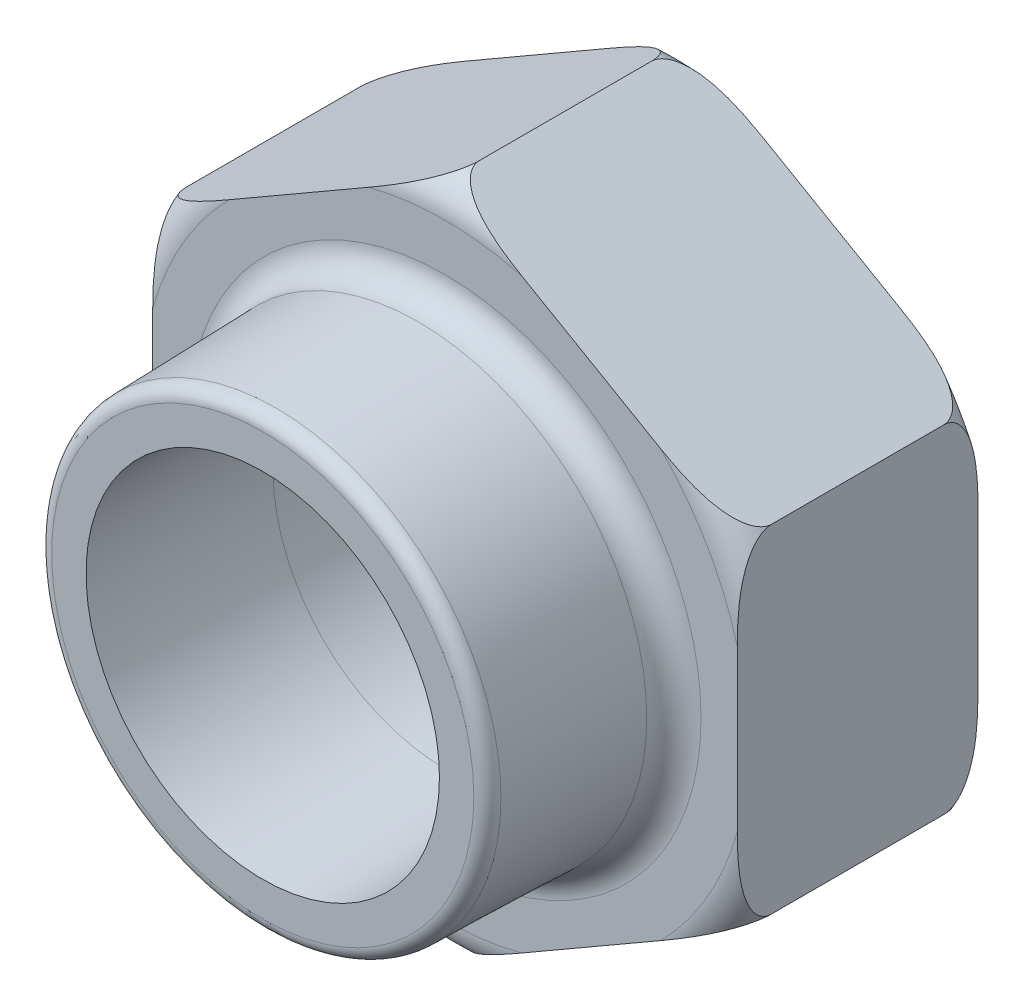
ISO-10303-21;
HEADER;
FILE_DESCRIPTION(('STEP AP214'),'2;1');
FILE_NAME('part.step','',(''),(''),'','','');
FILE_SCHEMA(('AUTOMOTIVE_DESIGN { 1 0 10303 214 1 1 1 1 }'));
ENDSEC;
DATA;
#1=APPLICATION_CONTEXT('core data for automotive mechanical design processes');
#2=APPLICATION_PROTOCOL_DEFINITION('international standard','automotive_design',2000,#1);
#3=PRODUCT_CONTEXT('',#1,'mechanical');
#4=PRODUCT('Part','Part','',(#3));
#5=PRODUCT_RELATED_PRODUCT_CATEGORY('part','',(#4));
#6=PRODUCT_DEFINITION_FORMATION('','',#4);
#7=PRODUCT_DEFINITION_CONTEXT('part definition',#1,'design');
#8=PRODUCT_DEFINITION('design','',#6,#7);
#9=PRODUCT_DEFINITION_SHAPE('','',#8);
#10=(LENGTH_UNIT() NAMED_UNIT(*) SI_UNIT(.MILLI.,.METRE.));
#11=(NAMED_UNIT(*) PLANE_ANGLE_UNIT() SI_UNIT($,.RADIAN.));
#12=(NAMED_UNIT(*) SI_UNIT($,.STERADIAN.) SOLID_ANGLE_UNIT());
#13=UNCERTAINTY_MEASURE_WITH_UNIT(LENGTH_MEASURE(1.E-05),#10,'distance_accuracy_value','');
#14=(GEOMETRIC_REPRESENTATION_CONTEXT(3) GLOBAL_UNCERTAINTY_ASSIGNED_CONTEXT((#13)) GLOBAL_UNIT_ASSIGNED_CONTEXT((#10,
#11,#12)) REPRESENTATION_CONTEXT('',''));
#15=CARTESIAN_POINT('',(0.,0.,0.));
#16=DIRECTION('',(0.,0.,1.));
#17=DIRECTION('',(1.,0.,0.));
#18=AXIS2_PLACEMENT_3D('',#15,#16,#17);
#19=CARTESIAN_POINT('',(-8.50000000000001,14.7224318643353,7.));
#20=DIRECTION('',(0.,0.,1.));
#21=DIRECTION('',(1.,0.,0.));
#22=AXIS2_PLACEMENT_3D('',#19,#20,#21);
#23=PLANE('',#22);
#24=CARTESIAN_POINT('',(0.,0.,7.));
#25=DIRECTION('',(0.,0.,1.));
#26=DIRECTION('',(1.,0.,0.));
#27=AXIS2_PLACEMENT_3D('',#24,#25,#26);
#28=CIRCLE('',#27,7.44599216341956);
#29=CARTESIAN_POINT('',(7.44599216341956,0.,7.));
#30=VERTEX_POINT('',#29);
#31=EDGE_CURVE('E243',#30,#30,#28,.F.);
#32=ORIENTED_EDGE('',*,*,#31,.T.);
#33=EDGE_LOOP('',(#32));
#34=FACE_BOUND('',#33,.T.);
#35=CARTESIAN_POINT('',(0.,0.,7.));
#36=DIRECTION('',(0.,0.,1.));
#37=DIRECTION('',(1.,0.,0.));
#38=AXIS2_PLACEMENT_3D('',#35,#36,#37);
#39=CIRCLE('',#38,8.81495457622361);
#40=CARTESIAN_POINT('',(8.49999999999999,-2.33525676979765,7.));
#41=VERTEX_POINT('',#40);
#42=CARTESIAN_POINT('',(6.27239168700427,-6.19358754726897,7.));
#43=VERTEX_POINT('',#42);
#44=EDGE_CURVE('E239',#41,#43,#39,.F.);
#45=ORIENTED_EDGE('',*,*,#44,.F.);
#46=DIRECTION('',(0.,-1.,0.));
#47=VECTOR('',#46,1.);
#48=CARTESIAN_POINT('',(8.49999999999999,4.90747728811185,7.));
#49=LINE('',#48,#47);
#50=CARTESIAN_POINT('',(8.49999999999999,2.33525676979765,7.));
#51=VERTEX_POINT('',#50);
#52=EDGE_CURVE('E200',#51,#41,#49,.T.);
#53=ORIENTED_EDGE('',*,*,#52,.F.);
#54=CARTESIAN_POINT('',(6.27239168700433,6.19358754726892,7.));
#55=VERTEX_POINT('',#54);
#56=EDGE_CURVE('E237',#55,#51,#39,.F.);
#57=ORIENTED_EDGE('',*,*,#56,.F.);
#58=DIRECTION('',(-0.866025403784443,0.499999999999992,0.));
#59=VECTOR('',#58,1.);
#60=CARTESIAN_POINT('',(8.49999999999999,4.90747728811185,7.));
#61=LINE('',#60,#59);
#62=CARTESIAN_POINT('',(2.22760831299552,8.52884431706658,7.));
#63=VERTEX_POINT('',#62);
#64=EDGE_CURVE('E187',#55,#63,#61,.T.);
#65=ORIENTED_EDGE('',*,*,#64,.T.);
#66=CARTESIAN_POINT('',(-2.22760831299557,8.52884431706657,7.));
#67=VERTEX_POINT('',#66);
#68=EDGE_CURVE('E185',#67,#63,#39,.F.);
#69=ORIENTED_EDGE('',*,*,#68,.F.);
#70=DIRECTION('',(0.866025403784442,0.499999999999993,0.));
#71=VECTOR('',#70,1.);
#72=CARTESIAN_POINT('',(-8.50000000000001,4.90747728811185,7.));
#73=LINE('',#72,#71);
#74=CARTESIAN_POINT('',(-6.27239168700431,6.19358754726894,7.));
#75=VERTEX_POINT('',#74);
#76=EDGE_CURVE('E178',#75,#67,#73,.T.);
#77=ORIENTED_EDGE('',*,*,#76,.F.);
#78=CARTESIAN_POINT('',(0.,0.,7.));
#79=DIRECTION('',(0.,0.,-1.));
#80=DIRECTION('',(-1.,0.,0.));
#81=AXIS2_PLACEMENT_3D('',#78,#79,#80);
#82=CIRCLE('',#81,8.81495457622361);
#83=CARTESIAN_POINT('',(-8.50000000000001,2.33525676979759,7.));
#84=VERTEX_POINT('',#83);
#85=EDGE_CURVE('E161',#84,#75,#82,.T.);
#86=ORIENTED_EDGE('',*,*,#85,.F.);
#87=DIRECTION('',(0.,-1.,0.));
#88=VECTOR('',#87,1.);
#89=CARTESIAN_POINT('',(-8.50000000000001,4.90747728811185,7.));
#90=LINE('',#89,#88);
#91=CARTESIAN_POINT('',(-8.50000000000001,-2.3352567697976,7.));
#92=VERTEX_POINT('',#91);
#93=EDGE_CURVE('E186',#84,#92,#90,.T.);
#94=ORIENTED_EDGE('',*,*,#93,.T.);
#95=CARTESIAN_POINT('',(-6.27239168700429,-6.19358754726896,7.));
#96=VERTEX_POINT('',#95);
#97=EDGE_CURVE('E421',#96,#92,#39,.F.);
#98=ORIENTED_EDGE('',*,*,#97,.F.);
#99=DIRECTION('',(0.866025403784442,-0.499999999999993,0.));
#100=VECTOR('',#99,1.);
#101=CARTESIAN_POINT('',(-8.50000000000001,-4.90747728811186,7.));
#102=LINE('',#101,#100);
#103=CARTESIAN_POINT('',(-2.22760831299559,-8.52884431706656,7.));
#104=VERTEX_POINT('',#103);
#105=EDGE_CURVE('E189',#96,#104,#102,.T.);
#106=ORIENTED_EDGE('',*,*,#105,.T.);
#107=CARTESIAN_POINT('',(2.2276083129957,-8.52884431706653,7.));
#108=VERTEX_POINT('',#107);
#109=EDGE_CURVE('E423',#108,#104,#39,.F.);
#110=ORIENTED_EDGE('',*,*,#109,.F.);
#111=DIRECTION('',(-0.86602540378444,-0.499999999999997,0.));
#112=VECTOR('',#111,1.);
#113=CARTESIAN_POINT('',(8.49999999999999,-4.90747728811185,7.));
#114=LINE('',#113,#112);
#115=EDGE_CURVE('E197',#43,#108,#114,.T.);
#116=ORIENTED_EDGE('',*,*,#115,.F.);
#117=EDGE_LOOP('',(#45,#53,#57,#65,#69,#77,#86,#94,#98,#106,#110,#116));
#118=FACE_BOUND('',#117,.T.);
#119=ADVANCED_FACE('F37',(#34,#118),#23,.T.);
#120=CARTESIAN_POINT('',(8.49999999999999,4.90747728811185,7.));
#121=DIRECTION('',(-0.499999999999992,-0.866025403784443,0.));
#122=DIRECTION('',(0.866025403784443,-0.499999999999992,0.));
#123=AXIS2_PLACEMENT_3D('',#120,#121,#122);
#124=PLANE('',#123);
#125=DIRECTION('',(0.,0.,-1.));
#126=VECTOR('',#125,1.);
#127=CARTESIAN_POINT('',(0.,9.81495457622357,7.));
#128=LINE('',#127,#126);
#129=CARTESIAN_POINT('',(0.,9.81495457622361,6.));
#130=VERTEX_POINT('',#129);
#131=CARTESIAN_POINT('',(0.,9.81495457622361,1.));
#132=VERTEX_POINT('',#131);
#133=EDGE_CURVE('E230',#130,#132,#128,.T.);
#134=ORIENTED_EDGE('',*,*,#133,.F.);
#135=CARTESIAN_POINT('',(3.46409292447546E-08,9.81495455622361,5.9998));
#136=CARTESIAN_POINT('',(-7.25925487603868E-05,9.81499648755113,6.02983184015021));
#137=CARTESIAN_POINT('',(0.00231871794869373,9.81361586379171,6.05978661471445));
#138=CARTESIAN_POINT('',(0.0114860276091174,9.80832311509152,6.11853396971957));
#139=CARTESIAN_POINT('',(0.0182241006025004,9.80443288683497,6.14733433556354));
#140=CARTESIAN_POINT('',(0.0355325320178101,9.79443985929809,6.20322523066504));
#141=CARTESIAN_POINT('',(0.0460915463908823,9.78834360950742,6.2303205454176));
#142=CARTESIAN_POINT('',(0.0703643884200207,9.7743296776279,6.28259541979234));
#143=CARTESIAN_POINT('',(0.0840850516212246,9.76640804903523,6.30777066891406));
#144=CARTESIAN_POINT('',(0.124231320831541,9.74322958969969,6.37248998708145));
#145=CARTESIAN_POINT('',(0.152944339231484,9.72665212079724,6.41013878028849));
#146=CARTESIAN_POINT('',(0.215038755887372,9.69080189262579,6.47992109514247));
#147=CARTESIAN_POINT('',(0.248435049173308,9.67152053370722,6.51203626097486));
#148=CARTESIAN_POINT('',(0.313912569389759,9.63371706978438,6.56768230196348));
#149=CARTESIAN_POINT('',(0.34563646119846,9.61540127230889,6.59178440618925));
#150=CARTESIAN_POINT('',(0.410771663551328,9.57779544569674,6.63676194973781));
#151=CARTESIAN_POINT('',(0.444184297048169,9.558504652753,6.6576348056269));
#152=CARTESIAN_POINT('',(0.512207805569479,9.519231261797,6.69656271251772));
#153=CARTESIAN_POINT('',(0.546818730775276,9.49924863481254,6.71461764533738));
#154=CARTESIAN_POINT('',(0.616906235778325,9.4587835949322,6.74826693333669));
#155=CARTESIAN_POINT('',(0.652382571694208,9.4383013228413,6.76386197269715));
#156=CARTESIAN_POINT('',(0.735973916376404,9.39003983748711,6.7977707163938));
#157=CARTESIAN_POINT('',(0.784343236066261,9.36211379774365,6.81524619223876));
#158=CARTESIAN_POINT('',(0.8818761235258,9.30580315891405,6.8469711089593));
#159=CARTESIAN_POINT('',(0.931040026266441,9.27741836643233,6.86121914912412));
#160=CARTESIAN_POINT('',(1.07946834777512,9.19172323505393,6.89989144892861));
#161=CARTESIAN_POINT('',(1.17953834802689,9.13394779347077,6.92019414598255));
#162=CARTESIAN_POINT('',(1.38153431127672,9.01732536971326,6.95287436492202));
#163=CARTESIAN_POINT('',(1.48346887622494,8.95847342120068,6.96517509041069));
#164=CARTESIAN_POINT('',(1.63661063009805,8.87005698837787,6.97904917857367));
#165=CARTESIAN_POINT('',(1.68767455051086,8.84057522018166,6.98291032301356));
#166=CARTESIAN_POINT('',(1.78985752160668,8.78157985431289,6.98932525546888));
#167=CARTESIAN_POINT('',(1.84097656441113,8.75206626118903,6.99187921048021));
#168=CARTESIAN_POINT('',(2.00310550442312,8.65846107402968,6.99822818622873));
#169=CARTESIAN_POINT('',(2.11417453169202,8.59433534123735,6.99997626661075));
#170=CARTESIAN_POINT('',(2.33631719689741,8.46608121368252,7.00002321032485));
#171=CARTESIAN_POINT('',(2.44739083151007,8.40195282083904,6.99832140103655));
#172=CARTESIAN_POINT('',(2.66958170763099,8.27367085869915,6.99292995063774));
#173=CARTESIAN_POINT('',(2.78069891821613,8.20951730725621,6.98923880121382));
#174=CARTESIAN_POINT('',(3.00291406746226,8.08122133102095,6.98113505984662));
#175=CARTESIAN_POINT('',(3.11401200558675,8.01707890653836,6.97672245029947));
#176=CARTESIAN_POINT('',(3.33648057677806,7.88863661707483,6.96823704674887));
#177=CARTESIAN_POINT('',(3.44785123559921,7.82433673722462,6.96416507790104));
#178=CARTESIAN_POINT('',(3.6706227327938,7.69571955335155,6.95722102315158));
#179=CARTESIAN_POINT('',(3.7820235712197,7.63140224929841,6.95434893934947));
#180=CARTESIAN_POINT('',(4.00475706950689,7.50280700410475,6.95036455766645));
#181=CARTESIAN_POINT('',(4.11608970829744,7.43852907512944,6.94925078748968));
#182=CARTESIAN_POINT('',(4.33875588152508,7.30997270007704,6.94898923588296));
#183=CARTESIAN_POINT('',(4.45008941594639,7.24569425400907,6.94984143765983));
#184=CARTESIAN_POINT('',(4.67148228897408,7.11787301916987,6.95333067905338));
#185=CARTESIAN_POINT('',(4.78154188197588,7.05433008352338,6.95594754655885));
#186=CARTESIAN_POINT('',(5.00163428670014,6.92725967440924,6.96245120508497));
#187=CARTESIAN_POINT('',(5.11166709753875,6.86373220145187,6.96633803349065));
#188=CARTESIAN_POINT('',(5.33187874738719,6.73659294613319,6.97460865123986));
#189=CARTESIAN_POINT('',(5.44205756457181,6.67298117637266,6.97899315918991));
#190=CARTESIAN_POINT('',(5.66242629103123,6.54575123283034,6.98724285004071));
#191=CARTESIAN_POINT('',(5.77261619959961,6.48213305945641,6.99110805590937));
#192=CARTESIAN_POINT('',(5.99250526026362,6.35518005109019,6.99710140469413));
#193=CARTESIAN_POINT('',(6.10220422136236,6.29184532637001,6.99923781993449));
#194=CARTESIAN_POINT('',(6.32161217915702,6.16517008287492,7.00042929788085));
#195=CARTESIAN_POINT('',(6.43132117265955,6.10182956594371,6.99948476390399));
#196=CARTESIAN_POINT('',(6.65042750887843,5.97532846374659,6.99290556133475));
#197=CARTESIAN_POINT('',(6.75982503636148,5.91216777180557,6.9872802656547));
#198=CARTESIAN_POINT('',(6.97819972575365,5.78608908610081,6.96940231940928));
#199=CARTESIAN_POINT('',(7.08717710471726,5.72317096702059,6.95715374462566));
#200=CARTESIAN_POINT('',(7.23426394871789,5.63825033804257,6.93431126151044));
#201=CARTESIAN_POINT('',(7.2728450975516,5.61597550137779,6.92772565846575));
#202=CARTESIAN_POINT('',(7.34984088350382,5.57152196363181,6.91323277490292));
#203=CARTESIAN_POINT('',(7.38825543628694,5.54934331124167,6.90532489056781));
#204=CARTESIAN_POINT('',(7.46502226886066,5.5050219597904,6.88798566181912));
#205=CARTESIAN_POINT('',(7.50337333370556,5.48287996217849,6.87854708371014));
#206=CARTESIAN_POINT('',(7.57973103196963,5.43879482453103,6.85798265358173));
#207=CARTESIAN_POINT('',(7.61773770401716,5.41685166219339,6.84685699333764));
#208=CARTESIAN_POINT('',(7.70822687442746,5.36460771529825,6.8179226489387));
#209=CARTESIAN_POINT('',(7.76049723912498,5.3344294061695,6.7992100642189));
#210=CARTESIAN_POINT('',(7.86375760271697,5.27481200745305,6.75730680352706));
#211=CARTESIAN_POINT('',(7.9147462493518,5.24537369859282,6.73411160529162));
#212=CARTESIAN_POINT('',(8.01428051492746,5.18790756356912,6.68249666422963));
#213=CARTESIAN_POINT('',(8.06284138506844,5.15987093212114,6.65411673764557));
#214=CARTESIAN_POINT('',(8.15663742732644,5.10571776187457,6.59088101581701));
#215=CARTESIAN_POINT('',(8.20188118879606,5.07959626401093,6.55604283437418));
#216=CARTESIAN_POINT('',(8.27104564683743,5.03966414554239,6.49301125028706));
#217=CARTESIAN_POINT('',(8.29660135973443,5.02490954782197,6.46722321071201));
#218=CARTESIAN_POINT('',(8.34483424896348,4.99706227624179,6.41217112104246));
#219=CARTESIAN_POINT('',(8.3675088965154,4.98397106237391,6.38290406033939));
#220=CARTESIAN_POINT('',(8.40908470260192,4.95996725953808,6.32030873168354));
#221=CARTESIAN_POINT('',(8.42793248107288,4.94908548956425,6.28693224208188));
#222=CARTESIAN_POINT('',(8.45986098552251,4.93065155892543,6.21674205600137));
#223=CARTESIAN_POINT('',(8.4729665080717,4.92308508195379,6.17994398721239));
#224=CARTESIAN_POINT('',(8.48816744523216,4.91430881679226,6.11893919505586));
#225=CARTESIAN_POINT('',(8.49256651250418,4.91176901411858,6.09548673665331));
#226=CARTESIAN_POINT('',(8.49850714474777,4.90833918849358,6.04797037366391));
#227=CARTESIAN_POINT('',(8.50003212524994,4.90745874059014,6.023903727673));
#228=CARTESIAN_POINT('',(8.49999996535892,4.90747730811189,5.9998));
#229=B_SPLINE_CURVE_WITH_KNOTS('',3,(#135,#136,#137,#138,#139,#140,#141,#142,#143,#144,#145,
#146,#147,#148,#149,#150,#151,#152,#153,#154,#155,#156,#157,#158,#159,#160,#161,#162,#163,#164,
#165,#166,#167,#168,#169,#170,#171,#172,#173,#174,#175,#176,#177,#178,#179,#180,#181,#182,#183,
#184,#185,#186,#187,#188,#189,#190,#191,#192,#193,#194,#195,#196,#197,#198,#199,#200,#201,#202,
#203,#204,#205,#206,#207,#208,#209,#210,#211,#212,#213,#214,#215,#216,#217,#218,#219,#220,#221,
#222,#223,#224,#225,#226,#227,#228),.UNSPECIFIED.,.F.,.F.,(4,2,2,2,2,2,2,2,2,2,2,2,2,2,2,2,2,2,
2,2,2,2,2,2,2,2,2,2,2,2,2,2,2,2,2,2,2,2,2,2,2,2,2,2,2,2,4),(0.,0.0898435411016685,
0.178913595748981,0.267721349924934,0.356722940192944,0.506357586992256,0.65647941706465,
0.787838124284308,0.919301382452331,1.05077015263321,1.1822022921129,1.35764426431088,
1.53316223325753,1.88467373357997,2.2395108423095,2.416767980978,2.59400246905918,
2.97870900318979,3.36349055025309,3.7485642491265,4.13364734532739,4.51963775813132,
4.90562884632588,5.2912965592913,5.67696097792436,6.05828991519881,6.43963007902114,
6.82152804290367,7.20340911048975,7.58345187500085,7.96344489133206,8.34267882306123,
8.72167964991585,8.85676542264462,8.99191305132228,9.12771903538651,9.26350959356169,
9.45293824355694,9.64255900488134,9.8307805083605,10.0184960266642,10.1358371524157,
10.2532805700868,10.3722640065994,10.4907284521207,10.5624971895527,10.6346788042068),.UNSPECIFIED.);
#230=EDGE_CURVE('E425',#130,#63,#229,.T.);
#231=ORIENTED_EDGE('',*,*,#230,.T.);
#232=ORIENTED_EDGE('',*,*,#64,.F.);
#233=CARTESIAN_POINT('',(8.49999999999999,4.90747728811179,6.));
#234=VERTEX_POINT('',#233);
#235=EDGE_CURVE('E319',#55,#234,#229,.T.);
#236=ORIENTED_EDGE('',*,*,#235,.T.);
#237=DIRECTION('',(0.,0.,-1.));
#238=VECTOR('',#237,1.);
#239=CARTESIAN_POINT('',(8.49999999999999,4.90747728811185,7.));
#240=LINE('',#239,#238);
#241=CARTESIAN_POINT('',(8.49999999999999,4.90747728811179,1.));
#242=VERTEX_POINT('',#241);
#243=EDGE_CURVE('E203',#234,#242,#240,.T.);
#244=ORIENTED_EDGE('',*,*,#243,.T.);
#245=CARTESIAN_POINT('',(8.49999996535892,4.90747730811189,1.0002));
#246=CARTESIAN_POINT('',(8.50007259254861,4.90743537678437,0.970168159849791));
#247=CARTESIAN_POINT('',(8.49768128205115,4.90881600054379,0.940213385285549));
#248=CARTESIAN_POINT('',(8.48851397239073,4.91410874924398,0.881466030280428));
#249=CARTESIAN_POINT('',(8.48177589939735,4.91799897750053,0.852665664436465));
#250=CARTESIAN_POINT('',(8.46446746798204,4.92799200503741,0.796774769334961));
#251=CARTESIAN_POINT('',(8.45390845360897,4.93408825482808,0.769679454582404));
#252=CARTESIAN_POINT('',(8.42963561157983,4.9481021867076,0.717404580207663));
#253=CARTESIAN_POINT('',(8.41591494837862,4.95602381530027,0.692229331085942));
#254=CARTESIAN_POINT('',(8.3757686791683,4.97920227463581,0.627510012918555));
#255=CARTESIAN_POINT('',(8.34705566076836,4.99577974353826,0.58986121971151));
#256=CARTESIAN_POINT('',(8.28496124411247,5.03162997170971,0.520078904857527));
#257=CARTESIAN_POINT('',(8.25156495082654,5.05091133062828,0.487963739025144));
#258=CARTESIAN_POINT('',(8.18608743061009,5.08871479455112,0.432317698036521));
#259=CARTESIAN_POINT('',(8.15436353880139,5.10703059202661,0.408215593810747));
#260=CARTESIAN_POINT('',(8.08922833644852,5.14463641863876,0.363238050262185));
#261=CARTESIAN_POINT('',(8.05581570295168,5.1639272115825,0.342365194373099));
#262=CARTESIAN_POINT('',(7.98779219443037,5.2032006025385,0.30343728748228));
#263=CARTESIAN_POINT('',(7.95318126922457,5.22318322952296,0.285382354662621));
#264=CARTESIAN_POINT('',(7.88309376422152,5.2636482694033,0.251733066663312));
#265=CARTESIAN_POINT('',(7.84761742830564,5.2841305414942,0.236138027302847));
#266=CARTESIAN_POINT('',(7.76402608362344,5.33239202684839,0.202229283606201));
#267=CARTESIAN_POINT('',(7.71565676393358,5.36031806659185,0.18475380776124));
#268=CARTESIAN_POINT('',(7.61812387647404,5.41662870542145,0.153028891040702));
#269=CARTESIAN_POINT('',(7.5689599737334,5.44501349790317,0.13878085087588));
#270=CARTESIAN_POINT('',(7.42053165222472,5.53070862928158,0.10010855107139));
#271=CARTESIAN_POINT('',(7.32046165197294,5.58848407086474,0.0798058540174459));
#272=CARTESIAN_POINT('',(7.11846568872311,5.70510649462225,0.0471256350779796));
#273=CARTESIAN_POINT('',(7.0165311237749,5.76395844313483,0.0348249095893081));
#274=CARTESIAN_POINT('',(6.86338936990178,5.85237487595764,0.020950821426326));
#275=CARTESIAN_POINT('',(6.81232544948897,5.88185664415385,0.0170896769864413));
#276=CARTESIAN_POINT('',(6.71014247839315,5.94085201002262,0.0106747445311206));
#277=CARTESIAN_POINT('',(6.6590234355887,5.97036560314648,0.00812078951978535));
#278=CARTESIAN_POINT('',(6.49689449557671,6.06397079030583,0.00177181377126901));
#279=CARTESIAN_POINT('',(6.38582546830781,6.12809652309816,2.37333892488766E-05));
#280=CARTESIAN_POINT('',(6.16368280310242,6.25635065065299,-2.32103248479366E-05));
#281=CARTESIAN_POINT('',(6.05260916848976,6.32047904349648,0.00167859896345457));
#282=CARTESIAN_POINT('',(5.83041829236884,6.44876100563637,0.00707004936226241));
#283=CARTESIAN_POINT('',(5.71930108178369,6.5129145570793,0.0107611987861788));
#284=CARTESIAN_POINT('',(5.49708593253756,6.64121053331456,0.01886494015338));
#285=CARTESIAN_POINT('',(5.38598799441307,6.70535295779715,0.023277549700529));
#286=CARTESIAN_POINT('',(5.16351942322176,6.83379524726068,0.0317629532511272));
#287=CARTESIAN_POINT('',(5.0521487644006,6.8980951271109,0.0358349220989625));
#288=CARTESIAN_POINT('',(4.82937726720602,7.02671231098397,0.0427789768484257));
#289=CARTESIAN_POINT('',(4.71797642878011,7.09102961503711,0.0456510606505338));
#290=CARTESIAN_POINT('',(4.49524293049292,7.21962486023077,0.0496354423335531));
#291=CARTESIAN_POINT('',(4.38391029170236,7.28390278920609,0.0507492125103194));
#292=CARTESIAN_POINT('',(4.16124411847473,7.41245916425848,0.051010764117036));
#293=CARTESIAN_POINT('',(4.04991058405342,7.47673761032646,0.0501585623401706));
#294=CARTESIAN_POINT('',(3.82851771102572,7.60455884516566,0.0466693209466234));
#295=CARTESIAN_POINT('',(3.71845811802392,7.66810178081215,0.0440524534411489));
#296=CARTESIAN_POINT('',(3.49836571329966,7.79517218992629,0.0375487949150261));
#297=CARTESIAN_POINT('',(3.38833290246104,7.85869966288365,0.0336619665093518));
#298=CARTESIAN_POINT('',(3.16812125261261,7.98583891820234,0.0253913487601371));
#299=CARTESIAN_POINT('',(3.05794243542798,8.04945068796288,0.0210068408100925));
#300=CARTESIAN_POINT('',(2.83757370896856,8.1766806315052,0.0127571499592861));
#301=CARTESIAN_POINT('',(2.72738380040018,8.24029880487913,0.00889194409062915));
#302=CARTESIAN_POINT('',(2.50749473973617,8.36725181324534,0.00289859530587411));
#303=CARTESIAN_POINT('',(2.39779577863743,8.43058653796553,0.000762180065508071));
#304=CARTESIAN_POINT('',(2.17838782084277,8.55726178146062,-0.000429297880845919));
#305=CARTESIAN_POINT('',(2.06867882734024,8.62060229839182,0.000515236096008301));
#306=CARTESIAN_POINT('',(1.84957249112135,8.74710340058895,0.0070944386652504));
#307=CARTESIAN_POINT('',(1.7401749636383,8.81026409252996,0.0127197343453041));
#308=CARTESIAN_POINT('',(1.52180027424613,8.93634277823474,0.0305976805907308));
#309=CARTESIAN_POINT('',(1.41282289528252,8.99926089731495,0.0428462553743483));
#310=CARTESIAN_POINT('',(1.26573605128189,9.08418152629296,0.06568873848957));
#311=CARTESIAN_POINT('',(1.22715490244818,9.10645636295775,0.0722743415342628));
#312=CARTESIAN_POINT('',(1.15015911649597,9.15090990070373,0.0867672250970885));
#313=CARTESIAN_POINT('',(1.11174456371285,9.17308855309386,0.0946751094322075));
#314=CARTESIAN_POINT('',(1.03497773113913,9.21740990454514,0.112014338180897));
#315=CARTESIAN_POINT('',(0.996626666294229,9.23955190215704,0.121452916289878));
#316=CARTESIAN_POINT('',(0.920268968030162,9.2836370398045,0.142017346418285));
#317=CARTESIAN_POINT('',(0.88226229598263,9.30558020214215,0.153143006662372));
#318=CARTESIAN_POINT('',(0.791773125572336,9.35782414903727,0.182077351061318));
#319=CARTESIAN_POINT('',(0.73950276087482,9.38800245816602,0.200789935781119));
#320=CARTESIAN_POINT('',(0.636242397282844,9.44761985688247,0.242693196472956));
#321=CARTESIAN_POINT('',(0.585253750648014,9.4770581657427,0.2658883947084));
#322=CARTESIAN_POINT('',(0.485719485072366,9.5345243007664,0.317503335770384));
#323=CARTESIAN_POINT('',(0.43715861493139,9.56256093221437,0.345883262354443));
#324=CARTESIAN_POINT('',(0.343362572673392,9.61671410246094,0.409118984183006));
#325=CARTESIAN_POINT('',(0.29811881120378,9.64283560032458,0.443957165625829));
#326=CARTESIAN_POINT('',(0.228954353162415,9.68276771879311,0.50698874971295));
#327=CARTESIAN_POINT('',(0.203398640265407,9.69752231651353,0.532776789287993));
#328=CARTESIAN_POINT('',(0.155165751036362,9.72536958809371,0.587828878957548));
#329=CARTESIAN_POINT('',(0.132491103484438,9.7384608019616,0.617095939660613));
#330=CARTESIAN_POINT('',(0.0909152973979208,9.76246460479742,0.67969126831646));
#331=CARTESIAN_POINT('',(0.0720675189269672,9.77334637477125,0.713067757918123));
#332=CARTESIAN_POINT('',(0.0401390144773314,9.79178030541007,0.78325794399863));
#333=CARTESIAN_POINT('',(0.0270334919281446,9.79934678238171,0.820056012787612));
#334=CARTESIAN_POINT('',(0.0118325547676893,9.80812304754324,0.881060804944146));
#335=CARTESIAN_POINT('',(0.00743348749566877,9.81066285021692,0.904513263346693));
#336=CARTESIAN_POINT('',(0.00149285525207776,9.81409267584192,0.952029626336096));
#337=CARTESIAN_POINT('',(-3.21252500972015E-05,9.81497312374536,0.976096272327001));
#338=CARTESIAN_POINT('',(3.46409306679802E-08,9.81495455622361,1.0002));
#339=B_SPLINE_CURVE_WITH_KNOTS('',3,(#245,#246,#247,#248,#249,#250,#251,#252,#253,#254,#255,
#256,#257,#258,#259,#260,#261,#262,#263,#264,#265,#266,#267,#268,#269,#270,#271,#272,#273,#274,
#275,#276,#277,#278,#279,#280,#281,#282,#283,#284,#285,#286,#287,#288,#289,#290,#291,#292,#293,
#294,#295,#296,#297,#298,#299,#300,#301,#302,#303,#304,#305,#306,#307,#308,#309,#310,#311,#312,
#313,#314,#315,#316,#317,#318,#319,#320,#321,#322,#323,#324,#325,#326,#327,#328,#329,#330,#331,
#332,#333,#334,#335,#336,#337,#338),.UNSPECIFIED.,.F.,.F.,(4,2,2,2,2,2,2,2,2,2,2,2,2,2,2,2,2,2,
2,2,2,2,2,2,2,2,2,2,2,2,2,2,2,2,2,2,2,2,2,2,2,2,2,2,2,2,4),(0.,0.0898435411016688,
0.178913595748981,0.267721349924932,0.356722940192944,0.506357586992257,0.65647941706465,
0.78783812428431,0.919301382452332,1.05077015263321,1.1822022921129,1.35764426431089,
1.53316223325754,1.88467373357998,2.23951084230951,2.41676798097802,2.5940024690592,
2.97870900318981,3.36349055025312,3.74856424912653,4.13364734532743,4.51963775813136,
4.90562884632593,5.29129655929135,5.67696097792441,6.05828991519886,6.43963007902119,
6.82152804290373,7.20340911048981,7.58345187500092,7.96344489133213,8.34267882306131,
8.72167964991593,8.8567654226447,8.99191305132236,9.12771903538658,9.26350959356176,
9.45293824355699,9.64255900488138,9.83078050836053,10.0184960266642,10.1358371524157,
10.2532805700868,10.3722640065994,10.4907284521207,10.5624971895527,10.6346788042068),.UNSPECIFIED.);
#340=CARTESIAN_POINT('',(6.27239168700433,6.19358754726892,0.));
#341=VERTEX_POINT('',#340);
#342=EDGE_CURVE('E390',#242,#341,#339,.T.);
#343=ORIENTED_EDGE('',*,*,#342,.T.);
#344=DIRECTION('',(-0.866025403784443,0.499999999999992,0.));
#345=VECTOR('',#344,1.);
#346=CARTESIAN_POINT('',(8.49999999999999,4.90747728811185,0.));
#347=LINE('',#346,#345);
#348=CARTESIAN_POINT('',(2.22760831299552,8.52884431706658,0.));
#349=VERTEX_POINT('',#348);
#350=EDGE_CURVE('E204',#341,#349,#347,.T.);
#351=ORIENTED_EDGE('',*,*,#350,.T.);
#352=EDGE_CURVE('E208',#349,#132,#339,.T.);
#353=ORIENTED_EDGE('',*,*,#352,.T.);
#354=EDGE_LOOP('',(#134,#231,#232,#236,#244,#343,#351,#353));
#355=FACE_BOUND('',#354,.T.);
#356=ADVANCED_FACE('F261',(#355),#124,.F.);
#357=CARTESIAN_POINT('',(-8.50000000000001,4.90747728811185,7.));
#358=DIRECTION('',(-0.499999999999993,0.866025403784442,0.));
#359=DIRECTION('',(-0.866025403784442,-0.499999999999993,0.));
#360=AXIS2_PLACEMENT_3D('',#357,#358,#359);
#361=PLANE('',#360);
#362=CARTESIAN_POINT('',(-3.46409660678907E-08,9.81495455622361,5.9998));
#363=CARTESIAN_POINT('',(7.25925487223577E-05,9.81499648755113,6.02983184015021));
#364=CARTESIAN_POINT('',(-0.00231871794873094,9.81361586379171,6.05978661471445));
#365=CARTESIAN_POINT('',(-0.0114860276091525,9.80832311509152,6.11853396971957));
#366=CARTESIAN_POINT('',(-0.0182241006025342,9.80443288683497,6.14733433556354));
#367=CARTESIAN_POINT('',(-0.0355325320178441,9.79443985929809,6.20322523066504));
#368=CARTESIAN_POINT('',(-0.0460915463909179,9.78834360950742,6.23032054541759));
#369=CARTESIAN_POINT('',(-0.0703643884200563,9.7743296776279,6.28259541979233));
#370=CARTESIAN_POINT('',(-0.0840850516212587,9.76640804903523,6.30777066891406));
#371=CARTESIAN_POINT('',(-0.124231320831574,9.7432295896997,6.37248998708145));
#372=CARTESIAN_POINT('',(-0.152944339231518,9.72665212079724,6.41013878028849));
#373=CARTESIAN_POINT('',(-0.215038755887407,9.69080189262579,6.47992109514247));
#374=CARTESIAN_POINT('',(-0.248435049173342,9.67152053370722,6.51203626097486));
#375=CARTESIAN_POINT('',(-0.313912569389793,9.63371706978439,6.56768230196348));
#376=CARTESIAN_POINT('',(-0.345636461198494,9.61540127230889,6.59178440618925));
#377=CARTESIAN_POINT('',(-0.410771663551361,9.57779544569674,6.63676194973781));
#378=CARTESIAN_POINT('',(-0.444184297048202,9.558504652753,6.6576348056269));
#379=CARTESIAN_POINT('',(-0.512207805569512,9.519231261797,6.69656271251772));
#380=CARTESIAN_POINT('',(-0.546818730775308,9.49924863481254,6.71461764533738));
#381=CARTESIAN_POINT('',(-0.616906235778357,9.4587835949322,6.74826693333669));
#382=CARTESIAN_POINT('',(-0.652382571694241,9.4383013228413,6.76386197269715));
#383=CARTESIAN_POINT('',(-0.735973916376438,9.39003983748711,6.7977707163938));
#384=CARTESIAN_POINT('',(-0.784343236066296,9.36211379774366,6.81524619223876));
#385=CARTESIAN_POINT('',(-0.881876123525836,9.30580315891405,6.84697110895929));
#386=CARTESIAN_POINT('',(-0.931040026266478,9.27741836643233,6.86121914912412));
#387=CARTESIAN_POINT('',(-1.07946834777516,9.19172323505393,6.89989144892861));
#388=CARTESIAN_POINT('',(-1.17953834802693,9.13394779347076,6.92019414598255));
#389=CARTESIAN_POINT('',(-1.38153431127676,9.01732536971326,6.95287436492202));
#390=CARTESIAN_POINT('',(-1.48346887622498,8.95847342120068,6.96517509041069));
#391=CARTESIAN_POINT('',(-1.63661063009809,8.87005698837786,6.97904917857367));
#392=CARTESIAN_POINT('',(-1.6876745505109,8.84057522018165,6.98291032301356));
#393=CARTESIAN_POINT('',(-1.78985752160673,8.78157985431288,6.98932525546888));
#394=CARTESIAN_POINT('',(-1.84097656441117,8.75206626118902,6.99187921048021));
#395=CARTESIAN_POINT('',(-2.00310550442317,8.65846107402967,6.99822818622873));
#396=CARTESIAN_POINT('',(-2.11417453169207,8.59433534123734,6.99997626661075));
#397=CARTESIAN_POINT('',(-2.33631719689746,8.46608121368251,7.00002321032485));
#398=CARTESIAN_POINT('',(-2.44739083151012,8.40195282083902,6.99832140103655));
#399=CARTESIAN_POINT('',(-2.66958170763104,8.27367085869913,6.99292995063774));
#400=CARTESIAN_POINT('',(-2.78069891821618,8.2095173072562,6.98923880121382));
#401=CARTESIAN_POINT('',(-3.00291406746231,8.08122133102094,6.98113505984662));
#402=CARTESIAN_POINT('',(-3.11401200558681,8.01707890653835,6.97672245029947));
#403=CARTESIAN_POINT('',(-3.33648057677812,7.88863661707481,6.96823704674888));
#404=CARTESIAN_POINT('',(-3.44785123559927,7.8243367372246,6.96416507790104));
#405=CARTESIAN_POINT('',(-3.67062273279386,7.69571955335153,6.95722102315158));
#406=CARTESIAN_POINT('',(-3.78202357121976,7.63140224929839,6.95434893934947));
#407=CARTESIAN_POINT('',(-4.00475706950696,7.50280700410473,6.95036455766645));
#408=CARTESIAN_POINT('',(-4.11608970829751,7.43852907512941,6.94925078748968));
#409=CARTESIAN_POINT('',(-4.33875588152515,7.30997270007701,6.94898923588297));
#410=CARTESIAN_POINT('',(-4.45008941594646,7.24569425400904,6.94984143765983));
#411=CARTESIAN_POINT('',(-4.67148228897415,7.11787301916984,6.95333067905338));
#412=CARTESIAN_POINT('',(-4.78154188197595,7.05433008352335,6.95594754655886));
#413=CARTESIAN_POINT('',(-5.00163428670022,6.9272596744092,6.96245120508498));
#414=CARTESIAN_POINT('',(-5.11166709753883,6.86373220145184,6.96633803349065));
#415=CARTESIAN_POINT('',(-5.33187874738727,6.73659294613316,6.97460865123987));
#416=CARTESIAN_POINT('',(-5.44205756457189,6.67298117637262,6.97899315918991));
#417=CARTESIAN_POINT('',(-5.66242629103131,6.5457512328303,6.98724285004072));
#418=CARTESIAN_POINT('',(-5.77261619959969,6.48213305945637,6.99110805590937));
#419=CARTESIAN_POINT('',(-5.9925052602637,6.35518005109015,6.99710140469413));
#420=CARTESIAN_POINT('',(-6.10220422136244,6.29184532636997,6.99923781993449));
#421=CARTESIAN_POINT('',(-6.32161217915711,6.16517008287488,7.00042929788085));
#422=CARTESIAN_POINT('',(-6.43132117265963,6.10182956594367,6.99948476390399));
#423=CARTESIAN_POINT('',(-6.65042750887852,5.97532846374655,6.99290556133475));
#424=CARTESIAN_POINT('',(-6.75982503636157,5.91216777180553,6.98728026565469));
#425=CARTESIAN_POINT('',(-6.97819972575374,5.78608908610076,6.96940231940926));
#426=CARTESIAN_POINT('',(-7.08717710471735,5.72317096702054,6.95715374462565));
#427=CARTESIAN_POINT('',(-7.23426394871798,5.63825033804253,6.93431126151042));
#428=CARTESIAN_POINT('',(-7.27284509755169,5.61597550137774,6.92772565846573));
#429=CARTESIAN_POINT('',(-7.3498408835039,5.57152196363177,6.91323277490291));
#430=CARTESIAN_POINT('',(-7.38825543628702,5.54934331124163,6.90532489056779));
#431=CARTESIAN_POINT('',(-7.46502226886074,5.50502195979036,6.8879856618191));
#432=CARTESIAN_POINT('',(-7.50337333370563,5.48287996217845,6.87854708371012));
#433=CARTESIAN_POINT('',(-7.5797310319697,5.438794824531,6.85798265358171));
#434=CARTESIAN_POINT('',(-7.61773770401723,5.41685166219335,6.84685699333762));
#435=CARTESIAN_POINT('',(-7.70822687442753,5.36460771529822,6.81792264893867));
#436=CARTESIAN_POINT('',(-7.76049723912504,5.33442940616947,6.79921006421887));
#437=CARTESIAN_POINT('',(-7.86375760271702,5.27481200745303,6.75730680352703));
#438=CARTESIAN_POINT('',(-7.91474624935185,5.2453736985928,6.73411160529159));
#439=CARTESIAN_POINT('',(-8.01428051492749,5.18790756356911,6.68249666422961));
#440=CARTESIAN_POINT('',(-8.06284138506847,5.15987093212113,6.65411673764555));
#441=CARTESIAN_POINT('',(-8.15663742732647,5.10571776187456,6.59088101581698));
#442=CARTESIAN_POINT('',(-8.20188118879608,5.07959626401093,6.55604283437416));
#443=CARTESIAN_POINT('',(-8.27104564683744,5.03966414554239,6.49301125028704));
#444=CARTESIAN_POINT('',(-8.29660135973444,5.02490954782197,6.467223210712));
#445=CARTESIAN_POINT('',(-8.34483424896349,4.99706227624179,6.41217112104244));
#446=CARTESIAN_POINT('',(-8.36750889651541,4.98397106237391,6.38290406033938));
#447=CARTESIAN_POINT('',(-8.40908470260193,4.95996725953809,6.32030873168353));
#448=CARTESIAN_POINT('',(-8.42793248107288,4.94908548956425,6.28693224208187));
#449=CARTESIAN_POINT('',(-8.45986098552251,4.93065155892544,6.21674205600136));
#450=CARTESIAN_POINT('',(-8.4729665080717,4.92308508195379,6.17994398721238));
#451=CARTESIAN_POINT('',(-8.48816744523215,4.91430881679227,6.11893919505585));
#452=CARTESIAN_POINT('',(-8.49256651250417,4.91176901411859,6.0954867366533));
#453=CARTESIAN_POINT('',(-8.49850714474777,4.90833918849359,6.0479703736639));
#454=CARTESIAN_POINT('',(-8.50003212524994,4.90745874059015,6.023903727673));
#455=CARTESIAN_POINT('',(-8.49999996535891,4.9074773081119,5.9998));
#456=B_SPLINE_CURVE_WITH_KNOTS('',3,(#362,#363,#364,#365,#366,#367,#368,#369,#370,#371,#372,
#373,#374,#375,#376,#377,#378,#379,#380,#381,#382,#383,#384,#385,#386,#387,#388,#389,#390,#391,
#392,#393,#394,#395,#396,#397,#398,#399,#400,#401,#402,#403,#404,#405,#406,#407,#408,#409,#410,
#411,#412,#413,#414,#415,#416,#417,#418,#419,#420,#421,#422,#423,#424,#425,#426,#427,#428,#429,
#430,#431,#432,#433,#434,#435,#436,#437,#438,#439,#440,#441,#442,#443,#444,#445,#446,#447,#448,
#449,#450,#451,#452,#453,#454,#455),.UNSPECIFIED.,.F.,.F.,(4,2,2,2,2,2,2,2,2,2,2,2,2,2,2,2,2,2,
2,2,2,2,2,2,2,2,2,2,2,2,2,2,2,2,2,2,2,2,2,2,2,2,2,2,2,2,4),(0.,0.0898435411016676,
0.17891359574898,0.267721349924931,0.35672294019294,0.506357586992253,0.656479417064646,
0.787838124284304,0.919301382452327,1.05077015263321,1.1822022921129,1.35764426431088,
1.53316223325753,1.88467373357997,2.23951084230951,2.41676798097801,2.59400246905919,
2.97870900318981,3.36349055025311,3.74856424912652,4.13364734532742,4.51963775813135,
4.90562884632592,5.29129655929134,5.6769609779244,6.05828991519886,6.43963007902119,
6.82152804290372,7.2034091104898,7.58345187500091,7.96344489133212,8.3426788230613,
8.72167964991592,8.85676542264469,8.99191305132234,9.12771903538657,9.26350959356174,
9.45293824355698,9.64255900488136,9.83078050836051,10.0184960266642,10.1358371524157,
10.2532805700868,10.3722640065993,10.4907284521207,10.5624971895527,10.6346788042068),.UNSPECIFIED.);
#457=EDGE_CURVE('E181',#130,#67,#456,.T.);
#458=ORIENTED_EDGE('',*,*,#457,.F.);
#459=ORIENTED_EDGE('',*,*,#133,.T.);
#460=CARTESIAN_POINT('',(-8.49999996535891,4.9074773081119,1.0002));
#461=CARTESIAN_POINT('',(-8.5000725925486,4.90743537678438,0.970168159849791));
#462=CARTESIAN_POINT('',(-8.49768128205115,4.9088160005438,0.94021338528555));
#463=CARTESIAN_POINT('',(-8.48851397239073,4.91410874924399,0.881466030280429));
#464=CARTESIAN_POINT('',(-8.48177589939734,4.91799897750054,0.852665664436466));
#465=CARTESIAN_POINT('',(-8.46446746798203,4.92799200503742,0.796774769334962));
#466=CARTESIAN_POINT('',(-8.45390845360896,4.93408825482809,0.769679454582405));
#467=CARTESIAN_POINT('',(-8.42963561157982,4.94810218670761,0.717404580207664));
#468=CARTESIAN_POINT('',(-8.41591494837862,4.95602381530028,0.692229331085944));
#469=CARTESIAN_POINT('',(-8.3757686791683,4.97920227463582,0.627510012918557));
#470=CARTESIAN_POINT('',(-8.34705566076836,4.99577974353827,0.589861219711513));
#471=CARTESIAN_POINT('',(-8.28496124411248,5.03162997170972,0.520078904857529));
#472=CARTESIAN_POINT('',(-8.25156495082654,5.05091133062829,0.487963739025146));
#473=CARTESIAN_POINT('',(-8.18608743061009,5.08871479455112,0.432317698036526));
#474=CARTESIAN_POINT('',(-8.15436353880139,5.10703059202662,0.408215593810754));
#475=CARTESIAN_POINT('',(-8.08922833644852,5.14463641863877,0.363238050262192));
#476=CARTESIAN_POINT('',(-8.05581570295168,5.1639272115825,0.342365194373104));
#477=CARTESIAN_POINT('',(-7.98779219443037,5.2032006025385,0.303437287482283));
#478=CARTESIAN_POINT('',(-7.95318126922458,5.22318322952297,0.285382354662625));
#479=CARTESIAN_POINT('',(-7.88309376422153,5.26364826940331,0.251733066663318));
#480=CARTESIAN_POINT('',(-7.84761742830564,5.2841305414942,0.236138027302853));
#481=CARTESIAN_POINT('',(-7.76402608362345,5.33239202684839,0.202229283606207));
#482=CARTESIAN_POINT('',(-7.71565676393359,5.36031806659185,0.184753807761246));
#483=CARTESIAN_POINT('',(-7.61812387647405,5.41662870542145,0.153028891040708));
#484=CARTESIAN_POINT('',(-7.56895997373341,5.44501349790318,0.138780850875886));
#485=CARTESIAN_POINT('',(-7.42053165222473,5.53070862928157,0.100108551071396));
#486=CARTESIAN_POINT('',(-7.32046165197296,5.58848407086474,0.0798058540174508));
#487=CARTESIAN_POINT('',(-7.11846568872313,5.70510649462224,0.0471256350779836));
#488=CARTESIAN_POINT('',(-7.01653112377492,5.76395844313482,0.0348249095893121));
#489=CARTESIAN_POINT('',(-6.86338936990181,5.85237487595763,0.0209508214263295));
#490=CARTESIAN_POINT('',(-6.812325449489,5.88185664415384,0.0170896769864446));
#491=CARTESIAN_POINT('',(-6.71014247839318,5.94085201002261,0.0106747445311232));
#492=CARTESIAN_POINT('',(-6.65902343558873,5.97036560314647,0.0081207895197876));
#493=CARTESIAN_POINT('',(-6.49689449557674,6.06397079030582,0.00177181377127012));
#494=CARTESIAN_POINT('',(-6.38582546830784,6.12809652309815,2.37333892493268E-05));
#495=CARTESIAN_POINT('',(-6.16368280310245,6.25635065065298,-2.32103248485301E-05));
#496=CARTESIAN_POINT('',(-6.0526091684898,6.32047904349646,0.00167859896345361));
#497=CARTESIAN_POINT('',(-5.83041829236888,6.44876100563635,0.00707004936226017));
#498=CARTESIAN_POINT('',(-5.71930108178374,6.51291455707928,0.0107611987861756));
#499=CARTESIAN_POINT('',(-5.49708593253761,6.64121053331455,0.0188649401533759));
#500=CARTESIAN_POINT('',(-5.38598799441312,6.70535295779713,0.023277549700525));
#501=CARTESIAN_POINT('',(-5.16351942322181,6.83379524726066,0.0317629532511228));
#502=CARTESIAN_POINT('',(-5.05214876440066,6.89809512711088,0.0358349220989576));
#503=CARTESIAN_POINT('',(-4.82937726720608,7.02671231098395,0.0427789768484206));
#504=CARTESIAN_POINT('',(-4.71797642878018,7.09102961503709,0.0456510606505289));
#505=CARTESIAN_POINT('',(-4.49524293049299,7.21962486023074,0.0496354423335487));
#506=CARTESIAN_POINT('',(-4.38391029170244,7.28390278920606,0.0507492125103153));
#507=CARTESIAN_POINT('',(-4.16124411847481,7.41245916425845,0.0510107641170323));
#508=CARTESIAN_POINT('',(-4.0499105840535,7.47673761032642,0.050158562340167));
#509=CARTESIAN_POINT('',(-3.82851771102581,7.60455884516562,0.0466693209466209));
#510=CARTESIAN_POINT('',(-3.71845811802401,7.66810178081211,0.0440524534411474));
#511=CARTESIAN_POINT('',(-3.49836571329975,7.79517218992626,0.0375487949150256));
#512=CARTESIAN_POINT('',(-3.38833290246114,7.85869966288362,0.0336619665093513));
#513=CARTESIAN_POINT('',(-3.1681212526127,7.9858389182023,0.0253913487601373));
#514=CARTESIAN_POINT('',(-3.05794243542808,8.04945068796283,0.0210068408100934));
#515=CARTESIAN_POINT('',(-2.83757370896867,8.17668063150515,0.0127571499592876));
#516=CARTESIAN_POINT('',(-2.72738380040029,8.24029880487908,0.00889194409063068));
#517=CARTESIAN_POINT('',(-2.50749473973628,8.3672518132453,0.00289859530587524));
#518=CARTESIAN_POINT('',(-2.39779577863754,8.43058653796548,0.000762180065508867));
#519=CARTESIAN_POINT('',(-2.17838782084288,8.55726178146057,-0.000429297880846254));
#520=CARTESIAN_POINT('',(-2.06867882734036,8.62060229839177,0.000515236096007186));
#521=CARTESIAN_POINT('',(-1.84957249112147,8.7471034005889,0.00709443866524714));
#522=CARTESIAN_POINT('',(-1.74017496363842,8.81026409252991,0.0127197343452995));
#523=CARTESIAN_POINT('',(-1.52180027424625,8.93634277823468,0.0305976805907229));
#524=CARTESIAN_POINT('',(-1.41282289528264,8.9992608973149,0.0428462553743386));
#525=CARTESIAN_POINT('',(-1.26573605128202,9.08418152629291,0.0656887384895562));
#526=CARTESIAN_POINT('',(-1.2271549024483,9.1064563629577,0.0722743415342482));
#527=CARTESIAN_POINT('',(-1.15015911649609,9.15090990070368,0.086767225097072));
#528=CARTESIAN_POINT('',(-1.11174456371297,9.17308855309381,0.09467510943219));
#529=CARTESIAN_POINT('',(-1.03497773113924,9.21740990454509,0.112014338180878));
#530=CARTESIAN_POINT('',(-0.996626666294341,9.239551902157,0.12145291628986));
#531=CARTESIAN_POINT('',(-0.920268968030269,9.28363703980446,0.142017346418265));
#532=CARTESIAN_POINT('',(-0.882262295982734,9.30558020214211,0.153143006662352));
#533=CARTESIAN_POINT('',(-0.791773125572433,9.35782414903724,0.182077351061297));
#534=CARTESIAN_POINT('',(-0.739502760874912,9.38800245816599,0.200789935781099));
#535=CARTESIAN_POINT('',(-0.636242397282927,9.44761985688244,0.242693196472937));
#536=CARTESIAN_POINT('',(-0.585253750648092,9.47705816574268,0.265888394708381));
#537=CARTESIAN_POINT('',(-0.485719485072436,9.53452430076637,0.317503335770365));
#538=CARTESIAN_POINT('',(-0.437158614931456,9.56256093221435,0.345883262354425));
#539=CARTESIAN_POINT('',(-0.343362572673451,9.61671410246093,0.409118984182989));
#540=CARTESIAN_POINT('',(-0.298118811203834,9.64283560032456,0.443957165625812));
#541=CARTESIAN_POINT('',(-0.228954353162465,9.6827677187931,0.506988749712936));
#542=CARTESIAN_POINT('',(-0.203398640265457,9.69752231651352,0.53277678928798));
#543=CARTESIAN_POINT('',(-0.155165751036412,9.72536958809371,0.587828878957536));
#544=CARTESIAN_POINT('',(-0.132491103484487,9.73846080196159,0.617095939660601));
#545=CARTESIAN_POINT('',(-0.0909152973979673,9.76246460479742,0.679691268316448));
#546=CARTESIAN_POINT('',(-0.0720675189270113,9.77334637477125,0.71306775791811));
#547=CARTESIAN_POINT('',(-0.0401390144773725,9.79178030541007,0.783257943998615));
#548=CARTESIAN_POINT('',(-0.0270334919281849,9.79934678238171,0.820056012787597));
#549=CARTESIAN_POINT('',(-0.0118325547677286,9.80812304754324,0.881060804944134));
#550=CARTESIAN_POINT('',(-0.00743348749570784,9.81066285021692,0.904513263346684));
#551=CARTESIAN_POINT('',(-0.00149285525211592,9.81409267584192,0.952029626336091));
#552=CARTESIAN_POINT('',(3.21252500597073E-05,9.81497312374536,0.976096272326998));
#553=CARTESIAN_POINT('',(-3.46409666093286E-08,9.81495455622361,1.0002));
#554=B_SPLINE_CURVE_WITH_KNOTS('',3,(#460,#461,#462,#463,#464,#465,#466,#467,#468,#469,#470,
#471,#472,#473,#474,#475,#476,#477,#478,#479,#480,#481,#482,#483,#484,#485,#486,#487,#488,#489,
#490,#491,#492,#493,#494,#495,#496,#497,#498,#499,#500,#501,#502,#503,#504,#505,#506,#507,#508,
#509,#510,#511,#512,#513,#514,#515,#516,#517,#518,#519,#520,#521,#522,#523,#524,#525,#526,#527,
#528,#529,#530,#531,#532,#533,#534,#535,#536,#537,#538,#539,#540,#541,#542,#543,#544,#545,#546,
#547,#548,#549,#550,#551,#552,#553),.UNSPECIFIED.,.F.,.F.,(4,2,2,2,2,2,2,2,2,2,2,2,2,2,2,2,2,2,
2,2,2,2,2,2,2,2,2,2,2,2,2,2,2,2,2,2,2,2,2,2,2,2,2,2,2,2,4),(0.,0.0898435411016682,
0.17891359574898,0.267721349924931,0.356722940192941,0.506357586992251,0.656479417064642,
0.7878381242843,0.919301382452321,1.0507701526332,1.18220229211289,1.35764426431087,
1.53316223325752,1.88467373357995,2.23951084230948,2.41676798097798,2.59400246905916,
2.97870900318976,3.36349055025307,3.74856424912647,4.13364734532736,4.51963775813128,
4.90562884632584,5.29129655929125,5.67696097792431,6.05828991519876,6.43963007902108,
6.82152804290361,7.20340911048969,7.58345187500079,7.96344489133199,8.34267882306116,
8.72167964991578,8.85676542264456,8.99191305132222,9.12771903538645,9.26350959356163,
9.45293824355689,9.64255900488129,9.83078050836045,10.0184960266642,10.1358371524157,
10.2532805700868,10.3722640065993,10.4907284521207,10.5624971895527,10.6346788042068),.UNSPECIFIED.);
#555=CARTESIAN_POINT('',(-2.22760831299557,8.52884431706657,0.));
#556=VERTEX_POINT('',#555);
#557=EDGE_CURVE('E364',#556,#132,#554,.T.);
#558=ORIENTED_EDGE('',*,*,#557,.F.);
#559=DIRECTION('',(0.866025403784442,0.499999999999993,0.));
#560=VECTOR('',#559,1.);
#561=CARTESIAN_POINT('',(-8.50000000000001,4.90747728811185,0.));
#562=LINE('',#561,#560);
#563=CARTESIAN_POINT('',(-6.27239168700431,6.19358754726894,0.));
#564=VERTEX_POINT('',#563);
#565=EDGE_CURVE('E207',#564,#556,#562,.T.);
#566=ORIENTED_EDGE('',*,*,#565,.F.);
#567=CARTESIAN_POINT('',(-8.50000000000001,4.90747728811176,1.));
#568=VERTEX_POINT('',#567);
#569=EDGE_CURVE('E360',#568,#564,#554,.T.);
#570=ORIENTED_EDGE('',*,*,#569,.F.);
#571=DIRECTION('',(0.,0.,-1.));
#572=VECTOR('',#571,1.);
#573=CARTESIAN_POINT('',(-8.50000000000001,4.90747728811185,7.));
#574=LINE('',#573,#572);
#575=CARTESIAN_POINT('',(-8.50000000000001,4.90747728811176,6.));
#576=VERTEX_POINT('',#575);
#577=EDGE_CURVE('E180',#576,#568,#574,.T.);
#578=ORIENTED_EDGE('',*,*,#577,.F.);
#579=EDGE_CURVE('E164',#75,#576,#456,.T.);
#580=ORIENTED_EDGE('',*,*,#579,.F.);
#581=ORIENTED_EDGE('',*,*,#76,.T.);
#582=EDGE_LOOP('',(#458,#459,#558,#566,#570,#578,#580,#581));
#583=FACE_BOUND('',#582,.T.);
#584=ADVANCED_FACE('F177',(#583),#361,.T.);
#585=CARTESIAN_POINT('',(-8.50000000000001,4.90747728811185,7.));
#586=DIRECTION('',(1.,0.,0.));
#587=DIRECTION('',(0.,1.,0.));
#588=AXIS2_PLACEMENT_3D('',#585,#586,#587);
#589=PLANE('',#588);
#590=ORIENTED_EDGE('',*,*,#93,.F.);
#591=CARTESIAN_POINT('',(-8.50000000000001,0.,6.94910674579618));
#592=CARTESIAN_POINT('',(-8.50000000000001,0.166195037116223,6.94910962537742));
#593=CARTESIAN_POINT('',(-8.50000000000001,0.332390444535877,6.95076858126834));
#594=CARTESIAN_POINT('',(-8.50000000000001,0.664746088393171,6.95689247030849));
#595=CARTESIAN_POINT('',(-8.50000000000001,0.830906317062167,6.96135778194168));
#596=CARTESIAN_POINT('',(-8.50000000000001,1.16422357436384,6.97166836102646));
#597=CARTESIAN_POINT('',(-8.50000000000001,1.33138030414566,6.97752212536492));
#598=CARTESIAN_POINT('',(-8.50000000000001,1.66567733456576,6.98837831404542));
#599=CARTESIAN_POINT('',(-8.50000000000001,1.83281762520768,6.99338099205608));
#600=CARTESIAN_POINT('',(-8.50000000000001,2.16913271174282,6.99978352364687));
#601=CARTESIAN_POINT('',(-8.50000000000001,2.33830849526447,7.00114066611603));
#602=CARTESIAN_POINT('',(-8.50000000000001,2.67687948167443,6.99662896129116));
#603=CARTESIAN_POINT('',(-8.50000000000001,2.84627466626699,6.99075017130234));
#604=CARTESIAN_POINT('',(-8.50000000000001,3.09889177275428,6.97313691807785));
#605=CARTESIAN_POINT('',(-8.50000000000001,3.1824170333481,6.96586077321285));
#606=CARTESIAN_POINT('',(-8.50000000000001,3.34906651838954,6.94769683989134));
#607=CARTESIAN_POINT('',(-8.50000000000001,3.43219083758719,6.93680995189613));
#608=CARTESIAN_POINT('',(-8.50000000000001,3.59753190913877,6.91060188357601));
#609=CARTESIAN_POINT('',(-8.50000000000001,3.67975044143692,6.895292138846));
#610=CARTESIAN_POINT('',(-8.50000000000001,3.84294586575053,6.85915303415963));
#611=CARTESIAN_POINT('',(-8.50000000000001,3.92392371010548,6.8383281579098));
#612=CARTESIAN_POINT('',(-8.50000000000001,4.03546392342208,6.804409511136));
#613=CARTESIAN_POINT('',(-8.50000000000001,4.06692388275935,6.79424756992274));
#614=CARTESIAN_POINT('',(-8.50000000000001,4.12943104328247,6.77271663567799));
#615=CARTESIAN_POINT('',(-8.50000000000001,4.16047819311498,6.76134749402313));
#616=CARTESIAN_POINT('',(-8.50000000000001,4.2529970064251,6.72519047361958));
#617=CARTESIAN_POINT('',(-8.50000000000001,4.31371231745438,6.69839238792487));
#618=CARTESIAN_POINT('',(-8.50000000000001,4.43237751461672,6.63797750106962));
#619=CARTESIAN_POINT('',(-8.50000000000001,4.49029829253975,6.60430265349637));
#620=CARTESIAN_POINT('',(-8.50000000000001,4.60048683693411,6.52870369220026));
#621=CARTESIAN_POINT('',(-8.50000000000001,4.65277335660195,6.48680834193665));
#622=CARTESIAN_POINT('',(-8.50000000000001,4.72610625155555,6.41436053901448));
#623=CARTESIAN_POINT('',(-8.50000000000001,4.75056661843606,6.38728045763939));
#624=CARTESIAN_POINT('',(-8.50000000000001,4.79554181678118,6.32995980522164));
#625=CARTESIAN_POINT('',(-8.50000000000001,4.81605663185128,6.29971922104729));
#626=CARTESIAN_POINT('',(-8.50000000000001,4.85202450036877,6.23578062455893));
#627=CARTESIAN_POINT('',(-8.50000000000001,4.86740878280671,6.20204301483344));
#628=CARTESIAN_POINT('',(-8.50000000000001,4.89117382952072,6.13218709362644));
#629=CARTESIAN_POINT('',(-8.50000000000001,4.89956936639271,6.09607397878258));
#630=CARTESIAN_POINT('',(-8.50000000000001,4.90770398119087,6.02789239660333));
#631=CARTESIAN_POINT('',(-8.50000000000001,4.9084695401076,5.99594589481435));
#632=CARTESIAN_POINT('',(-8.50000000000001,4.90392304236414,5.93248699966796));
#633=CARTESIAN_POINT('',(-8.50000000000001,4.89861002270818,5.9009746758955));
#634=CARTESIAN_POINT('',(-8.50000000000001,4.8833145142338,5.84267677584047));
#635=CARTESIAN_POINT('',(-8.50000000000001,4.87388145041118,5.81574249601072));
#636=CARTESIAN_POINT('',(-8.50000000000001,4.85125533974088,5.76352629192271));
#637=CARTESIAN_POINT('',(-8.50000000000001,4.83806168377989,5.73824463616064));
#638=CARTESIAN_POINT('',(-8.50000000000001,4.8001359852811,5.67555628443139));
#639=CARTESIAN_POINT('',(-8.50000000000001,4.7731295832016,5.63952738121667));
#640=CARTESIAN_POINT('',(-8.50000000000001,4.7138177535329,5.57211817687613));
#641=CARTESIAN_POINT('',(-8.50000000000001,4.6814962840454,5.54075251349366));
#642=CARTESIAN_POINT('',(-8.50000000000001,4.59031224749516,5.46259931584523));
#643=CARTESIAN_POINT('',(-8.50000000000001,4.52821439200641,5.41961958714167));
#644=CARTESIAN_POINT('',(-8.50000000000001,4.39859070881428,5.34308481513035));
#645=CARTESIAN_POINT('',(-8.50000000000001,4.3310548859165,5.30954766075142));
#646=CARTESIAN_POINT('',(-8.50000000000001,4.19171530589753,5.24940680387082));
#647=CARTESIAN_POINT('',(-8.50000000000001,4.1198599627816,5.22292488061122));
#648=CARTESIAN_POINT('',(-8.50000000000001,3.97415588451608,5.17603274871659));
#649=CARTESIAN_POINT('',(-8.50000000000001,3.90030493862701,5.15562960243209));
#650=CARTESIAN_POINT('',(-8.50000000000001,3.75119660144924,5.11969223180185));
#651=CARTESIAN_POINT('',(-8.50000000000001,3.67593541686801,5.10417405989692));
#652=CARTESIAN_POINT('',(-8.50000000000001,3.52477667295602,5.07719788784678));
#653=CARTESIAN_POINT('',(-8.50000000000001,3.44887976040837,5.06573617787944));
#654=CARTESIAN_POINT('',(-8.50000000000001,3.28266103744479,5.04432201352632));
#655=CARTESIAN_POINT('',(-8.50000000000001,3.19225493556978,5.0350354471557));
#656=CARTESIAN_POINT('',(-8.50000000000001,3.01113239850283,5.02014413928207));
#657=CARTESIAN_POINT('',(-8.50000000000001,2.92041589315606,5.0145402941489));
#658=CARTESIAN_POINT('',(-8.50000000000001,2.64790981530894,5.00203203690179));
#659=CARTESIAN_POINT('',(-8.50000000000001,2.46593162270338,4.99944930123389));
#660=CARTESIAN_POINT('',(-8.50000000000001,2.10141262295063,5.00073365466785));
#661=CARTESIAN_POINT('',(-8.50000000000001,1.91887217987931,5.00462426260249));
#662=CARTESIAN_POINT('',(-8.50000000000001,1.55384566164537,5.01490837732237));
#663=CARTESIAN_POINT('',(-8.50000000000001,1.37135959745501,5.02130222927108));
#664=CARTESIAN_POINT('',(-8.50000000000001,1.00588103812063,5.03338550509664));
#665=CARTESIAN_POINT('',(-8.50000000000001,0.822888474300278,5.03907303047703));
#666=CARTESIAN_POINT('',(-8.50000000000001,0.456819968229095,5.04742335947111));
#667=CARTESIAN_POINT('',(-8.50000000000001,0.273744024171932,5.05008609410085));
#668=CARTESIAN_POINT('',(-8.50000000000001,-0.0920787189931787,5.0513785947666));
#669=CARTESIAN_POINT('',(-8.50000000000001,-0.274825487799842,5.05001595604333));
#670=CARTESIAN_POINT('',(-8.50000000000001,-0.640260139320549,5.04377990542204));
#671=CARTESIAN_POINT('',(-8.50000000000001,-0.822948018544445,5.03890631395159));
#672=CARTESIAN_POINT('',(-8.50000000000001,-1.09618680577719,5.03042641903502));
#673=CARTESIAN_POINT('',(-8.50000000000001,-1.18675908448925,5.0274197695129));
#674=CARTESIAN_POINT('',(-8.50000000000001,-1.36790100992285,5.02136222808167));
#675=CARTESIAN_POINT('',(-8.50000000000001,-1.45847065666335,5.01831133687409));
#676=CARTESIAN_POINT('',(-8.50000000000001,-1.73033416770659,5.00964516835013));
#677=CARTESIAN_POINT('',(-8.50000000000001,-1.91164430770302,5.00452180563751));
#678=CARTESIAN_POINT('',(-8.50000000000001,-2.27430850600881,4.99921083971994));
#679=CARTESIAN_POINT('',(-8.50000000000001,-2.45566250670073,4.99902098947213));
#680=CARTESIAN_POINT('',(-8.50000000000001,-2.72746224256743,5.00587396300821));
#681=CARTESIAN_POINT('',(-8.50000000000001,-2.8179893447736,5.00934524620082));
#682=CARTESIAN_POINT('',(-8.50000000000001,-2.99886741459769,5.0193752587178));
#683=CARTESIAN_POINT('',(-8.50000000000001,-3.08921840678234,5.02593352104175));
#684=CARTESIAN_POINT('',(-8.50000000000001,-3.27051341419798,5.04304953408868));
#685=CARTESIAN_POINT('',(-8.50000000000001,-3.36145366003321,5.05364865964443));
#686=CARTESIAN_POINT('',(-8.50000000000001,-3.5426923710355,5.07990128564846));
#687=CARTESIAN_POINT('',(-8.50000000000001,-3.63299034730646,5.09555828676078));
#688=CARTESIAN_POINT('',(-8.50000000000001,-3.81235460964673,5.13329621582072));
#689=CARTESIAN_POINT('',(-8.50000000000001,-3.90141960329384,5.15538341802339));
#690=CARTESIAN_POINT('',(-8.50000000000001,-4.07707398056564,5.20777435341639));
#691=CARTESIAN_POINT('',(-8.50000000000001,-4.16366703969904,5.23806510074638));
#692=CARTESIAN_POINT('',(-8.50000000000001,-4.29075528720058,5.29185499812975));
#693=CARTESIAN_POINT('',(-8.50000000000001,-4.33294517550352,5.31134896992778));
#694=CARTESIAN_POINT('',(-8.50000000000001,-4.4156638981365,5.35356575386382));
#695=CARTESIAN_POINT('',(-8.50000000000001,-4.4561939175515,5.37628620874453));
#696=CARTESIAN_POINT('',(-8.50000000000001,-4.53462427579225,5.42528947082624));
#697=CARTESIAN_POINT('',(-8.50000000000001,-4.57254282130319,5.4515427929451));
#698=CARTESIAN_POINT('',(-8.50000000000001,-4.64502280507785,5.50828415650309));
#699=CARTESIAN_POINT('',(-8.50000000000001,-4.67959108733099,5.53876324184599));
#700=CARTESIAN_POINT('',(-8.50000000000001,-4.73543788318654,5.59588045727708));
#701=CARTESIAN_POINT('',(-8.50000000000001,-4.75782363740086,5.62142825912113));
#702=CARTESIAN_POINT('',(-8.50000000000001,-4.79909938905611,5.67527551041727));
#703=CARTESIAN_POINT('',(-8.50000000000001,-4.81798738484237,5.70357652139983));
#704=CARTESIAN_POINT('',(-8.50000000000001,-4.85132048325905,5.76311087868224));
#705=CARTESIAN_POINT('',(-8.50000000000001,-4.86571896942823,5.79437086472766));
#706=CARTESIAN_POINT('',(-8.50000000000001,-4.88856015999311,5.85899814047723));
#707=CARTESIAN_POINT('',(-8.50000000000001,-4.89701184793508,5.89236216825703));
#708=CARTESIAN_POINT('',(-8.50000000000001,-4.90671623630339,5.95791545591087));
#709=CARTESIAN_POINT('',(-8.50000000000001,-4.90840199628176,5.99003967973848));
#710=CARTESIAN_POINT('',(-8.50000000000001,-4.90558206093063,6.05401412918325));
#711=CARTESIAN_POINT('',(-8.50000000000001,-4.90107618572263,6.08586434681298));
#712=CARTESIAN_POINT('',(-8.50000000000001,-4.88719820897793,6.14465721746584));
#713=CARTESIAN_POINT('',(-8.50000000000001,-4.87843298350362,6.171747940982));
#714=CARTESIAN_POINT('',(-8.50000000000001,-4.85705055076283,6.22434445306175));
#715=CARTESIAN_POINT('',(-8.50000000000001,-4.84443229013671,6.24984980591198));
#716=CARTESIAN_POINT('',(-8.50000000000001,-4.80839506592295,6.31223651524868));
#717=CARTESIAN_POINT('',(-8.50000000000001,-4.78281553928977,6.34786776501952));
#718=CARTESIAN_POINT('',(-8.50000000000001,-4.72638791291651,6.41468006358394));
#719=CARTESIAN_POINT('',(-8.50000000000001,-4.6955254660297,6.44584855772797));
#720=CARTESIAN_POINT('',(-8.50000000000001,-4.60885017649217,6.52309961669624));
#721=CARTESIAN_POINT('',(-8.50000000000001,-4.54990244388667,6.56563441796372));
#722=CARTESIAN_POINT('',(-8.50000000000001,-4.426540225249,6.64171166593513));
#723=CARTESIAN_POINT('',(-8.50000000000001,-4.36211262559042,6.67523169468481));
#724=CARTESIAN_POINT('',(-8.50000000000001,-4.22985231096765,6.73521116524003));
#725=CARTESIAN_POINT('',(-8.50000000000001,-4.1620090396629,6.76164689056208));
#726=CARTESIAN_POINT('',(-8.50000000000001,-4.02432095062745,6.80875896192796));
#727=CARTESIAN_POINT('',(-8.50000000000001,-3.95447411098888,6.82942924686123));
#728=CARTESIAN_POINT('',(-8.50000000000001,-3.81347634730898,6.86609178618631));
#729=CARTESIAN_POINT('',(-8.50000000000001,-3.74232367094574,6.8820771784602));
#730=CARTESIAN_POINT('',(-8.50000000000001,-3.59924692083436,6.91016767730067));
#731=CARTESIAN_POINT('',(-8.50000000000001,-3.52732258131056,6.92227139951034));
#732=CARTESIAN_POINT('',(-8.50000000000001,-3.31316738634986,6.95344809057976));
#733=CARTESIAN_POINT('',(-8.50000000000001,-3.17027219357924,6.96792640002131));
#734=CARTESIAN_POINT('',(-8.50000000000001,-2.88385621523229,6.98834518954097));
#735=CARTESIAN_POINT('',(-8.50000000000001,-2.74033502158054,6.99427885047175));
#736=CARTESIAN_POINT('',(-8.50000000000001,-2.45311406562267,7.00040772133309));
#737=CARTESIAN_POINT('',(-8.50000000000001,-2.30941424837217,7.00059973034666));
#738=CARTESIAN_POINT('',(-8.50000000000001,-2.02205132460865,6.99751695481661));
#739=CARTESIAN_POINT('',(-8.50000000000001,-1.87838822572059,6.99424169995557));
#740=CARTESIAN_POINT('',(-8.50000000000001,-1.59000747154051,6.98610375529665));
#741=CARTESIAN_POINT('',(-8.50000000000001,-1.44529019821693,6.98122905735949));
#742=CARTESIAN_POINT('',(-8.50000000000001,-1.15584448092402,6.97154366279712));
#743=CARTESIAN_POINT('',(-8.50000000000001,-1.01111603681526,6.96673297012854));
#744=CARTESIAN_POINT('',(-8.50000000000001,-0.722003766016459,6.95848391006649));
#745=CARTESIAN_POINT('',(-8.50000000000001,-0.577620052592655,6.95504190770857));
#746=CARTESIAN_POINT('',(-8.50000000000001,-0.288824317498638,6.95035215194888));
#747=CARTESIAN_POINT('',(-8.50000000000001,-0.144412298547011,6.94910424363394));
#748=CARTESIAN_POINT('',(-8.50000000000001,0.,6.94910674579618));
#749=B_SPLINE_CURVE_WITH_KNOTS('',3,(#591,#592,#593,#594,#595,#596,#597,#598,#599,#600,#601,
#602,#603,#604,#605,#606,#607,#608,#609,#610,#611,#612,#613,#614,#615,#616,#617,#618,#619,#620,
#621,#622,#623,#624,#625,#626,#627,#628,#629,#630,#631,#632,#633,#634,#635,#636,#637,#638,#639,
#640,#641,#642,#643,#644,#645,#646,#647,#648,#649,#650,#651,#652,#653,#654,#655,#656,#657,#658,
#659,#660,#661,#662,#663,#664,#665,#666,#667,#668,#669,#670,#671,#672,#673,#674,#675,#676,#677,
#678,#679,#680,#681,#682,#683,#684,#685,#686,#687,#688,#689,#690,#691,#692,#693,#694,#695,#696,
#697,#698,#699,#700,#701,#702,#703,#704,#705,#706,#707,#708,#709,#710,#711,#712,#713,#714,#715,
#716,#717,#718,#719,#720,#721,#722,#723,#724,#725,#726,#727,#728,#729,#730,#731,#732,#733,#734,
#735,#736,#737,#738,#739,#740,#741,#742,#743,#744,#745,#746,#747,#748),.UNSPECIFIED.,.T.,.F.,(4,
2,2,2,2,2,2,2,2,2,2,2,2,2,2,2,2,2,2,2,2,2,2,2,2,2,2,2,2,2,2,2,2,2,2,2,2,2,2,2,2,2,2,2,2,2,2,2,2,
2,2,2,2,2,2,2,2,2,2,2,2,2,2,2,2,2,2,2,2,2,2,2,2,2,2,2,2,2,4),(0.,0.498579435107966,
0.997226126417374,1.49900690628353,2.00063786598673,2.50812081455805,3.016301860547,
3.26776681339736,3.51916910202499,3.76992710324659,4.0204818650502,4.11964162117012,
4.21881359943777,4.41757456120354,4.61808828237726,4.8179125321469,4.92711585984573,
5.03631964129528,5.14693333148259,5.25731261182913,5.35260253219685,5.44790755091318,
5.53319640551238,5.61849908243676,5.75280518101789,5.88752434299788,6.11281040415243,
6.33852044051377,6.56790543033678,6.79755589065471,7.02795330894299,7.2581394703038,
7.53068540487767,7.80329765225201,8.34902787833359,8.89674517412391,9.44453801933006,
9.99377276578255,10.5430200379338,11.091231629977,11.6394712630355,11.911338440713,
12.1832013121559,12.7273422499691,13.2712353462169,13.5429759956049,13.8146755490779,
14.0892352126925,14.36398531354,14.6390044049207,14.9135906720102,15.0529094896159,
15.1921270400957,15.3302474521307,15.4680794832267,15.5697489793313,15.6714764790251,
15.7742275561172,15.8768230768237,15.972735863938,16.0686514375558,16.1537374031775,
16.2388466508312,16.3696811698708,16.5008768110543,16.7177234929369,16.9351045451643,
17.1532044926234,17.3715328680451,17.5901794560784,17.8089039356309,18.239345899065,
18.6701311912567,19.1011566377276,19.5322405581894,19.9666379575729,20.4010620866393,
20.8343246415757,21.2675566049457),.UNSPECIFIED.);
#750=EDGE_CURVE('E166',#84,#576,#749,.T.);
#751=ORIENTED_EDGE('',*,*,#750,.T.);
#752=ORIENTED_EDGE('',*,*,#577,.T.);
#753=CARTESIAN_POINT('',(-8.49999999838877,0.,0.0508932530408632));
#754=CARTESIAN_POINT('',(-8.49999999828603,-0.166195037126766,0.0508903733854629));
#755=CARTESIAN_POINT('',(-8.49999999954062,-0.332390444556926,0.0492314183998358));
#756=CARTESIAN_POINT('',(-8.50000000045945,-0.664746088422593,0.0431075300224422));
#757=CARTESIAN_POINT('',(-8.50000000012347,-0.830906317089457,0.0386422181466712));
#758=CARTESIAN_POINT('',(-8.49999999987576,-1.16422357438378,0.0283316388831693));
#759=CARTESIAN_POINT('',(-8.49999999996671,-1.33138030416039,0.0224778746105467));
#760=CARTESIAN_POINT('',(-8.50000000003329,-1.66567733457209,0.0116216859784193));
#761=CARTESIAN_POINT('',(-8.50000000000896,-1.83281762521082,0.00661900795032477));
#762=CARTESIAN_POINT('',(-8.49999999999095,-2.16913271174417,0.000216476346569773));
#763=CARTESIAN_POINT('',(-8.49999999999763,-2.33830849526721,-0.00114066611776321));
#764=CARTESIAN_POINT('',(-8.50000000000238,-2.67687948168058,0.00337103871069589));
#765=CARTESIAN_POINT('',(-8.50000000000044,-2.84627466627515,0.00924982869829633));
#766=CARTESIAN_POINT('',(-8.49999999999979,-3.09889177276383,0.0268630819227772));
#767=CARTESIAN_POINT('',(-8.49999999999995,-3.18241703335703,0.0341392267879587));
#768=CARTESIAN_POINT('',(-8.50000000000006,-3.34906651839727,0.0523031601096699));
#769=CARTESIAN_POINT('',(-8.50000000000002,-3.43219083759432,0.0631900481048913));
#770=CARTESIAN_POINT('',(-8.49999999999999,-3.5975319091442,0.0893981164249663));
#771=CARTESIAN_POINT('',(-8.5,-3.67975044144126,0.104707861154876));
#772=CARTESIAN_POINT('',(-8.50000000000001,-3.84294586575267,0.140846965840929));
#773=CARTESIAN_POINT('',(-8.50000000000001,-3.92392371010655,0.16167184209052));
#774=CARTESIAN_POINT('',(-8.50000000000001,-4.0354639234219,0.195590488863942));
#775=CARTESIAN_POINT('',(-8.50000000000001,-4.06692388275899,0.205752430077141));
#776=CARTESIAN_POINT('',(-8.50000000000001,-4.12943104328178,0.227283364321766));
#777=CARTESIAN_POINT('',(-8.50000000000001,-4.16047819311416,0.238652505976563));
#778=CARTESIAN_POINT('',(-8.50000000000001,-4.25299700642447,0.274809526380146));
#779=CARTESIAN_POINT('',(-8.50000000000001,-4.31371231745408,0.301607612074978));
#780=CARTESIAN_POINT('',(-8.50000000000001,-4.43237751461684,0.362022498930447));
#781=CARTESIAN_POINT('',(-8.50000000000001,-4.49029829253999,0.395697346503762));
#782=CARTESIAN_POINT('',(-8.50000000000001,-4.60048683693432,0.471296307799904));
#783=CARTESIAN_POINT('',(-8.50000000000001,-4.65277335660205,0.513191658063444));
#784=CARTESIAN_POINT('',(-8.50000000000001,-4.72610625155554,0.585639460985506));
#785=CARTESIAN_POINT('',(-8.50000000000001,-4.75056661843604,0.612719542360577));
#786=CARTESIAN_POINT('',(-8.50000000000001,-4.79554181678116,0.670040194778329));
#787=CARTESIAN_POINT('',(-8.50000000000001,-4.81605663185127,0.700280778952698));
#788=CARTESIAN_POINT('',(-8.50000000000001,-4.85202450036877,0.764219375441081));
#789=CARTESIAN_POINT('',(-8.50000000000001,-4.86740878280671,0.797956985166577));
#790=CARTESIAN_POINT('',(-8.50000000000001,-4.89117382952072,0.867812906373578));
#791=CARTESIAN_POINT('',(-8.50000000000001,-4.89956936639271,0.903926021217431));
#792=CARTESIAN_POINT('',(-8.50000000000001,-4.90770398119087,0.972107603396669));
#793=CARTESIAN_POINT('',(-8.50000000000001,-4.9084695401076,1.00405410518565));
#794=CARTESIAN_POINT('',(-8.50000000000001,-4.90392304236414,1.06751300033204));
#795=CARTESIAN_POINT('',(-8.50000000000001,-4.89861002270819,1.0990253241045));
#796=CARTESIAN_POINT('',(-8.50000000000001,-4.8833145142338,1.15732322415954));
#797=CARTESIAN_POINT('',(-8.50000000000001,-4.87388145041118,1.18425750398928));
#798=CARTESIAN_POINT('',(-8.50000000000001,-4.85125533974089,1.23647370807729));
#799=CARTESIAN_POINT('',(-8.50000000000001,-4.83806168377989,1.26175536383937));
#800=CARTESIAN_POINT('',(-8.50000000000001,-4.8001359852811,1.32444371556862));
#801=CARTESIAN_POINT('',(-8.50000000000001,-4.7731295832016,1.36047261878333));
#802=CARTESIAN_POINT('',(-8.50000000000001,-4.7138177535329,1.42788182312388));
#803=CARTESIAN_POINT('',(-8.50000000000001,-4.6814962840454,1.45924748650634));
#804=CARTESIAN_POINT('',(-8.50000000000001,-4.59031224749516,1.53740068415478));
#805=CARTESIAN_POINT('',(-8.50000000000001,-4.52821439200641,1.58038041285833));
#806=CARTESIAN_POINT('',(-8.50000000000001,-4.39859070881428,1.65691518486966));
#807=CARTESIAN_POINT('',(-8.50000000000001,-4.33105488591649,1.69045233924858));
#808=CARTESIAN_POINT('',(-8.50000000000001,-4.19171530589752,1.75059319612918));
#809=CARTESIAN_POINT('',(-8.50000000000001,-4.11985996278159,1.77707511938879));
#810=CARTESIAN_POINT('',(-8.50000000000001,-3.97415588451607,1.82396725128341));
#811=CARTESIAN_POINT('',(-8.50000000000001,-3.900304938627,1.84437039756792));
#812=CARTESIAN_POINT('',(-8.50000000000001,-3.75119660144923,1.88030776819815));
#813=CARTESIAN_POINT('',(-8.50000000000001,-3.67593541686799,1.89582594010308));
#814=CARTESIAN_POINT('',(-8.50000000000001,-3.524776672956,1.92280211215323));
#815=CARTESIAN_POINT('',(-8.50000000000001,-3.44887976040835,1.93426382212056));
#816=CARTESIAN_POINT('',(-8.50000000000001,-3.28266103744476,1.95567798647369));
#817=CARTESIAN_POINT('',(-8.50000000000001,-3.19225493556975,1.96496455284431));
#818=CARTESIAN_POINT('',(-8.50000000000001,-3.0111323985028,1.97985586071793));
#819=CARTESIAN_POINT('',(-8.50000000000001,-2.92041589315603,1.9854597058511));
#820=CARTESIAN_POINT('',(-8.50000000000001,-2.6479098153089,1.99796796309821));
#821=CARTESIAN_POINT('',(-8.50000000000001,-2.46593162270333,2.00055069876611));
#822=CARTESIAN_POINT('',(-8.50000000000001,-2.10141262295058,1.99926634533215));
#823=CARTESIAN_POINT('',(-8.50000000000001,-1.91887217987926,1.99537573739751));
#824=CARTESIAN_POINT('',(-8.50000000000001,-1.55384566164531,1.98509162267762));
#825=CARTESIAN_POINT('',(-8.50000000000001,-1.37135959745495,1.97869777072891));
#826=CARTESIAN_POINT('',(-8.50000000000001,-1.00588103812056,1.96661449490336));
#827=CARTESIAN_POINT('',(-8.50000000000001,-0.822888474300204,1.96092696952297));
#828=CARTESIAN_POINT('',(-8.50000000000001,-0.456819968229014,1.95257664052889));
#829=CARTESIAN_POINT('',(-8.50000000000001,-0.273744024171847,1.94991390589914));
#830=CARTESIAN_POINT('',(-8.50000000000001,0.0920787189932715,1.9486214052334));
#831=CARTESIAN_POINT('',(-8.50000000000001,0.274825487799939,1.94998404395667));
#832=CARTESIAN_POINT('',(-8.50000000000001,0.640260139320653,1.95622009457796));
#833=CARTESIAN_POINT('',(-8.50000000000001,0.822948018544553,1.96109368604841));
#834=CARTESIAN_POINT('',(-8.50000000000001,1.0961868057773,1.96957358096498));
#835=CARTESIAN_POINT('',(-8.50000000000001,1.18675908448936,1.9725802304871));
#836=CARTESIAN_POINT('',(-8.50000000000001,1.36790100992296,1.97863777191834));
#837=CARTESIAN_POINT('',(-8.50000000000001,1.45847065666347,1.98168866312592));
#838=CARTESIAN_POINT('',(-8.50000000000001,1.73033416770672,1.99035483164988));
#839=CARTESIAN_POINT('',(-8.50000000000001,1.91164430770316,1.99547819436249));
#840=CARTESIAN_POINT('',(-8.50000000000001,2.27430850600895,2.00078916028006));
#841=CARTESIAN_POINT('',(-8.50000000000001,2.45566250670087,2.00097901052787));
#842=CARTESIAN_POINT('',(-8.50000000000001,2.72746224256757,1.99412603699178));
#843=CARTESIAN_POINT('',(-8.50000000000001,2.81798934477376,1.99065475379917));
#844=CARTESIAN_POINT('',(-8.50000000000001,2.99886741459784,1.98062474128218));
#845=CARTESIAN_POINT('',(-8.50000000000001,3.08921840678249,1.97406647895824));
#846=CARTESIAN_POINT('',(-8.50000000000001,3.27051341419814,1.9569504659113));
#847=CARTESIAN_POINT('',(-8.50000000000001,3.36145366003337,1.94635134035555));
#848=CARTESIAN_POINT('',(-8.50000000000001,3.54269237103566,1.92009871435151));
#849=CARTESIAN_POINT('',(-8.50000000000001,3.63299034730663,1.90444171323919));
#850=CARTESIAN_POINT('',(-8.50000000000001,3.8123546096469,1.86670378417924));
#851=CARTESIAN_POINT('',(-8.50000000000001,3.90141960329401,1.84461658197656));
#852=CARTESIAN_POINT('',(-8.50000000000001,4.07707398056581,1.79222564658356));
#853=CARTESIAN_POINT('',(-8.50000000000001,4.16366703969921,1.76193489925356));
#854=CARTESIAN_POINT('',(-8.50000000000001,4.29075528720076,1.70814500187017));
#855=CARTESIAN_POINT('',(-8.50000000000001,4.33294517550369,1.68865103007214));
#856=CARTESIAN_POINT('',(-8.50000000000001,4.41566389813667,1.64643424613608));
#857=CARTESIAN_POINT('',(-8.50000000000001,4.45619391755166,1.62371379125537));
#858=CARTESIAN_POINT('',(-8.50000000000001,4.53462427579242,1.57471052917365));
#859=CARTESIAN_POINT('',(-8.50000000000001,4.57254282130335,1.54845720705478));
#860=CARTESIAN_POINT('',(-8.50000000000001,4.64502280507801,1.49171584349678));
#861=CARTESIAN_POINT('',(-8.50000000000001,4.67959108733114,1.46123675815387));
#862=CARTESIAN_POINT('',(-8.50000000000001,4.73543788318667,1.40411954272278));
#863=CARTESIAN_POINT('',(-8.50000000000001,4.75782363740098,1.37857174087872));
#864=CARTESIAN_POINT('',(-8.50000000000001,4.79909938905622,1.32472448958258));
#865=CARTESIAN_POINT('',(-8.50000000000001,4.81798738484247,1.29642347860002));
#866=CARTESIAN_POINT('',(-8.50000000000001,4.85132048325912,1.23688912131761));
#867=CARTESIAN_POINT('',(-8.50000000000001,4.86571896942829,1.20562913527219));
#868=CARTESIAN_POINT('',(-8.50000000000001,4.88856015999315,1.14100185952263));
#869=CARTESIAN_POINT('',(-8.50000000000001,4.8970118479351,1.10763783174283));
#870=CARTESIAN_POINT('',(-8.50000000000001,4.9067162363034,1.04208454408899));
#871=CARTESIAN_POINT('',(-8.50000000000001,4.90840199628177,1.00996032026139));
#872=CARTESIAN_POINT('',(-8.50000000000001,4.90558206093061,0.945985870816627));
#873=CARTESIAN_POINT('',(-8.50000000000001,4.9010761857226,0.914135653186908));
#874=CARTESIAN_POINT('',(-8.50000000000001,4.8871982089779,0.855342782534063));
#875=CARTESIAN_POINT('',(-8.50000000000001,4.87843298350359,0.828252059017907));
#876=CARTESIAN_POINT('',(-8.50000000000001,4.85705055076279,0.775655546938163));
#877=CARTESIAN_POINT('',(-8.50000000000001,4.84443229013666,0.75015019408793));
#878=CARTESIAN_POINT('',(-8.50000000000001,4.80839506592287,0.687763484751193));
#879=CARTESIAN_POINT('',(-8.50000000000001,4.78281553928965,0.652132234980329));
#880=CARTESIAN_POINT('',(-8.50000000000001,4.72638791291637,0.585319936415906));
#881=CARTESIAN_POINT('',(-8.50000000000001,4.69552546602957,0.554151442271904));
#882=CARTESIAN_POINT('',(-8.50000000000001,4.60885017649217,0.476900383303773));
#883=CARTESIAN_POINT('',(-8.50000000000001,4.5499024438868,0.434365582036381));
#884=CARTESIAN_POINT('',(-8.50000000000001,4.42654022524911,0.358288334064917));
#885=CARTESIAN_POINT('',(-8.50000000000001,4.36211262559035,0.324768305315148));
#886=CARTESIAN_POINT('',(-8.50000000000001,4.22985231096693,0.264788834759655));
#887=CARTESIAN_POINT('',(-8.50000000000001,4.16200903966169,0.238353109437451));
#888=CARTESIAN_POINT('',(-8.50000000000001,4.02432095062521,0.191241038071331));
#889=CARTESIAN_POINT('',(-8.50000000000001,3.95447411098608,0.17057075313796));
#890=CARTESIAN_POINT('',(-8.50000000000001,3.81347634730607,0.13390821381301));
#891=CARTESIAN_POINT('',(-8.50000000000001,3.74232367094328,0.117922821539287));
#892=CARTESIAN_POINT('',(-8.5,3.59924692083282,0.0898323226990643));
#893=CARTESIAN_POINT('',(-8.49999999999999,3.52732258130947,0.0777286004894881));
#894=CARTESIAN_POINT('',(-8.50000000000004,3.31316738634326,0.0465519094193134));
#895=CARTESIAN_POINT('',(-8.50000000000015,3.17027219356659,0.0320735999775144));
#896=CARTESIAN_POINT('',(-8.49999999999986,2.88385621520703,0.0116548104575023));
#897=CARTESIAN_POINT('',(-8.49999999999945,2.74033502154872,0.00572114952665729));
#898=CARTESIAN_POINT('',(-8.50000000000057,2.45311406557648,-0.000407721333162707));
#899=CARTESIAN_POINT('',(-8.50000000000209,2.30941424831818,-0.000599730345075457));
#900=CARTESIAN_POINT('',(-8.49999999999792,2.022051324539,0.00248304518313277));
#901=CARTESIAN_POINT('',(-8.49999999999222,1.87838822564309,0.00575830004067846));
#902=CARTESIAN_POINT('',(-8.50000000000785,1.59000747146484,0.013896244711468));
#903=CARTESIAN_POINT('',(-8.5000000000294,1.44529019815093,0.0187709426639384));
#904=CARTESIAN_POINT('',(-8.49999999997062,1.15584448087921,0.0284563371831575));
#905=CARTESIAN_POINT('',(-8.49999999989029,1.01111603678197,0.0332670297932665));
#906=CARTESIAN_POINT('',(-8.50000000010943,0.722003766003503,0.0415160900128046));
#907=CARTESIAN_POINT('',(-8.5000000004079,0.577620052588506,0.0449580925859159));
#908=CARTESIAN_POINT('',(-8.49999999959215,0.288824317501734,0.0496478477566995));
#909=CARTESIAN_POINT('',(-8.49999999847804,0.144412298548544,0.0508957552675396));
#910=CARTESIAN_POINT('',(-8.49999999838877,0.,0.0508932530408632));
#911=B_SPLINE_CURVE_WITH_KNOTS('',3,(#753,#754,#755,#756,#757,#758,#759,#760,#761,#762,#763,
#764,#765,#766,#767,#768,#769,#770,#771,#772,#773,#774,#775,#776,#777,#778,#779,#780,#781,#782,
#783,#784,#785,#786,#787,#788,#789,#790,#791,#792,#793,#794,#795,#796,#797,#798,#799,#800,#801,
#802,#803,#804,#805,#806,#807,#808,#809,#810,#811,#812,#813,#814,#815,#816,#817,#818,#819,#820,
#821,#822,#823,#824,#825,#826,#827,#828,#829,#830,#831,#832,#833,#834,#835,#836,#837,#838,#839,
#840,#841,#842,#843,#844,#845,#846,#847,#848,#849,#850,#851,#852,#853,#854,#855,#856,#857,#858,
#859,#860,#861,#862,#863,#864,#865,#866,#867,#868,#869,#870,#871,#872,#873,#874,#875,#876,#877,
#878,#879,#880,#881,#882,#883,#884,#885,#886,#887,#888,#889,#890,#891,#892,#893,#894,#895,#896,
#897,#898,#899,#900,#901,#902,#903,#904,#905,#906,#907,#908,#909,#910),.UNSPECIFIED.,.T.,.F.,(4,
2,2,2,2,2,2,2,2,2,2,2,2,2,2,2,2,2,2,2,2,2,2,2,2,2,2,2,2,2,2,2,2,2,2,2,2,2,2,2,2,2,2,2,2,2,2,2,2,
2,2,2,2,2,2,2,2,2,2,2,2,2,2,2,2,2,2,2,2,2,2,2,2,2,2,2,2,2,4),(0.,0.498579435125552,
0.997226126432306,1.4990069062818,2.00063786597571,2.50812081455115,3.01630186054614,
3.2677668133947,3.51916910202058,3.76992710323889,4.02048186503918,4.11964162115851,
4.21881359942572,4.41757456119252,4.61808828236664,4.81791253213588,4.92711585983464,
5.03631964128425,5.14693333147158,5.25731261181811,5.35260253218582,5.44790755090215,
5.53319640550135,5.61849908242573,5.75280518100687,5.88752434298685,6.1128104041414,
6.33852044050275,6.56790543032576,6.7975558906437,7.02795330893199,7.2581394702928,
7.53068540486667,7.80329765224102,8.34902787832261,8.89674517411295,9.4445380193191,
9.9937727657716,10.5430200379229,11.091231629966,11.6394712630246,11.9113384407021,
12.183201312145,12.7273422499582,13.271235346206,13.542975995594,13.814675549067,
14.0892352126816,14.3639853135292,14.6390044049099,14.9135906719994,15.0529094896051,
15.1921270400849,15.3302474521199,15.4680794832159,15.5697489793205,15.6714764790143,
15.7742275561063,15.8768230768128,15.9727358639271,16.0686514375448,16.1537374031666,
16.2388466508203,16.36968116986,16.5008768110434,16.7177234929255,16.9351045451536,
17.1532044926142,17.3715328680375,17.5901794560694,17.8089039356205,18.2393458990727,
18.6701311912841,19.1011566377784,19.5322405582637,19.9666379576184,20.4010620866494,
20.8343246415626,21.267556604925),.UNSPECIFIED.);
#912=CARTESIAN_POINT('',(-8.50000000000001,2.33525676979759,0.));
#913=VERTEX_POINT('',#912);
#914=EDGE_CURVE('E353',#568,#913,#911,.T.);
#915=ORIENTED_EDGE('',*,*,#914,.T.);
#916=DIRECTION('',(0.,-1.,0.));
#917=VECTOR('',#916,1.);
#918=CARTESIAN_POINT('',(-8.50000000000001,4.90747728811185,0.));
#919=LINE('',#918,#917);
#920=CARTESIAN_POINT('',(-8.50000000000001,-2.3352567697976,0.));
#921=VERTEX_POINT('',#920);
#922=EDGE_CURVE('E211',#913,#921,#919,.T.);
#923=ORIENTED_EDGE('',*,*,#922,.T.);
#924=CARTESIAN_POINT('',(-8.49999999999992,-4.9074772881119,1.));
#925=VERTEX_POINT('',#924);
#926=EDGE_CURVE('E348',#921,#925,#911,.T.);
#927=ORIENTED_EDGE('',*,*,#926,.T.);
#928=DIRECTION('',(0.,0.,-1.));
#929=VECTOR('',#928,1.);
#930=CARTESIAN_POINT('',(-8.50000000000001,-4.90747728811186,7.));
#931=LINE('',#930,#929);
#932=CARTESIAN_POINT('',(-8.49999999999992,-4.9074772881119,6.));
#933=VERTEX_POINT('',#932);
#934=EDGE_CURVE('E227',#933,#925,#931,.T.);
#935=ORIENTED_EDGE('',*,*,#934,.F.);
#936=EDGE_CURVE('E329',#933,#92,#749,.T.);
#937=ORIENTED_EDGE('',*,*,#936,.T.);
#938=EDGE_LOOP('',(#590,#751,#752,#915,#923,#927,#935,#937));
#939=FACE_BOUND('',#938,.T.);
#940=ADVANCED_FACE('F339',(#939),#589,.F.);
#941=CARTESIAN_POINT('',(-8.50000000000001,-4.90747728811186,7.));
#942=DIRECTION('',(0.499999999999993,0.866025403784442,0.));
#943=DIRECTION('',(-0.866025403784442,0.499999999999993,0.));
#944=AXIS2_PLACEMENT_3D('',#941,#942,#943);
#945=PLANE('',#944);
#946=DIRECTION('',(0.,0.,-1.));
#947=VECTOR('',#946,1.);
#948=CARTESIAN_POINT('',(0.,-9.81495457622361,7.));
#949=LINE('',#948,#947);
#950=CARTESIAN_POINT('',(0.,-9.81495457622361,6.));
#951=VERTEX_POINT('',#950);
#952=CARTESIAN_POINT('',(0.,-9.81495457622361,1.));
#953=VERTEX_POINT('',#952);
#954=EDGE_CURVE('E225',#951,#953,#949,.T.);
#955=ORIENTED_EDGE('',*,*,#954,.F.);
#956=CARTESIAN_POINT('',(-3.46409772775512E-08,-9.81495455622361,5.9998));
#957=CARTESIAN_POINT('',(7.25925487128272E-05,-9.81499648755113,6.02983184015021));
#958=CARTESIAN_POINT('',(-0.00231871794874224,-9.81361586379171,6.05978661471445));
#959=CARTESIAN_POINT('',(-0.0114860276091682,-9.80832311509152,6.11853396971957));
#960=CARTESIAN_POINT('',(-0.0182241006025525,-9.80443288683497,6.14733433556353));
#961=CARTESIAN_POINT('',(-0.0355325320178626,-9.79443985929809,6.20322523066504));
#962=CARTESIAN_POINT('',(-0.0460915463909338,-9.78834360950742,6.23032054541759));
#963=CARTESIAN_POINT('',(-0.0703643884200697,-9.7743296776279,6.28259541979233));
#964=CARTESIAN_POINT('',(-0.0840850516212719,-9.76640804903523,6.30777066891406));
#965=CARTESIAN_POINT('',(-0.124231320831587,-9.7432295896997,6.37248998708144));
#966=CARTESIAN_POINT('',(-0.152944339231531,-9.72665212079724,6.41013878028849));
#967=CARTESIAN_POINT('',(-0.215038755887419,-9.69080189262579,6.47992109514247));
#968=CARTESIAN_POINT('',(-0.248435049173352,-9.67152053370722,6.51203626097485));
#969=CARTESIAN_POINT('',(-0.313912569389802,-9.63371706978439,6.56768230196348));
#970=CARTESIAN_POINT('',(-0.345636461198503,-9.61540127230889,6.59178440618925));
#971=CARTESIAN_POINT('',(-0.410771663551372,-9.57779544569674,6.63676194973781));
#972=CARTESIAN_POINT('',(-0.444184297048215,-9.558504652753,6.6576348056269));
#973=CARTESIAN_POINT('',(-0.512207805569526,-9.519231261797,6.69656271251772));
#974=CARTESIAN_POINT('',(-0.546818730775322,-9.49924863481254,6.71461764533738));
#975=CARTESIAN_POINT('',(-0.616906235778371,-9.4587835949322,6.74826693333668));
#976=CARTESIAN_POINT('',(-0.652382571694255,-9.4383013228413,6.76386197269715));
#977=CARTESIAN_POINT('',(-0.735973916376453,-9.39003983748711,6.7977707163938));
#978=CARTESIAN_POINT('',(-0.784343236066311,-9.36211379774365,6.81524619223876));
#979=CARTESIAN_POINT('',(-0.881876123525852,-9.30580315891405,6.8469711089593));
#980=CARTESIAN_POINT('',(-0.931040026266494,-9.27741836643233,6.86121914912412));
#981=CARTESIAN_POINT('',(-1.07946834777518,-9.19172323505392,6.89989144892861));
#982=CARTESIAN_POINT('',(-1.17953834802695,-9.13394779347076,6.92019414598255));
#983=CARTESIAN_POINT('',(-1.38153431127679,-9.01732536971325,6.95287436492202));
#984=CARTESIAN_POINT('',(-1.483468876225,-8.95847342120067,6.96517509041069));
#985=CARTESIAN_POINT('',(-1.63661063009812,-8.87005698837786,6.97904917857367));
#986=CARTESIAN_POINT('',(-1.68767455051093,-8.84057522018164,6.98291032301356));
#987=CARTESIAN_POINT('',(-1.78985752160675,-8.78157985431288,6.98932525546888));
#988=CARTESIAN_POINT('',(-1.8409765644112,-8.75206626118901,6.99187921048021));
#989=CARTESIAN_POINT('',(-2.0031055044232,-8.65846107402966,6.99822818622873));
#990=CARTESIAN_POINT('',(-2.1141745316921,-8.59433534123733,6.99997626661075));
#991=CARTESIAN_POINT('',(-2.33631719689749,-8.4660812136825,7.00002321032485));
#992=CARTESIAN_POINT('',(-2.44739083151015,-8.40195282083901,6.99832140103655));
#993=CARTESIAN_POINT('',(-2.66958170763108,-8.27367085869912,6.99292995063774));
#994=CARTESIAN_POINT('',(-2.78069891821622,-8.20951730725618,6.98923880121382));
#995=CARTESIAN_POINT('',(-3.00291406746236,-8.08122133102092,6.98113505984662));
#996=CARTESIAN_POINT('',(-3.11401200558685,-8.01707890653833,6.97672245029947));
#997=CARTESIAN_POINT('',(-3.33648057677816,-7.8886366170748,6.96823704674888));
#998=CARTESIAN_POINT('',(-3.44785123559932,-7.82433673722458,6.96416507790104));
#999=CARTESIAN_POINT('',(-3.67062273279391,-7.69571955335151,6.95722102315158));
#1000=CARTESIAN_POINT('',(-3.78202357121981,-7.63140224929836,6.95434893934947));
#1001=CARTESIAN_POINT('',(-4.00475706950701,-7.5028070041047,6.95036455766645));
#1002=CARTESIAN_POINT('',(-4.11608970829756,-7.43852907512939,6.94925078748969));
#1003=CARTESIAN_POINT('',(-4.3387558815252,-7.30997270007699,6.94898923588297));
#1004=CARTESIAN_POINT('',(-4.45008941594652,-7.24569425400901,6.94984143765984));
#1005=CARTESIAN_POINT('',(-4.67148228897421,-7.11787301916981,6.95333067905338));
#1006=CARTESIAN_POINT('',(-4.78154188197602,-7.05433008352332,6.95594754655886));
#1007=CARTESIAN_POINT('',(-5.00163428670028,-6.92725967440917,6.96245120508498));
#1008=CARTESIAN_POINT('',(-5.1116670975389,-6.86373220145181,6.96633803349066));
#1009=CARTESIAN_POINT('',(-5.33187874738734,-6.73659294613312,6.97460865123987));
#1010=CARTESIAN_POINT('',(-5.44205756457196,-6.67298117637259,6.97899315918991));
#1011=CARTESIAN_POINT('',(-5.66242629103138,-6.54575123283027,6.98724285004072));
#1012=CARTESIAN_POINT('',(-5.77261619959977,-6.48213305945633,6.99110805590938));
#1013=CARTESIAN_POINT('',(-5.99250526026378,-6.35518005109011,6.99710140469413));
#1014=CARTESIAN_POINT('',(-6.10220422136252,-6.29184532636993,6.99923781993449));
#1015=CARTESIAN_POINT('',(-6.32161217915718,-6.16517008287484,7.00042929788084));
#1016=CARTESIAN_POINT('',(-6.43132117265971,-6.10182956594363,6.99948476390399));
#1017=CARTESIAN_POINT('',(-6.6504275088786,-5.97532846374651,6.99290556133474));
#1018=CARTESIAN_POINT('',(-6.75982503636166,-5.91216777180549,6.98728026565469));
#1019=CARTESIAN_POINT('',(-6.97819972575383,-5.78608908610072,6.96940231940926));
#1020=CARTESIAN_POINT('',(-7.08717710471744,-5.7231709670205,6.95715374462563));
#1021=CARTESIAN_POINT('',(-7.23426394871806,-5.63825033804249,6.93431126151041));
#1022=CARTESIAN_POINT('',(-7.27284509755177,-5.6159755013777,6.92772565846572));
#1023=CARTESIAN_POINT('',(-7.34984088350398,-5.57152196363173,6.91323277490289));
#1024=CARTESIAN_POINT('',(-7.38825543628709,-5.5493433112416,6.90532489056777));
#1025=CARTESIAN_POINT('',(-7.46502226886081,-5.50502195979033,6.88798566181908));
#1026=CARTESIAN_POINT('',(-7.5033733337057,-5.48287996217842,6.8785470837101));
#1027=CARTESIAN_POINT('',(-7.57973103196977,-5.43879482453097,6.85798265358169));
#1028=CARTESIAN_POINT('',(-7.6177377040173,-5.41685166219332,6.8468569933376));
#1029=CARTESIAN_POINT('',(-7.70822687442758,-5.3646077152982,6.81792264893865));
#1030=CARTESIAN_POINT('',(-7.76049723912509,-5.33442940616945,6.79921006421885));
#1031=CARTESIAN_POINT('',(-7.86375760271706,-5.27481200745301,6.75730680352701));
#1032=CARTESIAN_POINT('',(-7.91474624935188,-5.24537369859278,6.73411160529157));
#1033=CARTESIAN_POINT('',(-8.01428051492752,-5.1879075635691,6.68249666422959));
#1034=CARTESIAN_POINT('',(-8.06284138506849,-5.15987093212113,6.65411673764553));
#1035=CARTESIAN_POINT('',(-8.15663742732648,-5.10571776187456,6.59088101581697));
#1036=CARTESIAN_POINT('',(-8.20188118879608,-5.07959626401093,6.55604283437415));
#1037=CARTESIAN_POINT('',(-8.27104564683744,-5.0396641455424,6.49301125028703));
#1038=CARTESIAN_POINT('',(-8.29660135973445,-5.02490954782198,6.46722321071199));
#1039=CARTESIAN_POINT('',(-8.34483424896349,-4.9970622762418,6.41217112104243));
#1040=CARTESIAN_POINT('',(-8.36750889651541,-4.98397106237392,6.38290406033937));
#1041=CARTESIAN_POINT('',(-8.40908470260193,-4.95996725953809,6.32030873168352));
#1042=CARTESIAN_POINT('',(-8.42793248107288,-4.94908548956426,6.28693224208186));
#1043=CARTESIAN_POINT('',(-8.45986098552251,-4.93065155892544,6.21674205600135));
#1044=CARTESIAN_POINT('',(-8.47296650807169,-4.9230850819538,6.17994398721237));
#1045=CARTESIAN_POINT('',(-8.48816744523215,-4.91430881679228,6.11893919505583));
#1046=CARTESIAN_POINT('',(-8.49256651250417,-4.9117690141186,6.09548673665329));
#1047=CARTESIAN_POINT('',(-8.49850714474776,-4.9083391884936,6.0479703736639));
#1048=CARTESIAN_POINT('',(-8.50003212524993,-4.90745874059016,6.023903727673));
#1049=CARTESIAN_POINT('',(-8.49999996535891,-4.9074773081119,5.9998));
#1050=B_SPLINE_CURVE_WITH_KNOTS('',3,(#956,#957,#958,#959,#960,#961,#962,#963,#964,#965,#966,
#967,#968,#969,#970,#971,#972,#973,#974,#975,#976,#977,#978,#979,#980,#981,#982,#983,#984,#985,
#986,#987,#988,#989,#990,#991,#992,#993,#994,#995,#996,#997,#998,#999,#1000,#1001,#1002,#1003,
#1004,#1005,#1006,#1007,#1008,#1009,#1010,#1011,#1012,#1013,#1014,#1015,#1016,#1017,#1018,#1019,
#1020,#1021,#1022,#1023,#1024,#1025,#1026,#1027,#1028,#1029,#1030,#1031,#1032,#1033,#1034,#1035,
#1036,#1037,#1038,#1039,#1040,#1041,#1042,#1043,#1044,#1045,#1046,#1047,#1048,#1049),
.UNSPECIFIED.,.F.,.F.,(4,2,2,2,2,2,2,2,2,2,2,2,2,2,2,2,2,2,2,2,2,2,2,2,2,2,2,2,2,2,2,2,2,2,2,2,
2,2,2,2,2,2,2,2,2,2,4),(0.,0.0898435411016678,0.17891359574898,0.26772134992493,
0.356722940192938,0.506357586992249,0.656479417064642,0.787838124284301,0.919301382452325,
1.05077015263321,1.1822022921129,1.35764426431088,1.53316223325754,1.88467373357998,
2.23951084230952,2.41676798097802,2.59400246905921,2.97870900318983,3.36349055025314,
3.74856424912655,4.13364734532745,4.51963775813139,4.90562884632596,5.29129655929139,
5.67696097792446,6.05828991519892,6.43963007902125,6.82152804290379,7.20340911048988,
7.58345187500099,7.9634448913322,8.34267882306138,8.72167964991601,8.85676542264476,
8.99191305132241,9.12771903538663,9.26350959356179,9.45293824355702,9.64255900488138,
9.83078050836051,10.0184960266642,10.1358371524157,10.2532805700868,10.3722640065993,
10.4907284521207,10.5624971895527,10.6346788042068),.UNSPECIFIED.);
#1051=EDGE_CURVE('E324',#951,#104,#1050,.T.);
#1052=ORIENTED_EDGE('',*,*,#1051,.T.);
#1053=ORIENTED_EDGE('',*,*,#105,.F.);
#1054=EDGE_CURVE('E334',#96,#933,#1050,.T.);
#1055=ORIENTED_EDGE('',*,*,#1054,.T.);
#1056=ORIENTED_EDGE('',*,*,#934,.T.);
#1057=CARTESIAN_POINT('',(-8.4999999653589,-4.9074773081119,1.0002));
#1058=CARTESIAN_POINT('',(-8.5000725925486,-4.90743537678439,0.970168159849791));
#1059=CARTESIAN_POINT('',(-8.49768128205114,-4.90881600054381,0.940213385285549));
#1060=CARTESIAN_POINT('',(-8.48851397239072,-4.914108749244,0.881466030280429));
#1061=CARTESIAN_POINT('',(-8.48177589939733,-4.91799897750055,0.852665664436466));
#1062=CARTESIAN_POINT('',(-8.46446746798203,-4.92799200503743,0.796774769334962));
#1063=CARTESIAN_POINT('',(-8.45390845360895,-4.9340882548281,0.769679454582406));
#1064=CARTESIAN_POINT('',(-8.42963561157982,-4.94810218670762,0.717404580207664));
#1065=CARTESIAN_POINT('',(-8.41591494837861,-4.95602381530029,0.692229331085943));
#1066=CARTESIAN_POINT('',(-8.3757686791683,-4.97920227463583,0.627510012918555));
#1067=CARTESIAN_POINT('',(-8.34705566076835,-4.99577974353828,0.589861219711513));
#1068=CARTESIAN_POINT('',(-8.28496124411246,-5.03162997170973,0.520078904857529));
#1069=CARTESIAN_POINT('',(-8.25156495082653,-5.0509113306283,0.487963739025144));
#1070=CARTESIAN_POINT('',(-8.18608743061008,-5.08871479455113,0.432317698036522));
#1071=CARTESIAN_POINT('',(-8.15436353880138,-5.10703059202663,0.40821559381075));
#1072=CARTESIAN_POINT('',(-8.08922833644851,-5.14463641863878,0.363238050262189));
#1073=CARTESIAN_POINT('',(-8.05581570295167,-5.16392721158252,0.342365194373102));
#1074=CARTESIAN_POINT('',(-7.98779219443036,-5.20320060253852,0.303437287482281));
#1075=CARTESIAN_POINT('',(-7.95318126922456,-5.22318322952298,0.285382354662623));
#1076=CARTESIAN_POINT('',(-7.88309376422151,-5.26364826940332,0.251733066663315));
#1077=CARTESIAN_POINT('',(-7.84761742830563,-5.28413054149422,0.236138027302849));
#1078=CARTESIAN_POINT('',(-7.76402608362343,-5.33239202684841,0.202229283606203));
#1079=CARTESIAN_POINT('',(-7.71565676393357,-5.36031806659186,0.184753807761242));
#1080=CARTESIAN_POINT('',(-7.61812387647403,-5.41662870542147,0.153028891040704));
#1081=CARTESIAN_POINT('',(-7.56895997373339,-5.44501349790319,0.138780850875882));
#1082=CARTESIAN_POINT('',(-7.42053165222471,-5.5307086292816,0.100108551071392));
#1083=CARTESIAN_POINT('',(-7.32046165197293,-5.58848407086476,0.0798058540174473));
#1084=CARTESIAN_POINT('',(-7.1184656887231,-5.70510649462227,0.0471256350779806));
#1085=CARTESIAN_POINT('',(-7.01653112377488,-5.76395844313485,0.0348249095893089));
#1086=CARTESIAN_POINT('',(-6.86338936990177,-5.85237487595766,0.0209508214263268));
#1087=CARTESIAN_POINT('',(-6.81232544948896,-5.88185664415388,0.0170896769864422));
#1088=CARTESIAN_POINT('',(-6.71014247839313,-5.94085201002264,0.0106747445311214));
#1089=CARTESIAN_POINT('',(-6.65902343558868,-5.97036560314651,0.00812078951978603));
#1090=CARTESIAN_POINT('',(-6.49689449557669,-6.06397079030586,0.00177181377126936));
#1091=CARTESIAN_POINT('',(-6.38582546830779,-6.12809652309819,2.37333892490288E-05));
#1092=CARTESIAN_POINT('',(-6.16368280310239,-6.25635065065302,-2.3210324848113E-05));
#1093=CARTESIAN_POINT('',(-6.05260916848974,-6.32047904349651,0.00167859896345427));
#1094=CARTESIAN_POINT('',(-5.83041829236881,-6.4487610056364,0.00707004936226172));
#1095=CARTESIAN_POINT('',(-5.71930108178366,-6.51291455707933,0.0107611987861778));
#1096=CARTESIAN_POINT('',(-5.49708593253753,-6.6412105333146,0.0188649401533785));
#1097=CARTESIAN_POINT('',(-5.38598799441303,-6.70535295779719,0.0232775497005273));
#1098=CARTESIAN_POINT('',(-5.16351942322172,-6.83379524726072,0.031762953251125));
#1099=CARTESIAN_POINT('',(-5.05214876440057,-6.89809512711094,0.0358349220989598));
#1100=CARTESIAN_POINT('',(-4.82937726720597,-7.02671231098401,0.042778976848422));
#1101=CARTESIAN_POINT('',(-4.71797642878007,-7.09102961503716,0.0456510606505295));
#1102=CARTESIAN_POINT('',(-4.49524293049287,-7.21962486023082,0.0496354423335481));
#1103=CARTESIAN_POINT('',(-4.38391029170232,-7.28390278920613,0.0507492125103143));
#1104=CARTESIAN_POINT('',(-4.16124411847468,-7.41245916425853,0.05101076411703));
#1105=CARTESIAN_POINT('',(-4.04991058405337,-7.47673761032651,0.0501585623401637));
#1106=CARTESIAN_POINT('',(-3.82851771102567,-7.60455884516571,0.046669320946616));
#1107=CARTESIAN_POINT('',(-3.71845811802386,-7.6681017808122,0.0440524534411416));
#1108=CARTESIAN_POINT('',(-3.4983657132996,-7.79517218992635,0.0375487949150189));
#1109=CARTESIAN_POINT('',(-3.38833290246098,-7.85869966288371,0.0336619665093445));
#1110=CARTESIAN_POINT('',(-3.16812125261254,-7.9858389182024,0.0253913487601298));
#1111=CARTESIAN_POINT('',(-3.05794243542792,-8.04945068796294,0.0210068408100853));
#1112=CARTESIAN_POINT('',(-2.83757370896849,-8.17668063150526,0.01275714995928));
#1113=CARTESIAN_POINT('',(-2.72738380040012,-8.24029880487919,0.00889194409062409));
#1114=CARTESIAN_POINT('',(-2.5074947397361,-8.36725181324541,0.00289859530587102));
#1115=CARTESIAN_POINT('',(-2.39779577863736,-8.43058653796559,0.000762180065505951));
#1116=CARTESIAN_POINT('',(-2.17838782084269,-8.55726178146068,-0.000429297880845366));
#1117=CARTESIAN_POINT('',(-2.06867882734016,-8.62060229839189,0.000515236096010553));
#1118=CARTESIAN_POINT('',(-1.84957249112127,-8.74710340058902,0.00709443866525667));
#1119=CARTESIAN_POINT('',(-1.74017496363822,-8.81026409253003,0.0127197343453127));
#1120=CARTESIAN_POINT('',(-1.52180027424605,-8.9363427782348,0.0305976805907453));
#1121=CARTESIAN_POINT('',(-1.41282289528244,-8.99926089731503,0.0428462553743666));
#1122=CARTESIAN_POINT('',(-1.26573605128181,-9.08418152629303,0.0656887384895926));
#1123=CARTESIAN_POINT('',(-1.2271549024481,-9.10645636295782,0.0722743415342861));
#1124=CARTESIAN_POINT('',(-1.1501591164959,-9.15090990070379,0.0867672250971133));
#1125=CARTESIAN_POINT('',(-1.11174456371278,-9.17308855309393,0.094675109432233));
#1126=CARTESIAN_POINT('',(-1.03497773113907,-9.2174099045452,0.112014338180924));
#1127=CARTESIAN_POINT('',(-0.996626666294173,-9.2395519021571,0.121452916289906));
#1128=CARTESIAN_POINT('',(-0.920268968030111,-9.28363703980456,0.142017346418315));
#1129=CARTESIAN_POINT('',(-0.882262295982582,-9.3055802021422,0.153143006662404));
#1130=CARTESIAN_POINT('',(-0.791773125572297,-9.35782414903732,0.182077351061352));
#1131=CARTESIAN_POINT('',(-0.739502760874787,-9.38800245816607,0.200789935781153));
#1132=CARTESIAN_POINT('',(-0.636242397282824,-9.44761985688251,0.242693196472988));
#1133=CARTESIAN_POINT('',(-0.585253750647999,-9.47705816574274,0.26588839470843));
#1134=CARTESIAN_POINT('',(-0.485719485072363,-9.53452430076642,0.317503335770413));
#1135=CARTESIAN_POINT('',(-0.437158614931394,-9.56256093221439,0.345883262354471));
#1136=CARTESIAN_POINT('',(-0.343362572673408,-9.61671410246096,0.409118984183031));
#1137=CARTESIAN_POINT('',(-0.298118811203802,-9.64283560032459,0.44395716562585));
#1138=CARTESIAN_POINT('',(-0.228954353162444,-9.68276771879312,0.50698874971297));
#1139=CARTESIAN_POINT('',(-0.203398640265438,-9.69752231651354,0.532776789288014));
#1140=CARTESIAN_POINT('',(-0.155165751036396,-9.72536958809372,0.58782887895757));
#1141=CARTESIAN_POINT('',(-0.132491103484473,-9.7384608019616,0.617095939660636));
#1142=CARTESIAN_POINT('',(-0.0909152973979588,-9.76246460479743,0.679691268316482));
#1143=CARTESIAN_POINT('',(-0.072067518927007,-9.77334637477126,0.713067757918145));
#1144=CARTESIAN_POINT('',(-0.0401390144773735,-9.79178030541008,0.78325794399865));
#1145=CARTESIAN_POINT('',(-0.0270334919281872,-9.79934678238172,0.820056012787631));
#1146=CARTESIAN_POINT('',(-0.0118325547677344,-9.80812304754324,0.881060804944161));
#1147=CARTESIAN_POINT('',(-0.0074334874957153,-9.81066285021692,0.904513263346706));
#1148=CARTESIAN_POINT('',(-0.00149285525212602,-9.81409267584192,0.952029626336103));
#1149=CARTESIAN_POINT('',(3.21252500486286E-05,-9.81497312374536,0.976096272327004));
#1150=CARTESIAN_POINT('',(-3.46409784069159E-08,-9.81495455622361,1.0002));
#1151=B_SPLINE_CURVE_WITH_KNOTS('',3,(#1057,#1058,#1059,#1060,#1061,#1062,#1063,#1064,#1065,
#1066,#1067,#1068,#1069,#1070,#1071,#1072,#1073,#1074,#1075,#1076,#1077,#1078,#1079,#1080,#1081,
#1082,#1083,#1084,#1085,#1086,#1087,#1088,#1089,#1090,#1091,#1092,#1093,#1094,#1095,#1096,#1097,
#1098,#1099,#1100,#1101,#1102,#1103,#1104,#1105,#1106,#1107,#1108,#1109,#1110,#1111,#1112,#1113,
#1114,#1115,#1116,#1117,#1118,#1119,#1120,#1121,#1122,#1123,#1124,#1125,#1126,#1127,#1128,#1129,
#1130,#1131,#1132,#1133,#1134,#1135,#1136,#1137,#1138,#1139,#1140,#1141,#1142,#1143,#1144,#1145,
#1146,#1147,#1148,#1149,#1150),.UNSPECIFIED.,.F.,.F.,(4,2,2,2,2,2,2,2,2,2,2,2,2,2,2,2,2,2,2,2,2,
2,2,2,2,2,2,2,2,2,2,2,2,2,2,2,2,2,2,2,2,2,2,2,2,2,4),(0.,0.0898435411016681,0.17891359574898,
0.267721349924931,0.356722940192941,0.506357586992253,0.656479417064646,0.787838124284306,
0.919301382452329,1.05077015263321,1.1822022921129,1.35764426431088,1.53316223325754,
1.88467373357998,2.23951084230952,2.41676798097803,2.59400246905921,2.97870900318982,
3.36349055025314,3.74856424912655,4.13364734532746,4.51963775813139,4.90562884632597,
5.29129655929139,5.67696097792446,6.05828991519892,6.43963007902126,6.82152804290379,
7.20340911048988,7.583451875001,7.96344489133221,8.34267882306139,8.72167964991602,
8.85676542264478,8.99191305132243,9.12771903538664,9.26350959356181,9.45293824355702,
9.64255900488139,9.83078050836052,10.0184960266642,10.1358371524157,10.2532805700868,
10.3722640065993,10.4907284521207,10.5624971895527,10.6346788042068),.UNSPECIFIED.);
#1152=CARTESIAN_POINT('',(-6.27239168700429,-6.19358754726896,0.));
#1153=VERTEX_POINT('',#1152);
#1154=EDGE_CURVE('E354',#925,#1153,#1151,.T.);
#1155=ORIENTED_EDGE('',*,*,#1154,.T.);
#1156=DIRECTION('',(0.866025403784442,-0.499999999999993,0.));
#1157=VECTOR('',#1156,1.);
#1158=CARTESIAN_POINT('',(-8.50000000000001,-4.90747728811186,0.));
#1159=LINE('',#1158,#1157);
#1160=CARTESIAN_POINT('',(-2.22760831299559,-8.52884431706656,0.));
#1161=VERTEX_POINT('',#1160);
#1162=EDGE_CURVE('E214',#1153,#1161,#1159,.T.);
#1163=ORIENTED_EDGE('',*,*,#1162,.T.);
#1164=EDGE_CURVE('E355',#1161,#953,#1151,.T.);
#1165=ORIENTED_EDGE('',*,*,#1164,.T.);
#1166=EDGE_LOOP('',(#955,#1052,#1053,#1055,#1056,#1155,#1163,#1165));
#1167=FACE_BOUND('',#1166,.T.);
#1168=ADVANCED_FACE('F342',(#1167),#945,.F.);
#1169=CARTESIAN_POINT('',(8.49999999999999,-4.90747728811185,7.));
#1170=DIRECTION('',(0.499999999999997,-0.86602540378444,0.));
#1171=DIRECTION('',(0.86602540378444,0.499999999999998,0.));
#1172=AXIS2_PLACEMENT_3D('',#1169,#1170,#1171);
#1173=PLANE('',#1172);
#1174=CARTESIAN_POINT('',(3.46410545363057E-08,-9.81495455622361,5.9998));
#1175=CARTESIAN_POINT('',(-7.25925486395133E-05,-9.81499648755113,6.02983184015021));
#1176=CARTESIAN_POINT('',(0.00231871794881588,-9.81361586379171,6.05978661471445));
#1177=CARTESIAN_POINT('',(0.0114860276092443,-9.80832311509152,6.11853396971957));
#1178=CARTESIAN_POINT('',(0.0182241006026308,-9.80443288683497,6.14733433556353));
#1179=CARTESIAN_POINT('',(0.0355325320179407,-9.79443985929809,6.20322523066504));
#1180=CARTESIAN_POINT('',(0.0460915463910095,-9.78834360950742,6.23032054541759));
#1181=CARTESIAN_POINT('',(0.0703643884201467,-9.7743296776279,6.28259541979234));
#1182=CARTESIAN_POINT('',(0.0840850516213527,-9.76640804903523,6.30777066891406));
#1183=CARTESIAN_POINT('',(0.124231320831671,-9.74322958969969,6.37248998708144));
#1184=CARTESIAN_POINT('',(0.15294433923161,-9.72665212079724,6.41013878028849));
#1185=CARTESIAN_POINT('',(0.215038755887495,-9.69080189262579,6.47992109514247));
#1186=CARTESIAN_POINT('',(0.248435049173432,-9.67152053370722,6.51203626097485));
#1187=CARTESIAN_POINT('',(0.313912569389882,-9.63371706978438,6.56768230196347));
#1188=CARTESIAN_POINT('',(0.345636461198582,-9.61540127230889,6.59178440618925));
#1189=CARTESIAN_POINT('',(0.41077166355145,-9.57779544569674,6.63676194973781));
#1190=CARTESIAN_POINT('',(0.444184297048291,-9.558504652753,6.65763480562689));
#1191=CARTESIAN_POINT('',(0.5122078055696,-9.519231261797,6.69656271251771));
#1192=CARTESIAN_POINT('',(0.546818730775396,-9.49924863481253,6.71461764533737));
#1193=CARTESIAN_POINT('',(0.616906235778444,-9.4587835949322,6.74826693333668));
#1194=CARTESIAN_POINT('',(0.652382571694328,-9.4383013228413,6.76386197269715));
#1195=CARTESIAN_POINT('',(0.735973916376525,-9.39003983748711,6.79777071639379));
#1196=CARTESIAN_POINT('',(0.784343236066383,-9.36211379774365,6.81524619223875));
#1197=CARTESIAN_POINT('',(0.881876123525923,-9.30580315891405,6.84697110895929));
#1198=CARTESIAN_POINT('',(0.931040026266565,-9.27741836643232,6.86121914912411));
#1199=CARTESIAN_POINT('',(1.07946834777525,-9.19172323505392,6.8998914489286));
#1200=CARTESIAN_POINT('',(1.17953834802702,-9.13394779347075,6.92019414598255));
#1201=CARTESIAN_POINT('',(1.38153431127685,-9.01732536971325,6.95287436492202));
#1202=CARTESIAN_POINT('',(1.48346887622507,-8.95847342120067,6.96517509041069));
#1203=CARTESIAN_POINT('',(1.63661063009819,-8.87005698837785,6.97904917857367));
#1204=CARTESIAN_POINT('',(1.687674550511,-8.84057522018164,6.98291032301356));
#1205=CARTESIAN_POINT('',(1.78985752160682,-8.78157985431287,6.98932525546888));
#1206=CARTESIAN_POINT('',(1.84097656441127,-8.75206626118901,6.99187921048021));
#1207=CARTESIAN_POINT('',(2.00310550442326,-8.65846107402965,6.99822818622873));
#1208=CARTESIAN_POINT('',(2.11417453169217,-8.59433534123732,6.99997626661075));
#1209=CARTESIAN_POINT('',(2.33631719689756,-8.46608121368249,7.00002321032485));
#1210=CARTESIAN_POINT('',(2.44739083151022,-8.401952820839,6.99832140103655));
#1211=CARTESIAN_POINT('',(2.66958170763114,-8.27367085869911,6.99292995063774));
#1212=CARTESIAN_POINT('',(2.78069891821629,-8.20951730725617,6.98923880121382));
#1213=CARTESIAN_POINT('',(3.00291406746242,-8.08122133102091,6.98113505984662));
#1214=CARTESIAN_POINT('',(3.11401200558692,-8.01707890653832,6.97672245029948));
#1215=CARTESIAN_POINT('',(3.33648057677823,-7.88863661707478,6.96823704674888));
#1216=CARTESIAN_POINT('',(3.44785123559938,-7.82433673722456,6.96416507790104));
#1217=CARTESIAN_POINT('',(3.67062273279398,-7.69571955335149,6.95722102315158));
#1218=CARTESIAN_POINT('',(3.78202357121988,-7.63140224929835,6.95434893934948));
#1219=CARTESIAN_POINT('',(4.00475706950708,-7.50280700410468,6.95036455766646));
#1220=CARTESIAN_POINT('',(4.11608970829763,-7.43852907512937,6.94925078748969));
#1221=CARTESIAN_POINT('',(4.33875588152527,-7.30997270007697,6.94898923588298));
#1222=CARTESIAN_POINT('',(4.45008941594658,-7.24569425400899,6.94984143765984));
#1223=CARTESIAN_POINT('',(4.67148228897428,-7.11787301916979,6.95333067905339));
#1224=CARTESIAN_POINT('',(4.78154188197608,-7.0543300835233,6.95594754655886));
#1225=CARTESIAN_POINT('',(5.00163428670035,-6.92725967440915,6.96245120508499));
#1226=CARTESIAN_POINT('',(5.11166709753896,-6.86373220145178,6.96633803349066));
#1227=CARTESIAN_POINT('',(5.3318787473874,-6.7365929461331,6.97460865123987));
#1228=CARTESIAN_POINT('',(5.44205756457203,-6.67298117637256,6.97899315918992));
#1229=CARTESIAN_POINT('',(5.66242629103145,-6.54575123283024,6.98724285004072));
#1230=CARTESIAN_POINT('',(5.77261619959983,-6.4821330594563,6.99110805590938));
#1231=CARTESIAN_POINT('',(5.99250526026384,-6.35518005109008,6.99710140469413));
#1232=CARTESIAN_POINT('',(6.10220422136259,-6.2918453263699,6.9992378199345));
#1233=CARTESIAN_POINT('',(6.32161217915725,-6.16517008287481,7.00042929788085));
#1234=CARTESIAN_POINT('',(6.43132117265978,-6.1018295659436,6.99948476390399));
#1235=CARTESIAN_POINT('',(6.65042750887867,-5.97532846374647,6.99290556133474));
#1236=CARTESIAN_POINT('',(6.75982503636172,-5.91216777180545,6.98728026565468));
#1237=CARTESIAN_POINT('',(6.97819972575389,-5.78608908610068,6.96940231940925));
#1238=CARTESIAN_POINT('',(7.0871771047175,-5.72317096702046,6.95715374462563));
#1239=CARTESIAN_POINT('',(7.23426394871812,-5.63825033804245,6.9343112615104));
#1240=CARTESIAN_POINT('',(7.27284509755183,-5.61597550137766,6.9277256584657));
#1241=CARTESIAN_POINT('',(7.34984088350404,-5.57152196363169,6.91323277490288));
#1242=CARTESIAN_POINT('',(7.38825543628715,-5.54934331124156,6.90532489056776));
#1243=CARTESIAN_POINT('',(7.46502226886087,-5.5050219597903,6.88798566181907));
#1244=CARTESIAN_POINT('',(7.50337333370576,-5.48287996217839,6.87854708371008));
#1245=CARTESIAN_POINT('',(7.57973103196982,-5.43879482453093,6.85798265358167));
#1246=CARTESIAN_POINT('',(7.61773770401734,-5.41685166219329,6.84685699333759));
#1247=CARTESIAN_POINT('',(7.70822687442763,-5.36460771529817,6.81792264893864));
#1248=CARTESIAN_POINT('',(7.76049723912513,-5.33442940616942,6.79921006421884));
#1249=CARTESIAN_POINT('',(7.86375760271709,-5.27481200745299,6.757306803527));
#1250=CARTESIAN_POINT('',(7.91474624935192,-5.24537369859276,6.73411160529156));
#1251=CARTESIAN_POINT('',(8.01428051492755,-5.18790756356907,6.68249666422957));
#1252=CARTESIAN_POINT('',(8.06284138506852,-5.1598709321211,6.65411673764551));
#1253=CARTESIAN_POINT('',(8.1566374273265,-5.10571776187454,6.59088101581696));
#1254=CARTESIAN_POINT('',(8.20188118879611,-5.07959626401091,6.55604283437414));
#1255=CARTESIAN_POINT('',(8.27104564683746,-5.03966414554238,6.49301125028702));
#1256=CARTESIAN_POINT('',(8.29660135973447,-5.02490954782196,6.46722321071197));
#1257=CARTESIAN_POINT('',(8.3448342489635,-4.99706227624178,6.41217112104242));
#1258=CARTESIAN_POINT('',(8.36750889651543,-4.9839710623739,6.38290406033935));
#1259=CARTESIAN_POINT('',(8.40908470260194,-4.95996725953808,6.3203087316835));
#1260=CARTESIAN_POINT('',(8.42793248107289,-4.94908548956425,6.28693224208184));
#1261=CARTESIAN_POINT('',(8.45986098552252,-4.93065155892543,6.21674205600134));
#1262=CARTESIAN_POINT('',(8.47296650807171,-4.92308508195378,6.17994398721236));
#1263=CARTESIAN_POINT('',(8.48816744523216,-4.91430881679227,6.11893919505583));
#1264=CARTESIAN_POINT('',(8.49256651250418,-4.91176901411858,6.09548673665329));
#1265=CARTESIAN_POINT('',(8.49850714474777,-4.90833918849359,6.04797037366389));
#1266=CARTESIAN_POINT('',(8.50003212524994,-4.90745874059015,6.02390372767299));
#1267=CARTESIAN_POINT('',(8.49999996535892,-4.90747730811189,5.9998));
#1268=B_SPLINE_CURVE_WITH_KNOTS('',3,(#1174,#1175,#1176,#1177,#1178,#1179,#1180,#1181,#1182,
#1183,#1184,#1185,#1186,#1187,#1188,#1189,#1190,#1191,#1192,#1193,#1194,#1195,#1196,#1197,#1198,
#1199,#1200,#1201,#1202,#1203,#1204,#1205,#1206,#1207,#1208,#1209,#1210,#1211,#1212,#1213,#1214,
#1215,#1216,#1217,#1218,#1219,#1220,#1221,#1222,#1223,#1224,#1225,#1226,#1227,#1228,#1229,#1230,
#1231,#1232,#1233,#1234,#1235,#1236,#1237,#1238,#1239,#1240,#1241,#1242,#1243,#1244,#1245,#1246,
#1247,#1248,#1249,#1250,#1251,#1252,#1253,#1254,#1255,#1256,#1257,#1258,#1259,#1260,#1261,#1262,
#1263,#1264,#1265,#1266,#1267),.UNSPECIFIED.,.F.,.F.,(4,2,2,2,2,2,2,2,2,2,2,2,2,2,2,2,2,2,2,2,2,
2,2,2,2,2,2,2,2,2,2,2,2,2,2,2,2,2,2,2,2,2,2,2,2,2,4),(0.,0.0898435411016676,0.178913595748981,
0.267721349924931,0.35672294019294,0.506357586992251,0.656479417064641,0.7878381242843,
0.919301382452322,1.0507701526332,1.18220229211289,1.35764426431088,1.53316223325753,
1.88467373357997,2.23951084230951,2.41676798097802,2.5940024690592,2.97870900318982,
3.36349055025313,3.74856424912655,4.13364734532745,4.51963775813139,4.90562884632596,
5.29129655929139,5.67696097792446,6.05828991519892,6.43963007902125,6.82152804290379,
7.20340911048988,7.58345187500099,7.9634448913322,8.34267882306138,8.72167964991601,
8.85676542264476,8.99191305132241,9.12771903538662,9.26350959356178,9.452938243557,
9.64255900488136,9.83078050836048,10.0184960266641,10.1358371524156,10.2532805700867,
10.3722640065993,10.4907284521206,10.5624971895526,10.6346788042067),.UNSPECIFIED.);
#1269=EDGE_CURVE('E60',#951,#108,#1268,.T.);
#1270=ORIENTED_EDGE('',*,*,#1269,.F.);
#1271=ORIENTED_EDGE('',*,*,#954,.T.);
#1272=CARTESIAN_POINT('',(8.49999996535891,-4.90747730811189,1.0002));
#1273=CARTESIAN_POINT('',(8.50007259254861,-4.90743537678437,0.970168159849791));
#1274=CARTESIAN_POINT('',(8.49768128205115,-4.90881600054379,0.94021338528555));
#1275=CARTESIAN_POINT('',(8.48851397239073,-4.91410874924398,0.88146603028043));
#1276=CARTESIAN_POINT('',(8.48177589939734,-4.91799897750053,0.852665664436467));
#1277=CARTESIAN_POINT('',(8.46446746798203,-4.92799200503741,0.796774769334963));
#1278=CARTESIAN_POINT('',(8.45390845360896,-4.93408825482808,0.769679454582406));
#1279=CARTESIAN_POINT('',(8.42963561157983,-4.9481021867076,0.717404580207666));
#1280=CARTESIAN_POINT('',(8.41591494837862,-4.95602381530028,0.692229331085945));
#1281=CARTESIAN_POINT('',(8.3757686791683,-4.97920227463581,0.627510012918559));
#1282=CARTESIAN_POINT('',(8.34705566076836,-4.99577974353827,0.589861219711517));
#1283=CARTESIAN_POINT('',(8.28496124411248,-5.03162997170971,0.520078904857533));
#1284=CARTESIAN_POINT('',(8.25156495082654,-5.05091133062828,0.487963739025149));
#1285=CARTESIAN_POINT('',(8.18608743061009,-5.08871479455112,0.432317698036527));
#1286=CARTESIAN_POINT('',(8.15436353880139,-5.10703059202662,0.408215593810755));
#1287=CARTESIAN_POINT('',(8.08922833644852,-5.14463641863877,0.363238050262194));
#1288=CARTESIAN_POINT('',(8.05581570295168,-5.1639272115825,0.342365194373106));
#1289=CARTESIAN_POINT('',(7.98779219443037,-5.2032006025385,0.303437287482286));
#1290=CARTESIAN_POINT('',(7.95318126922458,-5.22318322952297,0.285382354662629));
#1291=CARTESIAN_POINT('',(7.88309376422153,-5.26364826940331,0.251733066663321));
#1292=CARTESIAN_POINT('',(7.84761742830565,-5.2841305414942,0.236138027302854));
#1293=CARTESIAN_POINT('',(7.76402608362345,-5.33239202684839,0.202229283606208));
#1294=CARTESIAN_POINT('',(7.71565676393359,-5.36031806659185,0.184753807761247));
#1295=CARTESIAN_POINT('',(7.61812387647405,-5.41662870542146,0.15302889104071));
#1296=CARTESIAN_POINT('',(7.56895997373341,-5.44501349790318,0.138780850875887));
#1297=CARTESIAN_POINT('',(7.42053165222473,-5.53070862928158,0.100108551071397));
#1298=CARTESIAN_POINT('',(7.32046165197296,-5.58848407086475,0.0798058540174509));
#1299=CARTESIAN_POINT('',(7.11846568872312,-5.70510649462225,0.0471256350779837));
#1300=CARTESIAN_POINT('',(7.01653112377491,-5.76395844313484,0.0348249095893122));
#1301=CARTESIAN_POINT('',(6.86338936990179,-5.85237487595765,0.0209508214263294));
#1302=CARTESIAN_POINT('',(6.81232544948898,-5.88185664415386,0.0170896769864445));
#1303=CARTESIAN_POINT('',(6.71014247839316,-5.94085201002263,0.0106747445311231));
#1304=CARTESIAN_POINT('',(6.65902343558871,-5.97036560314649,0.00812078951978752));
#1305=CARTESIAN_POINT('',(6.49689449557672,-6.06397079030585,0.00177181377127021));
#1306=CARTESIAN_POINT('',(6.38582546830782,-6.12809652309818,2.37333892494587E-05));
#1307=CARTESIAN_POINT('',(6.16368280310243,-6.25635065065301,-2.32103248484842E-05));
#1308=CARTESIAN_POINT('',(6.05260916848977,-6.3204790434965,0.00167859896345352));
#1309=CARTESIAN_POINT('',(5.83041829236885,-6.44876100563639,0.00707004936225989));
#1310=CARTESIAN_POINT('',(5.7193010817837,-6.51291455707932,0.0107611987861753));
#1311=CARTESIAN_POINT('',(5.49708593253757,-6.64121053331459,0.0188649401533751));
#1312=CARTESIAN_POINT('',(5.38598799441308,-6.70535295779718,0.0232775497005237));
#1313=CARTESIAN_POINT('',(5.16351942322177,-6.83379524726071,0.0317629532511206));
#1314=CARTESIAN_POINT('',(5.05214876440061,-6.89809512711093,0.0358349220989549));
#1315=CARTESIAN_POINT('',(4.82937726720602,-7.026712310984,0.0427789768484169));
#1316=CARTESIAN_POINT('',(4.71797642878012,-7.09102961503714,0.0456510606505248));
#1317=CARTESIAN_POINT('',(4.49524293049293,-7.2196248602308,0.0496354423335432));
#1318=CARTESIAN_POINT('',(4.38391029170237,-7.28390278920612,0.0507492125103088));
#1319=CARTESIAN_POINT('',(4.16124411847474,-7.41245916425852,0.0510107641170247));
#1320=CARTESIAN_POINT('',(4.04991058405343,-7.47673761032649,0.0501585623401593));
#1321=CARTESIAN_POINT('',(3.82851771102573,-7.6045588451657,0.046669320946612));
#1322=CARTESIAN_POINT('',(3.71845811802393,-7.66810178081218,0.0440524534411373));
#1323=CARTESIAN_POINT('',(3.49836571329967,-7.79517218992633,0.0375487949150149));
#1324=CARTESIAN_POINT('',(3.38833290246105,-7.85869966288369,0.0336619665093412));
#1325=CARTESIAN_POINT('',(3.16812125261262,-7.98583891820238,0.0253913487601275));
#1326=CARTESIAN_POINT('',(3.05794243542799,-8.04945068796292,0.0210068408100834));
#1327=CARTESIAN_POINT('',(2.83757370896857,-8.17668063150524,0.0127571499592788));
#1328=CARTESIAN_POINT('',(2.72738380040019,-8.24029880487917,0.00889194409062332));
#1329=CARTESIAN_POINT('',(2.50749473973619,-8.36725181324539,0.0028985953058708));
#1330=CARTESIAN_POINT('',(2.39779577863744,-8.43058653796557,0.00076218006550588));
#1331=CARTESIAN_POINT('',(2.17838782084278,-8.55726178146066,-0.000429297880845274));
#1332=CARTESIAN_POINT('',(2.06867882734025,-8.62060229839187,0.000515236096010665));
#1333=CARTESIAN_POINT('',(1.84957249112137,-8.747103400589,0.00709443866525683));
#1334=CARTESIAN_POINT('',(1.74017496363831,-8.81026409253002,0.0127197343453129));
#1335=CARTESIAN_POINT('',(1.52180027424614,-8.93634277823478,0.0305976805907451));
#1336=CARTESIAN_POINT('',(1.41282289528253,-8.99926089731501,0.0428462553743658));
#1337=CARTESIAN_POINT('',(1.26573605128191,-9.08418152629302,0.0656887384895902));
#1338=CARTESIAN_POINT('',(1.2271549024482,-9.10645636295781,0.0722743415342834));
#1339=CARTESIAN_POINT('',(1.150159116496,-9.15090990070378,0.0867672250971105));
#1340=CARTESIAN_POINT('',(1.11174456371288,-9.17308855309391,0.0946751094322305));
#1341=CARTESIAN_POINT('',(1.03497773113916,-9.21740990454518,0.112014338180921));
#1342=CARTESIAN_POINT('',(0.996626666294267,-9.23955190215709,0.121452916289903));
#1343=CARTESIAN_POINT('',(0.920268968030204,-9.28363703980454,0.142017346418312));
#1344=CARTESIAN_POINT('',(0.882262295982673,-9.30558020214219,0.153143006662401));
#1345=CARTESIAN_POINT('',(0.791773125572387,-9.35782414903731,0.182077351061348));
#1346=CARTESIAN_POINT('',(0.739502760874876,-9.38800245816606,0.200789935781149));
#1347=CARTESIAN_POINT('',(0.63624239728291,-9.4476198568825,0.242693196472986));
#1348=CARTESIAN_POINT('',(0.585253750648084,-9.47705816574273,0.265888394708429));
#1349=CARTESIAN_POINT('',(0.485719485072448,-9.53452430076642,0.317503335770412));
#1350=CARTESIAN_POINT('',(0.437158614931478,-9.56256093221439,0.345883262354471));
#1351=CARTESIAN_POINT('',(0.34336257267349,-9.61671410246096,0.409118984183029));
#1352=CARTESIAN_POINT('',(0.298118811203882,-9.64283560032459,0.443957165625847));
#1353=CARTESIAN_POINT('',(0.228954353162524,-9.68276771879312,0.506988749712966));
#1354=CARTESIAN_POINT('',(0.203398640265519,-9.69752231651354,0.532776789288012));
#1355=CARTESIAN_POINT('',(0.155165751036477,-9.72536958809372,0.587828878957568));
#1356=CARTESIAN_POINT('',(0.132491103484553,-9.7384608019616,0.617095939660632));
#1357=CARTESIAN_POINT('',(0.0909152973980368,-9.76246460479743,0.679691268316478));
#1358=CARTESIAN_POINT('',(0.0720675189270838,-9.77334637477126,0.713067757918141));
#1359=CARTESIAN_POINT('',(0.0401390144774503,-9.79178030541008,0.783257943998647));
#1360=CARTESIAN_POINT('',(0.027033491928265,-9.79934678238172,0.820056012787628));
#1361=CARTESIAN_POINT('',(0.011832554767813,-9.80812304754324,0.881060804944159));
#1362=CARTESIAN_POINT('',(0.00743348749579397,-9.81066285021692,0.904513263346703));
#1363=CARTESIAN_POINT('',(0.00149285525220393,-9.81409267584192,0.952029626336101));
#1364=CARTESIAN_POINT('',(-3.21252499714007E-05,-9.81497312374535,0.976096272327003));
#1365=CARTESIAN_POINT('',(3.46410545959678E-08,-9.81495455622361,1.0002));
#1366=B_SPLINE_CURVE_WITH_KNOTS('',3,(#1272,#1273,#1274,#1275,#1276,#1277,#1278,#1279,#1280,
#1281,#1282,#1283,#1284,#1285,#1286,#1287,#1288,#1289,#1290,#1291,#1292,#1293,#1294,#1295,#1296,
#1297,#1298,#1299,#1300,#1301,#1302,#1303,#1304,#1305,#1306,#1307,#1308,#1309,#1310,#1311,#1312,
#1313,#1314,#1315,#1316,#1317,#1318,#1319,#1320,#1321,#1322,#1323,#1324,#1325,#1326,#1327,#1328,
#1329,#1330,#1331,#1332,#1333,#1334,#1335,#1336,#1337,#1338,#1339,#1340,#1341,#1342,#1343,#1344,
#1345,#1346,#1347,#1348,#1349,#1350,#1351,#1352,#1353,#1354,#1355,#1356,#1357,#1358,#1359,#1360,
#1361,#1362,#1363,#1364,#1365),.UNSPECIFIED.,.F.,.F.,(4,2,2,2,2,2,2,2,2,2,2,2,2,2,2,2,2,2,2,2,2,
2,2,2,2,2,2,2,2,2,2,2,2,2,2,2,2,2,2,2,2,2,2,2,2,2,4),(0.,0.0898435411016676,0.178913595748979,
0.267721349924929,0.356722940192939,0.50635758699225,0.656479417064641,0.787838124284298,
0.91930138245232,1.0507701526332,1.18220229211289,1.35764426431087,1.53316223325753,
1.88467373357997,2.2395108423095,2.41676798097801,2.59400246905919,2.9787090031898,
3.36349055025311,3.74856424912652,4.13364734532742,4.51963775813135,4.90562884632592,
5.29129655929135,5.67696097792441,6.05828991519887,6.4396300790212,6.82152804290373,
7.20340911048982,7.58345187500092,7.96344489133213,8.34267882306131,8.72167964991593,
8.85676542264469,8.99191305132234,9.12771903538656,9.26350959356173,9.45293824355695,
9.64255900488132,9.83078050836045,10.0184960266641,10.1358371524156,10.2532805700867,
10.3722640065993,10.4907284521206,10.5624971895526,10.6346788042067),.UNSPECIFIED.);
#1367=CARTESIAN_POINT('',(2.2276083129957,-8.52884431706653,0.));
#1368=VERTEX_POINT('',#1367);
#1369=EDGE_CURVE('E406',#1368,#953,#1366,.T.);
#1370=ORIENTED_EDGE('',*,*,#1369,.F.);
#1371=DIRECTION('',(-0.86602540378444,-0.499999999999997,0.));
#1372=VECTOR('',#1371,1.);
#1373=CARTESIAN_POINT('',(8.49999999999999,-4.90747728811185,0.));
#1374=LINE('',#1373,#1372);
#1375=CARTESIAN_POINT('',(6.27239168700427,-6.19358754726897,0.));
#1376=VERTEX_POINT('',#1375);
#1377=EDGE_CURVE('E217',#1376,#1368,#1374,.T.);
#1378=ORIENTED_EDGE('',*,*,#1377,.F.);
#1379=CARTESIAN_POINT('',(8.49999999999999,-4.90747728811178,1.));
#1380=VERTEX_POINT('',#1379);
#1381=EDGE_CURVE('E397',#1380,#1376,#1366,.T.);
#1382=ORIENTED_EDGE('',*,*,#1381,.F.);
#1383=DIRECTION('',(0.,0.,-1.));
#1384=VECTOR('',#1383,1.);
#1385=CARTESIAN_POINT('',(8.49999999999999,-4.90747728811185,7.));
#1386=LINE('',#1385,#1384);
#1387=CARTESIAN_POINT('',(8.49999999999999,-4.90747728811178,6.));
#1388=VERTEX_POINT('',#1387);
#1389=EDGE_CURVE('E223',#1388,#1380,#1386,.T.);
#1390=ORIENTED_EDGE('',*,*,#1389,.F.);
#1391=EDGE_CURVE('E298',#43,#1388,#1268,.T.);
#1392=ORIENTED_EDGE('',*,*,#1391,.F.);
#1393=ORIENTED_EDGE('',*,*,#115,.T.);
#1394=EDGE_LOOP('',(#1270,#1271,#1370,#1378,#1382,#1390,#1392,#1393));
#1395=FACE_BOUND('',#1394,.T.);
#1396=ADVANCED_FACE('F283',(#1395),#1173,.T.);
#1397=CARTESIAN_POINT('',(8.49999999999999,4.90747728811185,7.));
#1398=DIRECTION('',(1.,0.,0.));
#1399=DIRECTION('',(0.,1.,0.));
#1400=AXIS2_PLACEMENT_3D('',#1397,#1398,#1399);
#1401=PLANE('',#1400);
#1402=CARTESIAN_POINT('',(8.49999999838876,0.,6.94910674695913));
#1403=CARTESIAN_POINT('',(8.49999999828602,0.166195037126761,6.94910962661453));
#1404=CARTESIAN_POINT('',(8.49999999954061,0.332390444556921,6.95076858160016));
#1405=CARTESIAN_POINT('',(8.50000000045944,0.664746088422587,6.95689246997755));
#1406=CARTESIAN_POINT('',(8.50000000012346,0.830906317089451,6.96135778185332));
#1407=CARTESIAN_POINT('',(8.49999999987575,1.16422357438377,6.97166836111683));
#1408=CARTESIAN_POINT('',(8.4999999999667,1.33138030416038,6.97752212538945));
#1409=CARTESIAN_POINT('',(8.50000000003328,1.66567733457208,6.98837831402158));
#1410=CARTESIAN_POINT('',(8.50000000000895,1.83281762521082,6.99338099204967));
#1411=CARTESIAN_POINT('',(8.49999999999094,2.16913271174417,6.99978352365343));
#1412=CARTESIAN_POINT('',(8.49999999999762,2.33830849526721,7.00114066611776));
#1413=CARTESIAN_POINT('',(8.50000000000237,2.67687948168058,6.99662896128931));
#1414=CARTESIAN_POINT('',(8.50000000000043,2.84627466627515,6.99075017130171));
#1415=CARTESIAN_POINT('',(8.49999999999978,3.09889177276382,6.97313691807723));
#1416=CARTESIAN_POINT('',(8.49999999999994,3.18241703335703,6.96586077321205));
#1417=CARTESIAN_POINT('',(8.50000000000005,3.34906651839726,6.94769683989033));
#1418=CARTESIAN_POINT('',(8.50000000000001,3.43219083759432,6.93680995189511));
#1419=CARTESIAN_POINT('',(8.49999999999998,3.59753190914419,6.91060188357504));
#1420=CARTESIAN_POINT('',(8.49999999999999,3.67975044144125,6.89529213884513));
#1421=CARTESIAN_POINT('',(8.5,3.84294586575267,6.85915303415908));
#1422=CARTESIAN_POINT('',(8.49999999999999,3.92392371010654,6.83832815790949));
#1423=CARTESIAN_POINT('',(8.49999999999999,4.0354639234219,6.80440951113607));
#1424=CARTESIAN_POINT('',(8.49999999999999,4.06692388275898,6.79424756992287));
#1425=CARTESIAN_POINT('',(8.49999999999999,4.12943104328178,6.77271663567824));
#1426=CARTESIAN_POINT('',(8.49999999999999,4.16047819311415,6.76134749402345));
#1427=CARTESIAN_POINT('',(8.49999999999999,4.25299700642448,6.72519047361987));
#1428=CARTESIAN_POINT('',(8.49999999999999,4.31371231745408,6.69839238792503));
#1429=CARTESIAN_POINT('',(8.49999999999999,4.43237751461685,6.63797750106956));
#1430=CARTESIAN_POINT('',(8.49999999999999,4.49029829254,6.60430265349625));
#1431=CARTESIAN_POINT('',(8.49999999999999,4.60048683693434,6.5287036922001));
#1432=CARTESIAN_POINT('',(8.49999999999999,4.65277335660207,6.48680834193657));
#1433=CARTESIAN_POINT('',(8.49999999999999,4.72610625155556,6.4143605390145));
#1434=CARTESIAN_POINT('',(8.49999999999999,4.75056661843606,6.38728045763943));
#1435=CARTESIAN_POINT('',(8.49999999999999,4.79554181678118,6.32995980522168));
#1436=CARTESIAN_POINT('',(8.49999999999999,4.81605663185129,6.29971922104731));
#1437=CARTESIAN_POINT('',(8.49999999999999,4.85202450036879,6.23578062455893));
#1438=CARTESIAN_POINT('',(8.49999999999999,4.86740878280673,6.20204301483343));
#1439=CARTESIAN_POINT('',(8.49999999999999,4.89117382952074,6.13218709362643));
#1440=CARTESIAN_POINT('',(8.49999999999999,4.89956936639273,6.09607397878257));
#1441=CARTESIAN_POINT('',(8.49999999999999,4.90770398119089,6.02789239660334));
#1442=CARTESIAN_POINT('',(8.49999999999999,4.90846954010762,5.99594589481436));
#1443=CARTESIAN_POINT('',(8.49999999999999,4.90392304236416,5.93248699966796));
#1444=CARTESIAN_POINT('',(8.49999999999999,4.89861002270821,5.90097467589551));
#1445=CARTESIAN_POINT('',(8.49999999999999,4.88331451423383,5.84267677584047));
#1446=CARTESIAN_POINT('',(8.49999999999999,4.87388145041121,5.81574249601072));
#1447=CARTESIAN_POINT('',(8.49999999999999,4.85125533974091,5.76352629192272));
#1448=CARTESIAN_POINT('',(8.49999999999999,4.83806168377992,5.73824463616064));
#1449=CARTESIAN_POINT('',(8.49999999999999,4.80013598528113,5.67555628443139));
#1450=CARTESIAN_POINT('',(8.49999999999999,4.77312958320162,5.63952738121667));
#1451=CARTESIAN_POINT('',(8.49999999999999,4.71381775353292,5.57211817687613));
#1452=CARTESIAN_POINT('',(8.49999999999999,4.68149628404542,5.54075251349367));
#1453=CARTESIAN_POINT('',(8.49999999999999,4.59031224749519,5.46259931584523));
#1454=CARTESIAN_POINT('',(8.49999999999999,4.52821439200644,5.41961958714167));
#1455=CARTESIAN_POINT('',(8.49999999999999,4.39859070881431,5.34308481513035));
#1456=CARTESIAN_POINT('',(8.49999999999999,4.33105488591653,5.30954766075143));
#1457=CARTESIAN_POINT('',(8.49999999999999,4.19171530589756,5.24940680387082));
#1458=CARTESIAN_POINT('',(8.49999999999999,4.11985996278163,5.22292488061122));
#1459=CARTESIAN_POINT('',(8.49999999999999,3.97415588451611,5.1760327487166));
#1460=CARTESIAN_POINT('',(8.49999999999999,3.90030493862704,5.15562960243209));
#1461=CARTESIAN_POINT('',(8.49999999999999,3.75119660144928,5.11969223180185));
#1462=CARTESIAN_POINT('',(8.49999999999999,3.67593541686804,5.10417405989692));
#1463=CARTESIAN_POINT('',(8.49999999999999,3.52477667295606,5.07719788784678));
#1464=CARTESIAN_POINT('',(8.49999999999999,3.44887976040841,5.06573617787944));
#1465=CARTESIAN_POINT('',(8.49999999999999,3.28266103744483,5.04432201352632));
#1466=CARTESIAN_POINT('',(8.49999999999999,3.19225493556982,5.0350354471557));
#1467=CARTESIAN_POINT('',(8.49999999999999,3.01113239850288,5.02014413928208));
#1468=CARTESIAN_POINT('',(8.49999999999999,2.92041589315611,5.0145402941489));
#1469=CARTESIAN_POINT('',(8.49999999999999,2.647909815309,5.00203203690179));
#1470=CARTESIAN_POINT('',(8.49999999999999,2.46593162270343,4.99944930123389));
#1471=CARTESIAN_POINT('',(8.49999999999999,2.10141262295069,5.00073365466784));
#1472=CARTESIAN_POINT('',(8.49999999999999,1.91887217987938,5.00462426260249));
#1473=CARTESIAN_POINT('',(8.49999999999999,1.55384566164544,5.01490837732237));
#1474=CARTESIAN_POINT('',(8.49999999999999,1.37135959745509,5.02130222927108));
#1475=CARTESIAN_POINT('',(8.49999999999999,1.00588103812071,5.03338550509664));
#1476=CARTESIAN_POINT('',(8.49999999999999,0.822888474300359,5.03907303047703));
#1477=CARTESIAN_POINT('',(8.49999999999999,0.456819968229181,5.04742335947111));
#1478=CARTESIAN_POINT('',(8.49999999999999,0.273744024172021,5.05008609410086));
#1479=CARTESIAN_POINT('',(8.49999999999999,-0.0920787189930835,5.05137859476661));
#1480=CARTESIAN_POINT('',(8.49999999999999,-0.274825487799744,5.05001595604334));
#1481=CARTESIAN_POINT('',(8.49999999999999,-0.640260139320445,5.04377990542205));
#1482=CARTESIAN_POINT('',(8.49999999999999,-0.822948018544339,5.0389063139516));
#1483=CARTESIAN_POINT('',(8.49999999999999,-1.09618680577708,5.03042641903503));
#1484=CARTESIAN_POINT('',(8.49999999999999,-1.18675908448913,5.02741976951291));
#1485=CARTESIAN_POINT('',(8.49999999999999,-1.36790100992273,5.02136222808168));
#1486=CARTESIAN_POINT('',(8.49999999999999,-1.45847065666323,5.01831133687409));
#1487=CARTESIAN_POINT('',(8.49999999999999,-1.73033416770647,5.00964516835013));
#1488=CARTESIAN_POINT('',(8.49999999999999,-1.9116443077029,5.00452180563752));
#1489=CARTESIAN_POINT('',(8.49999999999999,-2.27430850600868,4.99921083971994));
#1490=CARTESIAN_POINT('',(8.49999999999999,-2.45566250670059,4.99902098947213));
#1491=CARTESIAN_POINT('',(8.49999999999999,-2.72746224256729,5.00587396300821));
#1492=CARTESIAN_POINT('',(8.49999999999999,-2.81798934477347,5.00934524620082));
#1493=CARTESIAN_POINT('',(8.49999999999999,-2.99886741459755,5.01937525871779));
#1494=CARTESIAN_POINT('',(8.49999999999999,-3.0892184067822,5.02593352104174));
#1495=CARTESIAN_POINT('',(8.49999999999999,-3.27051341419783,5.04304953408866));
#1496=CARTESIAN_POINT('',(8.49999999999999,-3.36145366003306,5.05364865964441));
#1497=CARTESIAN_POINT('',(8.49999999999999,-3.54269237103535,5.07990128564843));
#1498=CARTESIAN_POINT('',(8.49999999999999,-3.63299034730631,5.09555828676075));
#1499=CARTESIAN_POINT('',(8.49999999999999,-3.81235460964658,5.13329621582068));
#1500=CARTESIAN_POINT('',(8.49999999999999,-3.90141960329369,5.15538341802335));
#1501=CARTESIAN_POINT('',(8.49999999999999,-4.07707398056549,5.20777435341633));
#1502=CARTESIAN_POINT('',(8.49999999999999,-4.16366703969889,5.23806510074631));
#1503=CARTESIAN_POINT('',(8.49999999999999,-4.29075528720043,5.29185499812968));
#1504=CARTESIAN_POINT('',(8.49999999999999,-4.33294517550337,5.3113489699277));
#1505=CARTESIAN_POINT('',(8.49999999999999,-4.41566389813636,5.35356575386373));
#1506=CARTESIAN_POINT('',(8.49999999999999,-4.45619391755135,5.37628620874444));
#1507=CARTESIAN_POINT('',(8.49999999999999,-4.53462427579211,5.42528947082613));
#1508=CARTESIAN_POINT('',(8.49999999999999,-4.57254282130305,5.45154279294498));
#1509=CARTESIAN_POINT('',(8.49999999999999,-4.64502280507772,5.50828415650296));
#1510=CARTESIAN_POINT('',(8.49999999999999,-4.67959108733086,5.53876324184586));
#1511=CARTESIAN_POINT('',(8.49999999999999,-4.73543788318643,5.59588045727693));
#1512=CARTESIAN_POINT('',(8.49999999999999,-4.75782363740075,5.62142825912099));
#1513=CARTESIAN_POINT('',(8.49999999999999,-4.79909938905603,5.67527551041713));
#1514=CARTESIAN_POINT('',(8.49999999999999,-4.8179873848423,5.70357652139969));
#1515=CARTESIAN_POINT('',(8.49999999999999,-4.85132048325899,5.7631108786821));
#1516=CARTESIAN_POINT('',(8.49999999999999,-4.86571896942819,5.79437086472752));
#1517=CARTESIAN_POINT('',(8.49999999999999,-4.88856015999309,5.85899814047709));
#1518=CARTESIAN_POINT('',(8.49999999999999,-4.89701184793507,5.89236216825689));
#1519=CARTESIAN_POINT('',(8.49999999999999,-4.9067162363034,5.95791545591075));
#1520=CARTESIAN_POINT('',(8.49999999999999,-4.90840199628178,5.99003967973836));
#1521=CARTESIAN_POINT('',(8.49999999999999,-4.90558206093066,6.05401412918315));
#1522=CARTESIAN_POINT('',(8.49999999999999,-4.90107618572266,6.08586434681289));
#1523=CARTESIAN_POINT('',(8.49999999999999,-4.88719820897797,6.14465721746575));
#1524=CARTESIAN_POINT('',(8.49999999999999,-4.87843298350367,6.17174794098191));
#1525=CARTESIAN_POINT('',(8.49999999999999,-4.8570505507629,6.22434445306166));
#1526=CARTESIAN_POINT('',(8.49999999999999,-4.84443229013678,6.24984980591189));
#1527=CARTESIAN_POINT('',(8.49999999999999,-4.80839506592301,6.31223651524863));
#1528=CARTESIAN_POINT('',(8.49999999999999,-4.78281553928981,6.34786776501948));
#1529=CARTESIAN_POINT('',(8.49999999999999,-4.72638791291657,6.4146800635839));
#1530=CARTESIAN_POINT('',(8.49999999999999,-4.6955254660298,6.4458485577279));
#1531=CARTESIAN_POINT('',(8.49999999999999,-4.60885017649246,6.52309961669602));
#1532=CARTESIAN_POINT('',(8.49999999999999,-4.54990244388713,6.5656344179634));
#1533=CARTESIAN_POINT('',(8.49999999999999,-4.42654022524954,6.64171166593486));
#1534=CARTESIAN_POINT('',(8.49999999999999,-4.36211262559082,6.67523169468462));
#1535=CARTESIAN_POINT('',(8.49999999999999,-4.2298523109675,6.73521116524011));
#1536=CARTESIAN_POINT('',(8.49999999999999,-4.16200903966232,6.76164689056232));
#1537=CARTESIAN_POINT('',(8.49999999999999,-4.02432095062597,6.80875896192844));
#1538=CARTESIAN_POINT('',(8.49999999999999,-3.95447411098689,6.82942924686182));
#1539=CARTESIAN_POINT('',(8.5,-3.813476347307,6.86609178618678));
#1540=CARTESIAN_POINT('',(8.5,-3.74232367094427,6.88207717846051));
#1541=CARTESIAN_POINT('',(8.49999999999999,-3.59924692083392,6.91016767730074));
#1542=CARTESIAN_POINT('',(8.49999999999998,-3.52732258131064,6.92227139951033));
#1543=CARTESIAN_POINT('',(8.50000000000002,-3.31316738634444,6.95344809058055));
#1544=CARTESIAN_POINT('',(8.50000000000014,-3.17027219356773,6.96792640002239));
#1545=CARTESIAN_POINT('',(8.49999999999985,-2.88385621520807,6.98834518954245));
#1546=CARTESIAN_POINT('',(8.49999999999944,-2.74033502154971,6.99427885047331));
#1547=CARTESIAN_POINT('',(8.50000000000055,-2.45311406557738,7.00040772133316));
#1548=CARTESIAN_POINT('',(8.50000000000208,-2.30941424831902,7.00059973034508));
#1549=CARTESIAN_POINT('',(8.49999999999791,-2.02205132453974,6.99751695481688));
#1550=CARTESIAN_POINT('',(8.49999999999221,-1.87838822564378,6.99424169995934));
#1551=CARTESIAN_POINT('',(8.50000000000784,-1.59000747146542,6.98610375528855));
#1552=CARTESIAN_POINT('',(8.50000000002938,-1.44529019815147,6.98122905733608));
#1553=CARTESIAN_POINT('',(8.4999999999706,-1.15584448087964,6.97154366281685));
#1554=CARTESIAN_POINT('',(8.49999999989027,-1.01111603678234,6.96673297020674));
#1555=CARTESIAN_POINT('',(8.50000000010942,-0.722003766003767,6.9584839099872));
#1556=CARTESIAN_POINT('',(8.50000000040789,-0.577620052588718,6.95504190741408));
#1557=CARTESIAN_POINT('',(8.49999999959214,-0.288824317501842,6.9503521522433));
#1558=CARTESIAN_POINT('',(8.49999999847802,-0.144412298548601,6.94910424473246));
#1559=CARTESIAN_POINT('',(8.49999999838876,0.,6.94910674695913));
#1560=B_SPLINE_CURVE_WITH_KNOTS('',3,(#1402,#1403,#1404,#1405,#1406,#1407,#1408,#1409,#1410,
#1411,#1412,#1413,#1414,#1415,#1416,#1417,#1418,#1419,#1420,#1421,#1422,#1423,#1424,#1425,#1426,
#1427,#1428,#1429,#1430,#1431,#1432,#1433,#1434,#1435,#1436,#1437,#1438,#1439,#1440,#1441,#1442,
#1443,#1444,#1445,#1446,#1447,#1448,#1449,#1450,#1451,#1452,#1453,#1454,#1455,#1456,#1457,#1458,
#1459,#1460,#1461,#1462,#1463,#1464,#1465,#1466,#1467,#1468,#1469,#1470,#1471,#1472,#1473,#1474,
#1475,#1476,#1477,#1478,#1479,#1480,#1481,#1482,#1483,#1484,#1485,#1486,#1487,#1488,#1489,#1490,
#1491,#1492,#1493,#1494,#1495,#1496,#1497,#1498,#1499,#1500,#1501,#1502,#1503,#1504,#1505,#1506,
#1507,#1508,#1509,#1510,#1511,#1512,#1513,#1514,#1515,#1516,#1517,#1518,#1519,#1520,#1521,#1522,
#1523,#1524,#1525,#1526,#1527,#1528,#1529,#1530,#1531,#1532,#1533,#1534,#1535,#1536,#1537,#1538,
#1539,#1540,#1541,#1542,#1543,#1544,#1545,#1546,#1547,#1548,#1549,#1550,#1551,#1552,#1553,#1554,
#1555,#1556,#1557,#1558,#1559),.UNSPECIFIED.,.T.,.F.,(4,2,2,2,2,2,2,2,2,2,2,2,2,2,2,2,2,2,2,2,2,
2,2,2,2,2,2,2,2,2,2,2,2,2,2,2,2,2,2,2,2,2,2,2,2,2,2,2,2,2,2,2,2,2,2,2,2,2,2,2,2,2,2,2,2,2,2,2,2,
2,2,2,2,2,2,2,2,2,4),(0.,0.498579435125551,0.997226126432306,1.4990069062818,2.00063786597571,
2.50812081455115,3.01630186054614,3.2677668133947,3.51916910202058,3.76992710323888,
4.02048186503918,4.11964162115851,4.21881359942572,4.41757456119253,4.61808828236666,
4.8179125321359,4.92711585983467,5.03631964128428,5.14693333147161,5.25731261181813,
5.35260253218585,5.44790755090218,5.53319640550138,5.61849908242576,5.75280518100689,
5.88752434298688,6.11281040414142,6.33852044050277,6.56790543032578,6.7975558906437,
7.02795330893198,7.25813947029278,7.53068540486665,7.80329765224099,8.34902787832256,
8.89674517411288,9.44453801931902,9.9937727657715,10.5430200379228,11.0912316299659,
11.6394712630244,11.9113384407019,12.1832013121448,12.727342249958,13.2712353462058,
13.5429759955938,13.8146755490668,14.0892352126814,14.3639853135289,14.6390044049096,
14.9135906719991,15.0529094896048,15.1921270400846,15.3302474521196,15.4680794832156,
15.5697489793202,15.671476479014,15.7742275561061,15.8768230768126,15.9727358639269,
16.0686514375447,16.1537374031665,16.2388466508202,16.3696811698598,16.5008768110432,
16.7177234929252,16.9351045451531,17.1532044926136,17.3715328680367,17.5901794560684,
17.8089039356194,18.2393458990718,18.6701311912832,19.1011566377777,19.5322405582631,
19.966637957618,20.4010620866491,20.8343246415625,21.2675566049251),.UNSPECIFIED.);
#1561=EDGE_CURVE('E299',#51,#234,#1560,.T.);
#1562=ORIENTED_EDGE('',*,*,#1561,.F.);
#1563=ORIENTED_EDGE('',*,*,#52,.T.);
#1564=EDGE_CURVE('E52',#1388,#41,#1560,.T.);
#1565=ORIENTED_EDGE('',*,*,#1564,.F.);
#1566=ORIENTED_EDGE('',*,*,#1389,.T.);
#1567=CARTESIAN_POINT('',(8.49999999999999,0.,0.050893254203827));
#1568=CARTESIAN_POINT('',(8.49999999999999,-0.166195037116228,0.0508903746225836));
#1569=CARTESIAN_POINT('',(8.49999999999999,-0.332390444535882,0.0492314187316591));
#1570=CARTESIAN_POINT('',(8.49999999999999,-0.664746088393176,0.0431075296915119));
#1571=CARTESIAN_POINT('',(8.49999999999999,-0.830906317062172,0.0386422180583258));
#1572=CARTESIAN_POINT('',(8.49999999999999,-1.16422357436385,0.0283316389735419));
#1573=CARTESIAN_POINT('',(8.49999999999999,-1.33138030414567,0.0224778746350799));
#1574=CARTESIAN_POINT('',(8.49999999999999,-1.66567733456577,0.0116216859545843));
#1575=CARTESIAN_POINT('',(8.49999999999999,-1.83281762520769,0.00661900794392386));
#1576=CARTESIAN_POINT('',(8.49999999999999,-2.16913271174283,0.000216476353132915));
#1577=CARTESIAN_POINT('',(8.49999999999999,-2.33830849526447,-0.00114066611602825));
#1578=CARTESIAN_POINT('',(8.49999999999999,-2.67687948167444,0.00337103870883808));
#1579=CARTESIAN_POINT('',(8.49999999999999,-2.846274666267,0.00924982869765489));
#1580=CARTESIAN_POINT('',(8.49999999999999,-3.09889177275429,0.0268630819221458));
#1581=CARTESIAN_POINT('',(8.49999999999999,-3.18241703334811,0.0341392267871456));
#1582=CARTESIAN_POINT('',(8.49999999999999,-3.34906651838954,0.052303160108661));
#1583=CARTESIAN_POINT('',(8.49999999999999,-3.43219083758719,0.0631900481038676));
#1584=CARTESIAN_POINT('',(8.49999999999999,-3.59753190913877,0.0893981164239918));
#1585=CARTESIAN_POINT('',(8.49999999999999,-3.67975044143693,0.104707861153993));
#1586=CARTESIAN_POINT('',(8.49999999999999,-3.84294586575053,0.14084696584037));
#1587=CARTESIAN_POINT('',(8.49999999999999,-3.92392371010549,0.161671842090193));
#1588=CARTESIAN_POINT('',(8.49999999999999,-4.03546392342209,0.195590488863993));
#1589=CARTESIAN_POINT('',(8.49999999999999,-4.06692388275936,0.205752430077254));
#1590=CARTESIAN_POINT('',(8.49999999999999,-4.12943104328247,0.227283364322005));
#1591=CARTESIAN_POINT('',(8.49999999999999,-4.16047819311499,0.238652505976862));
#1592=CARTESIAN_POINT('',(8.49999999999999,-4.25299700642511,0.274809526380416));
#1593=CARTESIAN_POINT('',(8.49999999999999,-4.31371231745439,0.301607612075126));
#1594=CARTESIAN_POINT('',(8.49999999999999,-4.43237751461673,0.362022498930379));
#1595=CARTESIAN_POINT('',(8.49999999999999,-4.49029829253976,0.395697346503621));
#1596=CARTESIAN_POINT('',(8.49999999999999,-4.60048683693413,0.47129630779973));
#1597=CARTESIAN_POINT('',(8.49999999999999,-4.65277335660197,0.513191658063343));
#1598=CARTESIAN_POINT('',(8.49999999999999,-4.72610625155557,0.585639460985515));
#1599=CARTESIAN_POINT('',(8.49999999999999,-4.75056661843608,0.612719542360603));
#1600=CARTESIAN_POINT('',(8.49999999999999,-4.7955418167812,0.67004019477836));
#1601=CARTESIAN_POINT('',(8.49999999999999,-4.8160566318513,0.700280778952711));
#1602=CARTESIAN_POINT('',(8.49999999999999,-4.85202450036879,0.76421937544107));
#1603=CARTESIAN_POINT('',(8.49999999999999,-4.86740878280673,0.797956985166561));
#1604=CARTESIAN_POINT('',(8.49999999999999,-4.89117382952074,0.867812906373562));
#1605=CARTESIAN_POINT('',(8.49999999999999,-4.89956936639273,0.903926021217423));
#1606=CARTESIAN_POINT('',(8.49999999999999,-4.90770398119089,0.97210760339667));
#1607=CARTESIAN_POINT('',(8.49999999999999,-4.90846954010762,1.00405410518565));
#1608=CARTESIAN_POINT('',(8.49999999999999,-4.90392304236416,1.06751300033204));
#1609=CARTESIAN_POINT('',(8.49999999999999,-4.89861002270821,1.0990253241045));
#1610=CARTESIAN_POINT('',(8.49999999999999,-4.88331451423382,1.15732322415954));
#1611=CARTESIAN_POINT('',(8.49999999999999,-4.8738814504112,1.18425750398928));
#1612=CARTESIAN_POINT('',(8.49999999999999,-4.8512553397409,1.23647370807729));
#1613=CARTESIAN_POINT('',(8.49999999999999,-4.83806168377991,1.26175536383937));
#1614=CARTESIAN_POINT('',(8.49999999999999,-4.80013598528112,1.32444371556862));
#1615=CARTESIAN_POINT('',(8.49999999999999,-4.77312958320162,1.36047261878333));
#1616=CARTESIAN_POINT('',(8.49999999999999,-4.71381775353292,1.42788182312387));
#1617=CARTESIAN_POINT('',(8.49999999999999,-4.68149628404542,1.45924748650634));
#1618=CARTESIAN_POINT('',(8.49999999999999,-4.59031224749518,1.53740068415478));
#1619=CARTESIAN_POINT('',(8.49999999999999,-4.52821439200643,1.58038041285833));
#1620=CARTESIAN_POINT('',(8.49999999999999,-4.3985907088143,1.65691518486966));
#1621=CARTESIAN_POINT('',(8.49999999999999,-4.33105488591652,1.69045233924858));
#1622=CARTESIAN_POINT('',(8.49999999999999,-4.19171530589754,1.75059319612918));
#1623=CARTESIAN_POINT('',(8.49999999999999,-4.11985996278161,1.77707511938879));
#1624=CARTESIAN_POINT('',(8.49999999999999,-3.9741558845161,1.82396725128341));
#1625=CARTESIAN_POINT('',(8.49999999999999,-3.90030493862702,1.84437039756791));
#1626=CARTESIAN_POINT('',(8.49999999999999,-3.75119660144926,1.88030776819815));
#1627=CARTESIAN_POINT('',(8.49999999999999,-3.67593541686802,1.89582594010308));
#1628=CARTESIAN_POINT('',(8.49999999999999,-3.52477667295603,1.92280211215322));
#1629=CARTESIAN_POINT('',(8.49999999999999,-3.44887976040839,1.93426382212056));
#1630=CARTESIAN_POINT('',(8.49999999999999,-3.2826610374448,1.95567798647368));
#1631=CARTESIAN_POINT('',(8.49999999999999,-3.19225493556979,1.96496455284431));
#1632=CARTESIAN_POINT('',(8.49999999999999,-3.01113239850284,1.97985586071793));
#1633=CARTESIAN_POINT('',(8.49999999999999,-2.92041589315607,1.9854597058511));
#1634=CARTESIAN_POINT('',(8.49999999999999,-2.64790981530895,1.99796796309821));
#1635=CARTESIAN_POINT('',(8.49999999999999,-2.46593162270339,2.00055069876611));
#1636=CARTESIAN_POINT('',(8.49999999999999,-2.10141262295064,1.99926634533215));
#1637=CARTESIAN_POINT('',(8.49999999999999,-1.91887217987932,1.99537573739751));
#1638=CARTESIAN_POINT('',(8.49999999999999,-1.55384566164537,1.98509162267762));
#1639=CARTESIAN_POINT('',(8.49999999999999,-1.37135959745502,1.97869777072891));
#1640=CARTESIAN_POINT('',(8.49999999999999,-1.00588103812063,1.96661449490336));
#1641=CARTESIAN_POINT('',(8.49999999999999,-0.822888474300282,1.96092696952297));
#1642=CARTESIAN_POINT('',(8.49999999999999,-0.456819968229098,1.95257664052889));
#1643=CARTESIAN_POINT('',(8.49999999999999,-0.273744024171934,1.94991390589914));
#1644=CARTESIAN_POINT('',(8.49999999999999,0.0920787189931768,1.94862140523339));
#1645=CARTESIAN_POINT('',(8.49999999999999,0.274825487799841,1.94998404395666));
#1646=CARTESIAN_POINT('',(8.49999999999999,0.640260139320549,1.95622009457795));
#1647=CARTESIAN_POINT('',(8.49999999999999,0.822948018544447,1.96109368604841));
#1648=CARTESIAN_POINT('',(8.49999999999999,1.09618680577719,1.96957358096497));
#1649=CARTESIAN_POINT('',(8.49999999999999,1.18675908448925,1.9725802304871));
#1650=CARTESIAN_POINT('',(8.49999999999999,1.36790100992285,1.97863777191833));
#1651=CARTESIAN_POINT('',(8.49999999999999,1.45847065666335,1.98168866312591));
#1652=CARTESIAN_POINT('',(8.49999999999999,1.7303341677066,1.99035483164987));
#1653=CARTESIAN_POINT('',(8.49999999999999,1.91164430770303,1.99547819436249));
#1654=CARTESIAN_POINT('',(8.49999999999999,2.27430850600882,2.00078916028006));
#1655=CARTESIAN_POINT('',(8.49999999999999,2.45566250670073,2.00097901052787));
#1656=CARTESIAN_POINT('',(8.49999999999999,2.72746224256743,1.99412603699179));
#1657=CARTESIAN_POINT('',(8.49999999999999,2.81798934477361,1.99065475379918));
#1658=CARTESIAN_POINT('',(8.49999999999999,2.9988674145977,1.9806247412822));
#1659=CARTESIAN_POINT('',(8.49999999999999,3.08921840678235,1.97406647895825));
#1660=CARTESIAN_POINT('',(8.49999999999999,3.27051341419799,1.95695046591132));
#1661=CARTESIAN_POINT('',(8.49999999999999,3.36145366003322,1.94635134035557));
#1662=CARTESIAN_POINT('',(8.49999999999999,3.54269237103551,1.92009871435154));
#1663=CARTESIAN_POINT('',(8.49999999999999,3.63299034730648,1.90444171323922));
#1664=CARTESIAN_POINT('',(8.49999999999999,3.81235460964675,1.86670378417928));
#1665=CARTESIAN_POINT('',(8.49999999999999,3.90141960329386,1.84461658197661));
#1666=CARTESIAN_POINT('',(8.49999999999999,4.07707398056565,1.79222564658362));
#1667=CARTESIAN_POINT('',(8.49999999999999,4.16366703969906,1.76193489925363));
#1668=CARTESIAN_POINT('',(8.49999999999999,4.2907552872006,1.70814500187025));
#1669=CARTESIAN_POINT('',(8.49999999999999,4.33294517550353,1.68865103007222));
#1670=CARTESIAN_POINT('',(8.49999999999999,4.41566389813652,1.64643424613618));
#1671=CARTESIAN_POINT('',(8.49999999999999,4.45619391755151,1.62371379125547));
#1672=CARTESIAN_POINT('',(8.49999999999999,4.53462427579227,1.57471052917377));
#1673=CARTESIAN_POINT('',(8.49999999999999,4.57254282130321,1.5484572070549));
#1674=CARTESIAN_POINT('',(8.49999999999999,4.64502280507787,1.49171584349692));
#1675=CARTESIAN_POINT('',(8.49999999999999,4.67959108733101,1.46123675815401));
#1676=CARTESIAN_POINT('',(8.49999999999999,4.73543788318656,1.40411954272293));
#1677=CARTESIAN_POINT('',(8.49999999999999,4.75782363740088,1.37857174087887));
#1678=CARTESIAN_POINT('',(8.49999999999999,4.79909938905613,1.32472448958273));
#1679=CARTESIAN_POINT('',(8.49999999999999,4.81798738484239,1.29642347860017));
#1680=CARTESIAN_POINT('',(8.49999999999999,4.85132048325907,1.23688912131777));
#1681=CARTESIAN_POINT('',(8.49999999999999,4.86571896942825,1.20562913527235));
#1682=CARTESIAN_POINT('',(8.49999999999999,4.88856015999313,1.14100185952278));
#1683=CARTESIAN_POINT('',(8.49999999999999,4.8970118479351,1.10763783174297));
#1684=CARTESIAN_POINT('',(8.49999999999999,4.90671623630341,1.04208454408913));
#1685=CARTESIAN_POINT('',(8.49999999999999,4.90840199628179,1.00996032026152));
#1686=CARTESIAN_POINT('',(8.49999999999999,4.90558206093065,0.945985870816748));
#1687=CARTESIAN_POINT('',(8.49999999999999,4.90107618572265,0.914135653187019));
#1688=CARTESIAN_POINT('',(8.49999999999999,4.88719820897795,0.855342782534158));
#1689=CARTESIAN_POINT('',(8.49999999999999,4.87843298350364,0.828252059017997));
#1690=CARTESIAN_POINT('',(8.49999999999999,4.85705055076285,0.775655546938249));
#1691=CARTESIAN_POINT('',(8.49999999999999,4.84443229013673,0.750150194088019));
#1692=CARTESIAN_POINT('',(8.49999999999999,4.80839506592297,0.687763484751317));
#1693=CARTESIAN_POINT('',(8.49999999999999,4.78281553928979,0.65213223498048));
#1694=CARTESIAN_POINT('',(8.49999999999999,4.72638791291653,0.585319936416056));
#1695=CARTESIAN_POINT('',(8.49999999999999,4.69552546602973,0.554151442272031));
#1696=CARTESIAN_POINT('',(8.49999999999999,4.6088501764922,0.476900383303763));
#1697=CARTESIAN_POINT('',(8.49999999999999,4.54990244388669,0.434365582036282));
#1698=CARTESIAN_POINT('',(8.49999999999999,4.42654022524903,0.358288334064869));
#1699=CARTESIAN_POINT('',(8.49999999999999,4.36211262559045,0.324768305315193));
#1700=CARTESIAN_POINT('',(8.49999999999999,4.22985231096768,0.264788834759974));
#1701=CARTESIAN_POINT('',(8.49999999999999,4.16200903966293,0.238353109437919));
#1702=CARTESIAN_POINT('',(8.49999999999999,4.02432095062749,0.191241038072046));
#1703=CARTESIAN_POINT('',(8.49999999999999,3.95447411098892,0.17057075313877));
#1704=CARTESIAN_POINT('',(8.49999999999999,3.81347634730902,0.133908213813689));
#1705=CARTESIAN_POINT('',(8.49999999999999,3.74232367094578,0.117922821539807));
#1706=CARTESIAN_POINT('',(8.49999999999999,3.59924692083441,0.089832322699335));
#1707=CARTESIAN_POINT('',(8.49999999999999,3.52732258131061,0.077728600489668));
#1708=CARTESIAN_POINT('',(8.49999999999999,3.31316738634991,0.0465519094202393));
#1709=CARTESIAN_POINT('',(8.49999999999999,3.17027219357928,0.032073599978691));
#1710=CARTESIAN_POINT('',(8.49999999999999,2.88385621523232,0.0116548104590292));
#1711=CARTESIAN_POINT('',(8.49999999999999,2.74033502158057,0.0057211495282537));
#1712=CARTESIAN_POINT('',(8.49999999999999,2.4531140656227,-0.000407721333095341));
#1713=CARTESIAN_POINT('',(8.49999999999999,2.3094142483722,-0.00059973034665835));
#1714=CARTESIAN_POINT('',(8.49999999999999,2.02205132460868,0.00248304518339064));
#1715=CARTESIAN_POINT('',(8.49999999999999,1.87838822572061,0.00575830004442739));
#1716=CARTESIAN_POINT('',(8.49999999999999,1.59000747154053,0.013896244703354));
#1717=CARTESIAN_POINT('',(8.49999999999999,1.44529019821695,0.0187709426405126));
#1718=CARTESIAN_POINT('',(8.49999999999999,1.15584448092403,0.028456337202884));
#1719=CARTESIAN_POINT('',(8.49999999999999,1.01111603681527,0.0332670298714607));
#1720=CARTESIAN_POINT('',(8.49999999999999,0.722003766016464,0.0415160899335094));
#1721=CARTESIAN_POINT('',(8.49999999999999,0.577620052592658,0.044958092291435));
#1722=CARTESIAN_POINT('',(8.49999999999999,0.288824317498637,0.0496478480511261));
#1723=CARTESIAN_POINT('',(8.49999999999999,0.144412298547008,0.0508957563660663));
#1724=CARTESIAN_POINT('',(8.49999999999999,0.,0.050893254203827));
#1725=B_SPLINE_CURVE_WITH_KNOTS('',3,(#1567,#1568,#1569,#1570,#1571,#1572,#1573,#1574,#1575,
#1576,#1577,#1578,#1579,#1580,#1581,#1582,#1583,#1584,#1585,#1586,#1587,#1588,#1589,#1590,#1591,
#1592,#1593,#1594,#1595,#1596,#1597,#1598,#1599,#1600,#1601,#1602,#1603,#1604,#1605,#1606,#1607,
#1608,#1609,#1610,#1611,#1612,#1613,#1614,#1615,#1616,#1617,#1618,#1619,#1620,#1621,#1622,#1623,
#1624,#1625,#1626,#1627,#1628,#1629,#1630,#1631,#1632,#1633,#1634,#1635,#1636,#1637,#1638,#1639,
#1640,#1641,#1642,#1643,#1644,#1645,#1646,#1647,#1648,#1649,#1650,#1651,#1652,#1653,#1654,#1655,
#1656,#1657,#1658,#1659,#1660,#1661,#1662,#1663,#1664,#1665,#1666,#1667,#1668,#1669,#1670,#1671,
#1672,#1673,#1674,#1675,#1676,#1677,#1678,#1679,#1680,#1681,#1682,#1683,#1684,#1685,#1686,#1687,
#1688,#1689,#1690,#1691,#1692,#1693,#1694,#1695,#1696,#1697,#1698,#1699,#1700,#1701,#1702,#1703,
#1704,#1705,#1706,#1707,#1708,#1709,#1710,#1711,#1712,#1713,#1714,#1715,#1716,#1717,#1718,#1719,
#1720,#1721,#1722,#1723,#1724),.UNSPECIFIED.,.T.,.F.,(4,2,2,2,2,2,2,2,2,2,2,2,2,2,2,2,2,2,2,2,2,
2,2,2,2,2,2,2,2,2,2,2,2,2,2,2,2,2,2,2,2,2,2,2,2,2,2,2,2,2,2,2,2,2,2,2,2,2,2,2,2,2,2,2,2,2,2,2,2,
2,2,2,2,2,2,2,2,2,4),(0.,0.498579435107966,0.997226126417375,1.49900690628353,2.00063786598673,
2.50812081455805,3.016301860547,3.26776681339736,3.51916910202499,3.76992710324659,
4.0204818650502,4.11964162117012,4.21881359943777,4.41757456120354,4.61808828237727,
4.81791253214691,4.92711585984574,5.03631964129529,5.1469333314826,5.25731261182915,
5.35260253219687,5.44790755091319,5.5331964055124,5.61849908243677,5.75280518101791,
5.8875243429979,6.11281040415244,6.33852044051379,6.5679054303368,6.79755589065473,
7.02795330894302,7.25813947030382,7.5306854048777,7.80329765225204,8.34902787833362,
8.89674517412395,9.4445380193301,9.99377276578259,10.5430200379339,11.091231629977,
11.6394712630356,11.911338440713,12.183201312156,12.7273422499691,13.271235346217,
13.5429759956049,13.8146755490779,14.0892352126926,14.3639853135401,14.6390044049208,
14.9135906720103,15.052909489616,15.1921270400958,15.3302474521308,15.4680794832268,
15.5697489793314,15.6714764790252,15.7742275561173,15.8768230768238,15.9727358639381,
16.0686514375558,16.1537374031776,16.2388466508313,16.3696811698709,16.5008768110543,
16.717723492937,16.9351045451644,17.1532044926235,17.3715328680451,17.5901794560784,
17.808903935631,18.2393458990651,18.6701311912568,19.1011566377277,19.5322405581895,
19.966637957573,20.4010620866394,20.8343246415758,21.2675566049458),.UNSPECIFIED.);
#1726=CARTESIAN_POINT('',(8.49999999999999,-2.33525676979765,0.));
#1727=VERTEX_POINT('',#1726);
#1728=EDGE_CURVE('E395',#1727,#1380,#1725,.T.);
#1729=ORIENTED_EDGE('',*,*,#1728,.F.);
#1730=DIRECTION('',(0.,-1.,0.));
#1731=VECTOR('',#1730,1.);
#1732=CARTESIAN_POINT('',(8.49999999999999,4.90747728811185,0.));
#1733=LINE('',#1732,#1731);
#1734=CARTESIAN_POINT('',(8.49999999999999,2.33525676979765,0.));
#1735=VERTEX_POINT('',#1734);
#1736=EDGE_CURVE('E191',#1735,#1727,#1733,.T.);
#1737=ORIENTED_EDGE('',*,*,#1736,.F.);
#1738=EDGE_CURVE('E289',#242,#1735,#1725,.T.);
#1739=ORIENTED_EDGE('',*,*,#1738,.F.);
#1740=ORIENTED_EDGE('',*,*,#243,.F.);
#1741=EDGE_LOOP('',(#1562,#1563,#1565,#1566,#1729,#1737,#1739,#1740));
#1742=FACE_BOUND('',#1741,.T.);
#1743=ADVANCED_FACE('F278',(#1742),#1401,.T.);
#1744=CARTESIAN_POINT('',(-8.50000000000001,14.7224318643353,0.));
#1745=DIRECTION('',(0.,0.,1.));
#1746=DIRECTION('',(1.,0.,0.));
#1747=AXIS2_PLACEMENT_3D('',#1744,#1745,#1746);
#1748=PLANE('',#1747);
#1749=CARTESIAN_POINT('',(0.,0.,0.));
#1750=DIRECTION('',(0.,0.,-1.));
#1751=DIRECTION('',(-1.,0.,0.));
#1752=AXIS2_PLACEMENT_3D('',#1749,#1750,#1751);
#1753=CIRCLE('',#1752,5.);
#1754=CARTESIAN_POINT('',(-5.,0.,0.));
#1755=VERTEX_POINT('',#1754);
#1756=EDGE_CURVE('E631',#1755,#1755,#1753,.T.);
#1757=ORIENTED_EDGE('',*,*,#1756,.F.);
#1758=EDGE_LOOP('',(#1757));
#1759=FACE_BOUND('',#1758,.T.);
#1760=ORIENTED_EDGE('',*,*,#1736,.T.);
#1761=CARTESIAN_POINT('',(0.,0.,0.));
#1762=DIRECTION('',(0.,0.,1.));
#1763=DIRECTION('',(1.,0.,0.));
#1764=AXIS2_PLACEMENT_3D('',#1761,#1762,#1763);
#1765=CIRCLE('',#1764,8.81495457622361);
#1766=EDGE_CURVE('E236',#1727,#1376,#1765,.F.);
#1767=ORIENTED_EDGE('',*,*,#1766,.T.);
#1768=ORIENTED_EDGE('',*,*,#1377,.T.);
#1769=EDGE_CURVE('E381',#1368,#1161,#1765,.F.);
#1770=ORIENTED_EDGE('',*,*,#1769,.T.);
#1771=ORIENTED_EDGE('',*,*,#1162,.F.);
#1772=EDGE_CURVE('E376',#1153,#921,#1765,.F.);
#1773=ORIENTED_EDGE('',*,*,#1772,.T.);
#1774=ORIENTED_EDGE('',*,*,#922,.F.);
#1775=CARTESIAN_POINT('',(0.,0.,0.));
#1776=DIRECTION('',(0.,0.,-1.));
#1777=DIRECTION('',(-1.,0.,0.));
#1778=AXIS2_PLACEMENT_3D('',#1775,#1776,#1777);
#1779=CIRCLE('',#1778,8.81495457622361);
#1780=EDGE_CURVE('E373',#913,#564,#1779,.T.);
#1781=ORIENTED_EDGE('',*,*,#1780,.T.);
#1782=ORIENTED_EDGE('',*,*,#565,.T.);
#1783=EDGE_CURVE('E235',#556,#349,#1765,.F.);
#1784=ORIENTED_EDGE('',*,*,#1783,.T.);
#1785=ORIENTED_EDGE('',*,*,#350,.F.);
#1786=EDGE_CURVE('E232',#341,#1735,#1765,.F.);
#1787=ORIENTED_EDGE('',*,*,#1786,.T.);
#1788=EDGE_LOOP('',(#1760,#1767,#1768,#1770,#1771,#1773,#1774,#1781,#1782,#1784,#1785,#1787));
#1789=FACE_BOUND('',#1788,.T.);
#1790=ADVANCED_FACE('F274',(#1759,#1789),#1748,.F.);
#1791=CARTESIAN_POINT('',(0.,0.,1.));
#1792=DIRECTION('',(0.,0.,-1.));
#1793=DIRECTION('',(-1.,0.,0.));
#1794=AXIS2_PLACEMENT_3D('',#1791,#1792,#1793);
#1795=TOROIDAL_SURFACE('',#1794,8.81495457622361,1.);
#1796=ORIENTED_EDGE('',*,*,#1738,.T.);
#1797=ORIENTED_EDGE('',*,*,#1786,.F.);
#1798=ORIENTED_EDGE('',*,*,#342,.F.);
#1799=EDGE_LOOP('',(#1796,#1797,#1798));
#1800=FACE_BOUND('',#1799,.T.);
#1801=ADVANCED_FACE('F277',(#1800),#1795,.T.);
#1802=ORIENTED_EDGE('',*,*,#1783,.F.);
#1803=ORIENTED_EDGE('',*,*,#557,.T.);
#1804=ORIENTED_EDGE('',*,*,#352,.F.);
#1805=EDGE_LOOP('',(#1802,#1803,#1804));
#1806=FACE_BOUND('',#1805,.T.);
#1807=ADVANCED_FACE('F451',(#1806),#1795,.T.);
#1808=ORIENTED_EDGE('',*,*,#569,.T.);
#1809=ORIENTED_EDGE('',*,*,#1780,.F.);
#1810=ORIENTED_EDGE('',*,*,#914,.F.);
#1811=EDGE_LOOP('',(#1808,#1809,#1810));
#1812=FACE_BOUND('',#1811,.T.);
#1813=ADVANCED_FACE('F456',(#1812),#1795,.T.);
#1814=ORIENTED_EDGE('',*,*,#1772,.F.);
#1815=ORIENTED_EDGE('',*,*,#1154,.F.);
#1816=ORIENTED_EDGE('',*,*,#926,.F.);
#1817=EDGE_LOOP('',(#1814,#1815,#1816));
#1818=FACE_BOUND('',#1817,.T.);
#1819=ADVANCED_FACE('F418',(#1818),#1795,.T.);
#1820=ORIENTED_EDGE('',*,*,#1769,.F.);
#1821=ORIENTED_EDGE('',*,*,#1369,.T.);
#1822=ORIENTED_EDGE('',*,*,#1164,.F.);
#1823=EDGE_LOOP('',(#1820,#1821,#1822));
#1824=FACE_BOUND('',#1823,.T.);
#1825=ADVANCED_FACE('F450',(#1824),#1795,.T.);
#1826=ORIENTED_EDGE('',*,*,#1381,.T.);
#1827=ORIENTED_EDGE('',*,*,#1766,.F.);
#1828=ORIENTED_EDGE('',*,*,#1728,.T.);
#1829=EDGE_LOOP('',(#1826,#1827,#1828));
#1830=FACE_BOUND('',#1829,.T.);
#1831=ADVANCED_FACE('F271',(#1830),#1795,.T.);
#1832=CARTESIAN_POINT('',(0.,0.,6.));
#1833=DIRECTION('',(0.,0.,1.));
#1834=DIRECTION('',(-1.,0.,0.));
#1835=AXIS2_PLACEMENT_3D('',#1832,#1833,#1834);
#1836=TOROIDAL_SURFACE('',#1835,8.81495457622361,1.);
#1837=ORIENTED_EDGE('',*,*,#56,.T.);
#1838=ORIENTED_EDGE('',*,*,#1561,.T.);
#1839=ORIENTED_EDGE('',*,*,#235,.F.);
#1840=EDGE_LOOP('',(#1837,#1838,#1839));
#1841=FACE_BOUND('',#1840,.T.);
#1842=ADVANCED_FACE('F312',(#1841),#1836,.T.);
#1843=ORIENTED_EDGE('',*,*,#457,.T.);
#1844=ORIENTED_EDGE('',*,*,#68,.T.);
#1845=ORIENTED_EDGE('',*,*,#230,.F.);
#1846=EDGE_LOOP('',(#1843,#1844,#1845));
#1847=FACE_BOUND('',#1846,.T.);
#1848=ADVANCED_FACE('F311',(#1847),#1836,.T.);
#1849=ORIENTED_EDGE('',*,*,#579,.T.);
#1850=ORIENTED_EDGE('',*,*,#750,.F.);
#1851=ORIENTED_EDGE('',*,*,#85,.T.);
#1852=EDGE_LOOP('',(#1849,#1850,#1851));
#1853=FACE_BOUND('',#1852,.T.);
#1854=ADVANCED_FACE('F163',(#1853),#1836,.T.);
#1855=ORIENTED_EDGE('',*,*,#1054,.F.);
#1856=ORIENTED_EDGE('',*,*,#97,.T.);
#1857=ORIENTED_EDGE('',*,*,#936,.F.);
#1858=EDGE_LOOP('',(#1855,#1856,#1857));
#1859=FACE_BOUND('',#1858,.T.);
#1860=ADVANCED_FACE('F440',(#1859),#1836,.T.);
#1861=ORIENTED_EDGE('',*,*,#1269,.T.);
#1862=ORIENTED_EDGE('',*,*,#109,.T.);
#1863=ORIENTED_EDGE('',*,*,#1051,.F.);
#1864=EDGE_LOOP('',(#1861,#1862,#1863));
#1865=FACE_BOUND('',#1864,.T.);
#1866=ADVANCED_FACE('F310',(#1865),#1836,.T.);
#1867=ORIENTED_EDGE('',*,*,#1391,.T.);
#1868=ORIENTED_EDGE('',*,*,#1564,.T.);
#1869=ORIENTED_EDGE('',*,*,#44,.T.);
#1870=EDGE_LOOP('',(#1867,#1868,#1869));
#1871=FACE_BOUND('',#1870,.T.);
#1872=ADVANCED_FACE('F305',(#1871),#1836,.T.);
#1873=CARTESIAN_POINT('',(0.,0.,7.));
#1874=DIRECTION('',(0.,0.,-1.));
#1875=DIRECTION('',(-1.,0.,0.));
#1876=AXIS2_PLACEMENT_3D('',#1873,#1874,#1875);
#1877=CYLINDRICAL_SURFACE('',#1876,5.);
#1878=CARTESIAN_POINT('',(0.,0.,7.));
#1879=DIRECTION('',(0.,0.,-1.));
#1880=DIRECTION('',(-1.,0.,0.));
#1881=AXIS2_PLACEMENT_3D('',#1878,#1879,#1880);
#1882=CIRCLE('',#1881,5.);
#1883=CARTESIAN_POINT('',(-5.,0.,7.));
#1884=VERTEX_POINT('',#1883);
#1885=EDGE_CURVE('E171',#1884,#1884,#1882,.T.);
#1886=ORIENTED_EDGE('',*,*,#1885,.F.);
#1887=EDGE_LOOP('',(#1886));
#1888=FACE_BOUND('',#1887,.T.);
#1889=ORIENTED_EDGE('',*,*,#1756,.T.);
#1890=EDGE_LOOP('',(#1889));
#1891=FACE_BOUND('',#1890,.T.);
#1892=ADVANCED_FACE('F309',(#1888,#1891),#1877,.F.);
#1893=CARTESIAN_POINT('',(0.,0.,12.3));
#1894=DIRECTION('',(0.,0.,1.));
#1895=DIRECTION('',(1.,0.,0.));
#1896=AXIS2_PLACEMENT_3D('',#1893,#1894,#1895);
#1897=PLANE('',#1896);
#1898=CARTESIAN_POINT('',(0.,0.,12.3));
#1899=DIRECTION('',(0.,0.,1.));
#1900=DIRECTION('',(1.,0.,0.));
#1901=AXIS2_PLACEMENT_3D('',#1898,#1899,#1900);
#1902=CIRCLE('',#1901,6.1382185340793);
#1903=CARTESIAN_POINT('',(6.1382185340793,0.,12.3));
#1904=VERTEX_POINT('',#1903);
#1905=EDGE_CURVE('E45',#1904,#1904,#1902,.T.);
#1906=ORIENTED_EDGE('',*,*,#1905,.T.);
#1907=EDGE_LOOP('',(#1906));
#1908=FACE_BOUND('',#1907,.T.);
#1909=CARTESIAN_POINT('',(0.,0.,12.3));
#1910=DIRECTION('',(0.,0.,1.));
#1911=DIRECTION('',(1.,0.,0.));
#1912=AXIS2_PLACEMENT_3D('',#1909,#1910,#1911);
#1913=CIRCLE('',#1912,5.13878538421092);
#1914=CARTESIAN_POINT('',(5.13878538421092,0.,12.3));
#1915=VERTEX_POINT('',#1914);
#1916=EDGE_CURVE('E628',#1915,#1915,#1913,.T.);
#1917=ORIENTED_EDGE('',*,*,#1916,.F.);
#1918=EDGE_LOOP('',(#1917));
#1919=FACE_BOUND('',#1918,.T.);
#1920=ADVANCED_FACE('F248',(#1908,#1919),#1897,.T.);
#1921=CARTESIAN_POINT('',(0.,0.,7.));
#1922=DIRECTION('',(0.,0.,-1.));
#1923=DIRECTION('',(1.,0.,0.));
#1924=AXIS2_PLACEMENT_3D('',#1921,#1922,#1923);
#1925=CONICAL_SURFACE('',#1924,6.66666666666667,0.0261799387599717);
#1926=CARTESIAN_POINT('',(0.,0.,11.9104707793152));
#1927=DIRECTION('',(0.,0.,-1.));
#1928=DIRECTION('',(-1.,0.,0.));
#1929=AXIS2_PLACEMENT_3D('',#1926,#1927,#1928);
#1930=CIRCLE('',#1929,6.53808146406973);
#1931=CARTESIAN_POINT('',(-6.53808146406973,0.,11.9104707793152));
#1932=VERTEX_POINT('',#1931);
#1933=EDGE_CURVE('E11',#1932,#1932,#1930,.T.);
#1934=ORIENTED_EDGE('',*,*,#1933,.T.);
#1935=EDGE_LOOP('',(#1934));
#1936=FACE_BOUND('',#1935,.T.);
#1937=CARTESIAN_POINT('',(0.,0.,7.77905844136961));
#1938=DIRECTION('',(0.,0.,1.));
#1939=DIRECTION('',(1.,0.,0.));
#1940=AXIS2_PLACEMENT_3D('',#1937,#1938,#1939);
#1941=CIRCLE('',#1940,6.6462663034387);
#1942=CARTESIAN_POINT('',(6.6462663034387,0.,7.77905844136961));
#1943=VERTEX_POINT('',#1942);
#1944=EDGE_CURVE('E240',#1943,#1943,#1941,.T.);
#1945=ORIENTED_EDGE('',*,*,#1944,.T.);
#1946=EDGE_LOOP('',(#1945));
#1947=FACE_BOUND('',#1946,.T.);
#1948=ADVANCED_FACE('F583',(#1936,#1947),#1925,.T.);
#1949=CARTESIAN_POINT('',(0.,0.,7.));
#1950=DIRECTION('',(0.,0.,1.));
#1951=DIRECTION('',(1.,0.,0.));
#1952=AXIS2_PLACEMENT_3D('',#1949,#1950,#1951);
#1953=CONICAL_SURFACE('',#1952,5.,0.0261799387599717);
#1954=ORIENTED_EDGE('',*,*,#1916,.T.);
#1955=EDGE_LOOP('',(#1954));
#1956=FACE_BOUND('',#1955,.T.);
#1957=ORIENTED_EDGE('',*,*,#1885,.T.);
#1958=EDGE_LOOP('',(#1957));
#1959=FACE_BOUND('',#1958,.T.);
#1960=ADVANCED_FACE('F257',(#1956,#1959),#1953,.F.);
#1961=CARTESIAN_POINT('',(0.,0.,7.8));
#1962=DIRECTION('',(0.,0.,1.));
#1963=DIRECTION('',(1.,0.,0.));
#1964=AXIS2_PLACEMENT_3D('',#1961,#1962,#1963);
#1965=TOROIDAL_SURFACE('',#1964,7.44599216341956,0.8);
#1966=ORIENTED_EDGE('',*,*,#31,.F.);
#1967=EDGE_LOOP('',(#1966));
#1968=FACE_BOUND('',#1967,.T.);
#1969=ORIENTED_EDGE('',*,*,#1944,.F.);
#1970=EDGE_LOOP('',(#1969));
#1971=FACE_BOUND('',#1970,.T.);
#1972=ADVANCED_FACE('F252',(#1968,#1971),#1965,.F.);
#1973=CARTESIAN_POINT('',(0.,0.,11.9));
#1974=DIRECTION('',(0.,0.,1.));
#1975=DIRECTION('',(1.,0.,0.));
#1976=AXIS2_PLACEMENT_3D('',#1973,#1974,#1975);
#1977=TOROIDAL_SURFACE('',#1976,6.1382185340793,0.4);
#1978=ORIENTED_EDGE('',*,*,#1933,.F.);
#1979=EDGE_LOOP('',(#1978));
#1980=FACE_BOUND('',#1979,.T.);
#1981=ORIENTED_EDGE('',*,*,#1905,.F.);
#1982=EDGE_LOOP('',(#1981));
#1983=FACE_BOUND('',#1982,.T.);
#1984=ADVANCED_FACE('F39',(#1980,#1983),#1977,.T.);
#1985=CLOSED_SHELL('',(#119,#356,#584,#940,#1168,#1396,#1743,#1790,#1801,#1807,#1813,#1819,
#1825,#1831,#1842,#1848,#1854,#1860,#1866,#1872,#1892,#1920,#1948,#1960,#1972,#1984));
#1986=MANIFOLD_SOLID_BREP('B2',#1985);
#1987=ADVANCED_BREP_SHAPE_REPRESENTATION('',(#18,#1986),#14);
#1988=SHAPE_DEFINITION_REPRESENTATION(#9,#1987);
ENDSEC;
END-ISO-10303-21;
